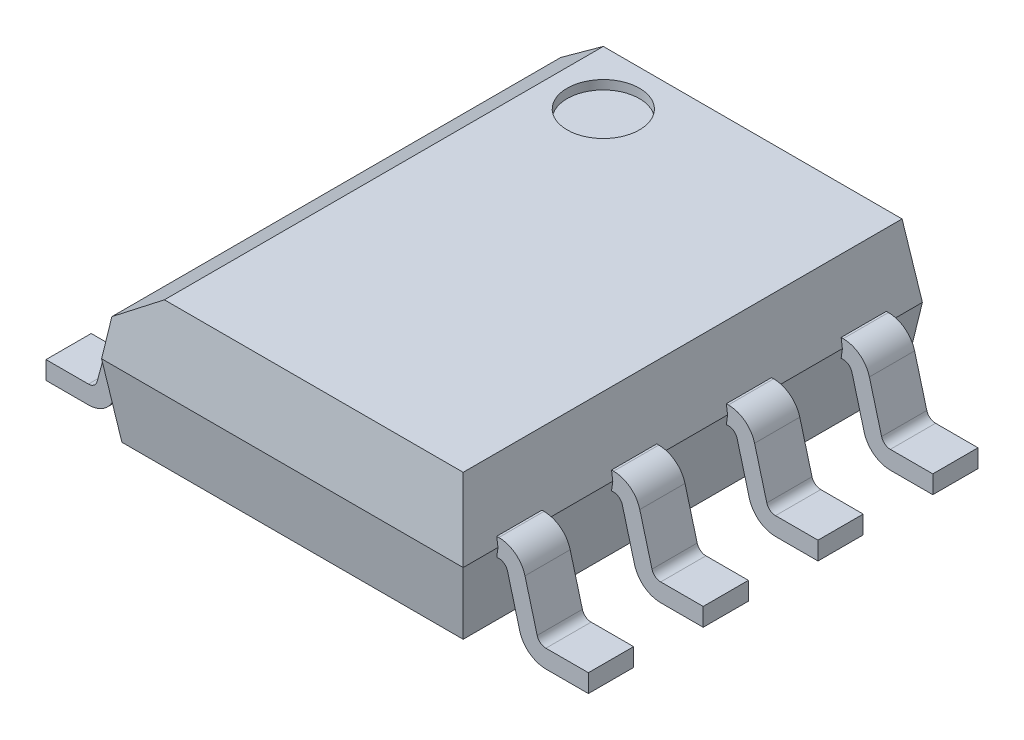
ISO-10303-21;
HEADER;
FILE_DESCRIPTION(('STEP AP214'),'2;1');
FILE_NAME('part.step','',(''),(''),'','','');
FILE_SCHEMA(('AUTOMOTIVE_DESIGN { 1 0 10303 214 1 1 1 1 }'));
ENDSEC;
DATA;
#1=APPLICATION_CONTEXT('core data for automotive mechanical design processes');
#2=APPLICATION_PROTOCOL_DEFINITION('international standard','automotive_design',2000,#1);
#3=PRODUCT_CONTEXT('',#1,'mechanical');
#4=PRODUCT('Part','Part','',(#3));
#5=PRODUCT_RELATED_PRODUCT_CATEGORY('part','',(#4));
#6=PRODUCT_DEFINITION_FORMATION('','',#4);
#7=PRODUCT_DEFINITION_CONTEXT('part definition',#1,'design');
#8=PRODUCT_DEFINITION('design','',#6,#7);
#9=PRODUCT_DEFINITION_SHAPE('','',#8);
#10=(LENGTH_UNIT() NAMED_UNIT(*) SI_UNIT(.MILLI.,.METRE.));
#11=(NAMED_UNIT(*) PLANE_ANGLE_UNIT() SI_UNIT($,.RADIAN.));
#12=(NAMED_UNIT(*) SI_UNIT($,.STERADIAN.) SOLID_ANGLE_UNIT());
#13=UNCERTAINTY_MEASURE_WITH_UNIT(LENGTH_MEASURE(1.E-05),#10,'distance_accuracy_value','');
#14=(GEOMETRIC_REPRESENTATION_CONTEXT(3) GLOBAL_UNCERTAINTY_ASSIGNED_CONTEXT((#13)) GLOBAL_UNIT_ASSIGNED_CONTEXT((#10,
#11,#12)) REPRESENTATION_CONTEXT('',''));
#15=CARTESIAN_POINT('',(0.,0.,0.));
#16=DIRECTION('',(0.,0.,1.));
#17=DIRECTION('',(1.,0.,0.));
#18=AXIS2_PLACEMENT_3D('',#15,#16,#17);
#19=CARTESIAN_POINT('',(2.,0.9,2.54));
#20=DIRECTION('',(0.99026806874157,-0.139173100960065,0.));
#21=DIRECTION('',(0.139173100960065,0.99026806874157,0.));
#22=AXIS2_PLACEMENT_3D('',#19,#20,#21);
#23=PLANE('',#22);
#24=DIRECTION('',(0.,0.,1.));
#25=VECTOR('',#24,1.);
#26=CARTESIAN_POINT('',(1.98594591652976,0.8,2.155));
#27=LINE('',#26,#25);
#28=CARTESIAN_POINT('',(1.98594591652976,0.799999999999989,1.655));
#29=VERTEX_POINT('',#28);
#30=CARTESIAN_POINT('',(1.98594591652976,0.8,2.155));
#31=VERTEX_POINT('',#30);
#32=EDGE_CURVE('E869',#29,#31,#27,.T.);
#33=ORIENTED_EDGE('',*,*,#32,.T.);
#34=DIRECTION('',(-0.139173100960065,-0.99026806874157,0.));
#35=VECTOR('',#34,1.);
#36=CARTESIAN_POINT('',(1.82956269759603,-0.312724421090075,2.155));
#37=LINE('',#36,#35);
#38=CARTESIAN_POINT('',(2.,0.9,2.155));
#39=VERTEX_POINT('',#38);
#40=EDGE_CURVE('E729',#39,#31,#37,.T.);
#41=ORIENTED_EDGE('',*,*,#40,.F.);
#42=DIRECTION('',(0.,0.,-1.));
#43=VECTOR('',#42,1.);
#44=CARTESIAN_POINT('',(2.,0.9,2.54));
#45=LINE('',#44,#43);
#46=CARTESIAN_POINT('',(2.,0.9,2.54));
#47=VERTEX_POINT('',#46);
#48=EDGE_CURVE('E724',#47,#39,#45,.T.);
#49=ORIENTED_EDGE('',*,*,#48,.F.);
#50=DIRECTION('',(0.137844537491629,0.980814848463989,0.137844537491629));
#51=VECTOR('',#50,1.);
#52=CARTESIAN_POINT('',(2.,0.9,2.54));
#53=LINE('',#52,#51);
#54=CARTESIAN_POINT('',(1.88756733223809,0.0999999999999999,2.42756733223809));
#55=VERTEX_POINT('',#54);
#56=EDGE_CURVE('E1607',#55,#47,#53,.T.);
#57=ORIENTED_EDGE('',*,*,#56,.F.);
#58=DIRECTION('',(0.,0.,-1.));
#59=VECTOR('',#58,1.);
#60=CARTESIAN_POINT('',(1.88756733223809,0.0999999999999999,-2.54));
#61=LINE('',#60,#59);
#62=CARTESIAN_POINT('',(1.88756733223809,0.0999999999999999,-2.42756733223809));
#63=VERTEX_POINT('',#62);
#64=EDGE_CURVE('E1621',#55,#63,#61,.T.);
#65=ORIENTED_EDGE('',*,*,#64,.T.);
#66=DIRECTION('',(0.137844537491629,0.980814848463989,-0.137844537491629));
#67=VECTOR('',#66,1.);
#68=CARTESIAN_POINT('',(1.90347432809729,0.213184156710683,-2.44347432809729));
#69=LINE('',#68,#67);
#70=CARTESIAN_POINT('',(2.,0.9,-2.54));
#71=VERTEX_POINT('',#70);
#72=EDGE_CURVE('E1602',#63,#71,#69,.T.);
#73=ORIENTED_EDGE('',*,*,#72,.T.);
#74=CARTESIAN_POINT('',(2.,0.9,-2.155));
#75=VERTEX_POINT('',#74);
#76=EDGE_CURVE('E1588',#75,#71,#45,.T.);
#77=ORIENTED_EDGE('',*,*,#76,.F.);
#78=DIRECTION('',(-0.139173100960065,-0.99026806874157,0.));
#79=VECTOR('',#78,1.);
#80=CARTESIAN_POINT('',(1.82956269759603,-0.312724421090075,-2.155));
#81=LINE('',#80,#79);
#82=CARTESIAN_POINT('',(1.98594591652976,0.8,-2.155));
#83=VERTEX_POINT('',#82);
#84=EDGE_CURVE('E1875',#75,#83,#81,.T.);
#85=ORIENTED_EDGE('',*,*,#84,.T.);
#86=DIRECTION('',(0.,0.,1.));
#87=VECTOR('',#86,1.);
#88=CARTESIAN_POINT('',(1.98594591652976,0.8,-1.655));
#89=LINE('',#88,#87);
#90=CARTESIAN_POINT('',(1.98594591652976,0.8,-1.655));
#91=VERTEX_POINT('',#90);
#92=EDGE_CURVE('E1639',#83,#91,#89,.T.);
#93=ORIENTED_EDGE('',*,*,#92,.T.);
#94=DIRECTION('',(-0.139173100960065,-0.99026806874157,0.));
#95=VECTOR('',#94,1.);
#96=CARTESIAN_POINT('',(1.82956269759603,-0.312724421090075,-1.655));
#97=LINE('',#96,#95);
#98=CARTESIAN_POINT('',(2.,0.9,-1.655));
#99=VERTEX_POINT('',#98);
#100=EDGE_CURVE('E1642',#99,#91,#97,.T.);
#101=ORIENTED_EDGE('',*,*,#100,.F.);
#102=CARTESIAN_POINT('',(2.,0.9,-0.884999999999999));
#103=VERTEX_POINT('',#102);
#104=EDGE_CURVE('E1896',#103,#99,#45,.T.);
#105=ORIENTED_EDGE('',*,*,#104,.F.);
#106=DIRECTION('',(-0.139173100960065,-0.99026806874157,0.));
#107=VECTOR('',#106,1.);
#108=CARTESIAN_POINT('',(1.82956269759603,-0.312724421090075,-0.885));
#109=LINE('',#108,#107);
#110=CARTESIAN_POINT('',(1.98594591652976,0.799999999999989,-0.884999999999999));
#111=VERTEX_POINT('',#110);
#112=EDGE_CURVE('E1026',#103,#111,#109,.T.);
#113=ORIENTED_EDGE('',*,*,#112,.T.);
#114=DIRECTION('',(0.,0.,1.));
#115=VECTOR('',#114,1.);
#116=CARTESIAN_POINT('',(1.98594591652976,0.8,-0.385));
#117=LINE('',#116,#115);
#118=CARTESIAN_POINT('',(1.98594591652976,0.8,-0.385));
#119=VERTEX_POINT('',#118);
#120=EDGE_CURVE('E1148',#111,#119,#117,.T.);
#121=ORIENTED_EDGE('',*,*,#120,.T.);
#122=DIRECTION('',(-0.139173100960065,-0.99026806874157,0.));
#123=VECTOR('',#122,1.);
#124=CARTESIAN_POINT('',(1.82956269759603,-0.312724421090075,-0.385));
#125=LINE('',#124,#123);
#126=CARTESIAN_POINT('',(2.,0.9,-0.385));
#127=VERTEX_POINT('',#126);
#128=EDGE_CURVE('E1078',#127,#119,#125,.T.);
#129=ORIENTED_EDGE('',*,*,#128,.F.);
#130=CARTESIAN_POINT('',(2.,0.9,0.385));
#131=VERTEX_POINT('',#130);
#132=EDGE_CURVE('E1904',#131,#127,#45,.T.);
#133=ORIENTED_EDGE('',*,*,#132,.F.);
#134=DIRECTION('',(-0.139173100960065,-0.99026806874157,0.));
#135=VECTOR('',#134,1.);
#136=CARTESIAN_POINT('',(1.82956269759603,-0.312724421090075,0.385));
#137=LINE('',#136,#135);
#138=CARTESIAN_POINT('',(1.98594591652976,0.799999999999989,0.385));
#139=VERTEX_POINT('',#138);
#140=EDGE_CURVE('E886',#131,#139,#137,.T.);
#141=ORIENTED_EDGE('',*,*,#140,.T.);
#142=DIRECTION('',(0.,0.,1.));
#143=VECTOR('',#142,1.);
#144=CARTESIAN_POINT('',(1.98594591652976,0.8,0.885));
#145=LINE('',#144,#143);
#146=CARTESIAN_POINT('',(1.98594591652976,0.8,0.885000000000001));
#147=VERTEX_POINT('',#146);
#148=EDGE_CURVE('E1009',#139,#147,#145,.T.);
#149=ORIENTED_EDGE('',*,*,#148,.T.);
#150=DIRECTION('',(-0.139173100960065,-0.99026806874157,0.));
#151=VECTOR('',#150,1.);
#152=CARTESIAN_POINT('',(1.82956269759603,-0.312724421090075,0.885));
#153=LINE('',#152,#151);
#154=CARTESIAN_POINT('',(2.,0.9,0.885));
#155=VERTEX_POINT('',#154);
#156=EDGE_CURVE('E939',#155,#147,#153,.T.);
#157=ORIENTED_EDGE('',*,*,#156,.F.);
#158=CARTESIAN_POINT('',(2.,0.9,1.655));
#159=VERTEX_POINT('',#158);
#160=EDGE_CURVE('E1592',#159,#155,#45,.T.);
#161=ORIENTED_EDGE('',*,*,#160,.F.);
#162=DIRECTION('',(-0.139173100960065,-0.99026806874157,0.));
#163=VECTOR('',#162,1.);
#164=CARTESIAN_POINT('',(1.82956269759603,-0.312724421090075,1.655));
#165=LINE('',#164,#163);
#166=EDGE_CURVE('E757',#159,#29,#165,.T.);
#167=ORIENTED_EDGE('',*,*,#166,.T.);
#168=EDGE_LOOP('',(#33,#41,#49,#57,#65,#73,#77,#85,#93,#101,#105,#113,#121,#129,#133,#141,#149,
#157,#161,#167));
#169=FACE_BOUND('',#168,.T.);
#170=ADVANCED_FACE('F35',(#169),#23,.T.);
#171=CARTESIAN_POINT('',(2.,0.9,2.54));
#172=DIRECTION('',(0.99026806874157,0.139173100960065,0.));
#173=DIRECTION('',(-0.139173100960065,0.99026806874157,0.));
#174=AXIS2_PLACEMENT_3D('',#171,#172,#173);
#175=PLANE('',#174);
#176=DIRECTION('',(0.139173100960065,-0.99026806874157,0.));
#177=VECTOR('',#176,1.);
#178=CARTESIAN_POINT('',(1.99494511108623,0.935967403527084,2.155));
#179=LINE('',#178,#177);
#180=CARTESIAN_POINT('',(1.98594591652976,1.,2.155));
#181=VERTEX_POINT('',#180);
#182=EDGE_CURVE('E717',#39,#181,#179,.F.);
#183=ORIENTED_EDGE('',*,*,#182,.T.);
#184=DIRECTION('',(0.,0.,1.));
#185=VECTOR('',#184,1.);
#186=CARTESIAN_POINT('',(1.98594591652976,1.,2.155));
#187=LINE('',#186,#185);
#188=CARTESIAN_POINT('',(1.98594591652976,1.,1.655));
#189=VERTEX_POINT('',#188);
#190=EDGE_CURVE('E720',#181,#189,#187,.F.);
#191=ORIENTED_EDGE('',*,*,#190,.T.);
#192=DIRECTION('',(0.139173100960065,-0.99026806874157,0.));
#193=VECTOR('',#192,1.);
#194=CARTESIAN_POINT('',(1.99494511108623,0.935967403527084,1.655));
#195=LINE('',#194,#193);
#196=EDGE_CURVE('E760',#159,#189,#195,.F.);
#197=ORIENTED_EDGE('',*,*,#196,.F.);
#198=ORIENTED_EDGE('',*,*,#160,.T.);
#199=DIRECTION('',(0.139173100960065,-0.99026806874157,0.));
#200=VECTOR('',#199,1.);
#201=CARTESIAN_POINT('',(1.99494511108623,0.935967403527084,0.885));
#202=LINE('',#201,#200);
#203=CARTESIAN_POINT('',(1.98594591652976,1.,0.885));
#204=VERTEX_POINT('',#203);
#205=EDGE_CURVE('E936',#155,#204,#202,.F.);
#206=ORIENTED_EDGE('',*,*,#205,.T.);
#207=DIRECTION('',(0.,0.,1.));
#208=VECTOR('',#207,1.);
#209=CARTESIAN_POINT('',(1.98594591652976,1.,0.885));
#210=LINE('',#209,#208);
#211=CARTESIAN_POINT('',(1.98594591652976,1.,0.385));
#212=VERTEX_POINT('',#211);
#213=EDGE_CURVE('E872',#204,#212,#210,.F.);
#214=ORIENTED_EDGE('',*,*,#213,.T.);
#215=DIRECTION('',(0.139173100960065,-0.99026806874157,0.));
#216=VECTOR('',#215,1.);
#217=CARTESIAN_POINT('',(1.99494511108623,0.935967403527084,0.385));
#218=LINE('',#217,#216);
#219=EDGE_CURVE('E889',#131,#212,#218,.F.);
#220=ORIENTED_EDGE('',*,*,#219,.F.);
#221=ORIENTED_EDGE('',*,*,#132,.T.);
#222=DIRECTION('',(0.139173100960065,-0.99026806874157,0.));
#223=VECTOR('',#222,1.);
#224=CARTESIAN_POINT('',(1.99494511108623,0.935967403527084,-0.385));
#225=LINE('',#224,#223);
#226=CARTESIAN_POINT('',(1.98594591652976,1.,-0.385));
#227=VERTEX_POINT('',#226);
#228=EDGE_CURVE('E1075',#127,#227,#225,.F.);
#229=ORIENTED_EDGE('',*,*,#228,.T.);
#230=DIRECTION('',(0.,0.,1.));
#231=VECTOR('',#230,1.);
#232=CARTESIAN_POINT('',(1.98594591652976,1.,-0.385));
#233=LINE('',#232,#231);
#234=CARTESIAN_POINT('',(1.98594591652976,1.,-0.884999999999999));
#235=VERTEX_POINT('',#234);
#236=EDGE_CURVE('E1012',#227,#235,#233,.F.);
#237=ORIENTED_EDGE('',*,*,#236,.T.);
#238=DIRECTION('',(0.139173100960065,-0.99026806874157,0.));
#239=VECTOR('',#238,1.);
#240=CARTESIAN_POINT('',(1.99494511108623,0.935967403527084,-0.885));
#241=LINE('',#240,#239);
#242=EDGE_CURVE('E1028',#103,#235,#241,.F.);
#243=ORIENTED_EDGE('',*,*,#242,.F.);
#244=ORIENTED_EDGE('',*,*,#104,.T.);
#245=DIRECTION('',(0.139173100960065,-0.99026806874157,0.));
#246=VECTOR('',#245,1.);
#247=CARTESIAN_POINT('',(1.99494511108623,0.935967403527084,-1.655));
#248=LINE('',#247,#246);
#249=CARTESIAN_POINT('',(1.98594591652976,1.,-1.655));
#250=VERTEX_POINT('',#249);
#251=EDGE_CURVE('E1630',#99,#250,#248,.F.);
#252=ORIENTED_EDGE('',*,*,#251,.T.);
#253=DIRECTION('',(0.,0.,1.));
#254=VECTOR('',#253,1.);
#255=CARTESIAN_POINT('',(1.98594591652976,1.,-1.655));
#256=LINE('',#255,#254);
#257=CARTESIAN_POINT('',(1.98594591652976,1.,-2.155));
#258=VERTEX_POINT('',#257);
#259=EDGE_CURVE('E1601',#250,#258,#256,.F.);
#260=ORIENTED_EDGE('',*,*,#259,.T.);
#261=DIRECTION('',(0.139173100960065,-0.99026806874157,0.));
#262=VECTOR('',#261,1.);
#263=CARTESIAN_POINT('',(1.99494511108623,0.935967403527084,-2.155));
#264=LINE('',#263,#262);
#265=EDGE_CURVE('E1871',#75,#258,#264,.F.);
#266=ORIENTED_EDGE('',*,*,#265,.F.);
#267=ORIENTED_EDGE('',*,*,#76,.T.);
#268=DIRECTION('',(0.137844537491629,-0.980814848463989,-0.137844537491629));
#269=VECTOR('',#268,1.);
#270=CARTESIAN_POINT('',(2.,0.9,-2.54));
#271=LINE('',#270,#269);
#272=CARTESIAN_POINT('',(1.88756733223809,1.7,-2.42756733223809));
#273=VERTEX_POINT('',#272);
#274=EDGE_CURVE('E1565',#273,#71,#271,.T.);
#275=ORIENTED_EDGE('',*,*,#274,.F.);
#276=DIRECTION('',(0.,0.,1.));
#277=VECTOR('',#276,1.);
#278=CARTESIAN_POINT('',(1.88756733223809,1.7,2.54));
#279=LINE('',#278,#277);
#280=CARTESIAN_POINT('',(1.88756733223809,1.7,2.42756733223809));
#281=VERTEX_POINT('',#280);
#282=EDGE_CURVE('E1574',#281,#273,#279,.F.);
#283=ORIENTED_EDGE('',*,*,#282,.F.);
#284=DIRECTION('',(0.137844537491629,-0.980814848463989,0.137844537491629));
#285=VECTOR('',#284,1.);
#286=CARTESIAN_POINT('',(2.,0.9,2.54));
#287=LINE('',#286,#285);
#288=EDGE_CURVE('E1561',#281,#47,#287,.T.);
#289=ORIENTED_EDGE('',*,*,#288,.T.);
#290=ORIENTED_EDGE('',*,*,#48,.T.);
#291=EDGE_LOOP('',(#183,#191,#197,#198,#206,#214,#220,#221,#229,#237,#243,#244,#252,#260,#266,
#267,#275,#283,#289,#290));
#292=FACE_BOUND('',#291,.T.);
#293=ADVANCED_FACE('F719',(#292),#175,.T.);
#294=CARTESIAN_POINT('',(-2.00890794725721,0.8,-1.655));
#295=DIRECTION('',(0.,-1.,0.));
#296=DIRECTION('',(1.,0.,0.));
#297=AXIS2_PLACEMENT_3D('',#294,#295,#296);
#298=PLANE('',#297);
#299=DIRECTION('',(0.,0.,-1.));
#300=VECTOR('',#299,1.);
#301=CARTESIAN_POINT('',(-1.98594591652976,0.8,-1.655));
#302=LINE('',#301,#300);
#303=CARTESIAN_POINT('',(-1.98594591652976,0.8,-1.655));
#304=VERTEX_POINT('',#303);
#305=CARTESIAN_POINT('',(-1.98594591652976,0.8,-2.155));
#306=VERTEX_POINT('',#305);
#307=EDGE_CURVE('E1646',#304,#306,#302,.T.);
#308=ORIENTED_EDGE('',*,*,#307,.F.);
#309=DIRECTION('',(-1.,0.,0.));
#310=VECTOR('',#309,1.);
#311=CARTESIAN_POINT('',(-2.00890794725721,0.8,-1.655));
#312=LINE('',#311,#310);
#313=CARTESIAN_POINT('',(-2.00890794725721,0.8,-1.655));
#314=VERTEX_POINT('',#313);
#315=EDGE_CURVE('E1678',#304,#314,#312,.T.);
#316=ORIENTED_EDGE('',*,*,#315,.T.);
#317=DIRECTION('',(0.,0.,-1.));
#318=VECTOR('',#317,1.);
#319=CARTESIAN_POINT('',(-2.00890794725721,0.8,-1.655));
#320=LINE('',#319,#318);
#321=CARTESIAN_POINT('',(-2.00890794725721,0.8,-2.155));
#322=VERTEX_POINT('',#321);
#323=EDGE_CURVE('E1852',#314,#322,#320,.T.);
#324=ORIENTED_EDGE('',*,*,#323,.T.);
#325=DIRECTION('',(-1.,0.,0.));
#326=VECTOR('',#325,1.);
#327=CARTESIAN_POINT('',(-2.00890794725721,0.8,-2.155));
#328=LINE('',#327,#326);
#329=EDGE_CURVE('E1753',#306,#322,#328,.T.);
#330=ORIENTED_EDGE('',*,*,#329,.F.);
#331=EDGE_LOOP('',(#308,#316,#324,#330));
#332=FACE_BOUND('',#331,.T.);
#333=ADVANCED_FACE('F1916',(#332),#298,.T.);
#334=CARTESIAN_POINT('',(-2.00890794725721,1.,-1.655));
#335=DIRECTION('',(0.,-1.,0.));
#336=DIRECTION('',(1.,0.,0.));
#337=AXIS2_PLACEMENT_3D('',#334,#335,#336);
#338=PLANE('',#337);
#339=DIRECTION('',(0.,0.,-1.));
#340=VECTOR('',#339,1.);
#341=CARTESIAN_POINT('',(-1.98594591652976,1.,-1.655));
#342=LINE('',#341,#340);
#343=CARTESIAN_POINT('',(-1.98594591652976,1.,-2.155));
#344=VERTEX_POINT('',#343);
#345=CARTESIAN_POINT('',(-1.98594591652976,1.,-1.655));
#346=VERTEX_POINT('',#345);
#347=EDGE_CURVE('E1633',#344,#346,#342,.F.);
#348=ORIENTED_EDGE('',*,*,#347,.F.);
#349=DIRECTION('',(-1.,0.,0.));
#350=VECTOR('',#349,1.);
#351=CARTESIAN_POINT('',(-2.00890794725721,1.,-2.155));
#352=LINE('',#351,#350);
#353=CARTESIAN_POINT('',(-2.00890794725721,1.,-2.155));
#354=VERTEX_POINT('',#353);
#355=EDGE_CURVE('E1790',#344,#354,#352,.T.);
#356=ORIENTED_EDGE('',*,*,#355,.T.);
#357=DIRECTION('',(0.,0.,-1.));
#358=VECTOR('',#357,1.);
#359=CARTESIAN_POINT('',(-2.00890794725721,1.,-1.655));
#360=LINE('',#359,#358);
#361=CARTESIAN_POINT('',(-2.00890794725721,1.,-1.655));
#362=VERTEX_POINT('',#361);
#363=EDGE_CURVE('E1814',#362,#354,#360,.T.);
#364=ORIENTED_EDGE('',*,*,#363,.F.);
#365=DIRECTION('',(-1.,0.,0.));
#366=VECTOR('',#365,1.);
#367=CARTESIAN_POINT('',(-2.00890794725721,1.,-1.655));
#368=LINE('',#367,#366);
#369=EDGE_CURVE('E1715',#346,#362,#368,.T.);
#370=ORIENTED_EDGE('',*,*,#369,.F.);
#371=EDGE_LOOP('',(#348,#356,#364,#370));
#372=FACE_BOUND('',#371,.T.);
#373=ADVANCED_FACE('F1944',(#372),#338,.F.);
#374=CARTESIAN_POINT('',(-2.53019809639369,0.3,-1.655));
#375=DIRECTION('',(0.,0.,-1.));
#376=DIRECTION('',(-1.,0.,0.));
#377=AXIS2_PLACEMENT_3D('',#374,#375,#376);
#378=PLANE('',#377);
#379=ORIENTED_EDGE('',*,*,#315,.F.);
#380=DIRECTION('',(-0.139173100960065,0.99026806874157,0.));
#381=VECTOR('',#380,1.);
#382=CARTESIAN_POINT('',(-1.92757828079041,0.384692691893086,-1.655));
#383=LINE('',#382,#381);
#384=CARTESIAN_POINT('',(-2.,0.9,-1.655));
#385=VERTEX_POINT('',#384);
#386=EDGE_CURVE('E1649',#304,#385,#383,.T.);
#387=ORIENTED_EDGE('',*,*,#386,.T.);
#388=DIRECTION('',(0.139173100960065,0.99026806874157,0.));
#389=VECTOR('',#388,1.);
#390=CARTESIAN_POINT('',(-2.09296069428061,0.238550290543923,-1.655));
#391=LINE('',#390,#389);
#392=EDGE_CURVE('E1636',#346,#385,#391,.F.);
#393=ORIENTED_EDGE('',*,*,#392,.F.);
#394=ORIENTED_EDGE('',*,*,#369,.T.);
#395=CARTESIAN_POINT('',(-2.00890794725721,0.7,-1.655));
#396=DIRECTION('',(0.,0.,1.));
#397=DIRECTION('',(1.,0.,0.));
#398=AXIS2_PLACEMENT_3D('',#395,#396,#397);
#399=CIRCLE('',#398,0.3);
#400=CARTESIAN_POINT('',(-2.29868569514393,0.777645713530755,-1.655));
#401=VERTEX_POINT('',#400);
#402=EDGE_CURVE('E1720',#362,#401,#399,.T.);
#403=ORIENTED_EDGE('',*,*,#402,.T.);
#404=DIRECTION('',(-0.258819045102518,-0.965925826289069,0.));
#405=VECTOR('',#404,1.);
#406=CARTESIAN_POINT('',(-2.43360551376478,0.274118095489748,-1.655));
#407=LINE('',#406,#405);
#408=CARTESIAN_POINT('',(-2.43360551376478,0.274118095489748,-1.655));
#409=VERTEX_POINT('',#408);
#410=EDGE_CURVE('E1723',#401,#409,#407,.T.);
#411=ORIENTED_EDGE('',*,*,#410,.T.);
#412=CARTESIAN_POINT('',(-2.53019809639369,0.3,-1.655));
#413=DIRECTION('',(0.,0.,1.));
#414=DIRECTION('',(1.,0.,0.));
#415=AXIS2_PLACEMENT_3D('',#412,#413,#414);
#416=CIRCLE('',#415,0.0999999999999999);
#417=CARTESIAN_POINT('',(-2.53019809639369,0.2,-1.655));
#418=VERTEX_POINT('',#417);
#419=EDGE_CURVE('E1726',#409,#418,#416,.F.);
#420=ORIENTED_EDGE('',*,*,#419,.T.);
#421=DIRECTION('',(1.,0.,0.));
#422=VECTOR('',#421,1.);
#423=CARTESIAN_POINT('',(-3.,0.2,-1.655));
#424=LINE('',#423,#422);
#425=CARTESIAN_POINT('',(-3.,0.2,-1.655));
#426=VERTEX_POINT('',#425);
#427=EDGE_CURVE('E1654',#418,#426,#424,.F.);
#428=ORIENTED_EDGE('',*,*,#427,.T.);
#429=DIRECTION('',(0.,1.,0.));
#430=VECTOR('',#429,1.);
#431=CARTESIAN_POINT('',(-3.,0.,-1.655));
#432=LINE('',#431,#430);
#433=CARTESIAN_POINT('',(-3.,0.,-1.655));
#434=VERTEX_POINT('',#433);
#435=EDGE_CURVE('E1657',#434,#426,#432,.T.);
#436=ORIENTED_EDGE('',*,*,#435,.F.);
#437=DIRECTION('',(-1.,0.,0.));
#438=VECTOR('',#437,1.);
#439=CARTESIAN_POINT('',(-3.,0.,-1.655));
#440=LINE('',#439,#438);
#441=CARTESIAN_POINT('',(-2.53019809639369,0.,-1.655));
#442=VERTEX_POINT('',#441);
#443=EDGE_CURVE('E1662',#442,#434,#440,.T.);
#444=ORIENTED_EDGE('',*,*,#443,.F.);
#445=CARTESIAN_POINT('',(-2.53019809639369,0.3,-1.655));
#446=DIRECTION('',(0.,0.,-1.));
#447=DIRECTION('',(1.,0.,0.));
#448=AXIS2_PLACEMENT_3D('',#445,#446,#447);
#449=CIRCLE('',#448,0.3);
#450=CARTESIAN_POINT('',(-2.24042034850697,0.222354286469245,-1.655));
#451=VERTEX_POINT('',#450);
#452=EDGE_CURVE('E1666',#451,#442,#449,.T.);
#453=ORIENTED_EDGE('',*,*,#452,.F.);
#454=DIRECTION('',(-0.258819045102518,-0.965925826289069,0.));
#455=VECTOR('',#454,1.);
#456=CARTESIAN_POINT('',(-2.24042034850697,0.222354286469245,-1.655));
#457=LINE('',#456,#455);
#458=CARTESIAN_POINT('',(-2.10550052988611,0.725881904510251,-1.655));
#459=VERTEX_POINT('',#458);
#460=EDGE_CURVE('E1670',#459,#451,#457,.T.);
#461=ORIENTED_EDGE('',*,*,#460,.F.);
#462=CARTESIAN_POINT('',(-2.00890794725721,0.7,-1.655));
#463=DIRECTION('',(0.,0.,1.));
#464=DIRECTION('',(-1.,0.,0.));
#465=AXIS2_PLACEMENT_3D('',#462,#463,#464);
#466=CIRCLE('',#465,0.0999999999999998);
#467=EDGE_CURVE('E1674',#314,#459,#466,.T.);
#468=ORIENTED_EDGE('',*,*,#467,.F.);
#469=EDGE_LOOP('',(#379,#387,#393,#394,#403,#411,#420,#428,#436,#444,#453,#461,#468));
#470=FACE_BOUND('',#469,.T.);
#471=ADVANCED_FACE('F1924',(#470),#378,.F.);
#472=CARTESIAN_POINT('',(-2.53019809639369,0.3,-2.155));
#473=DIRECTION('',(0.,0.,-1.));
#474=DIRECTION('',(-1.,0.,0.));
#475=AXIS2_PLACEMENT_3D('',#472,#473,#474);
#476=PLANE('',#475);
#477=DIRECTION('',(-0.139173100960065,0.99026806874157,0.));
#478=VECTOR('',#477,1.);
#479=CARTESIAN_POINT('',(-1.92757828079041,0.384692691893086,-2.155));
#480=LINE('',#479,#478);
#481=CARTESIAN_POINT('',(-2.,0.9,-2.155));
#482=VERTEX_POINT('',#481);
#483=EDGE_CURVE('E1882',#306,#482,#480,.T.);
#484=ORIENTED_EDGE('',*,*,#483,.F.);
#485=ORIENTED_EDGE('',*,*,#329,.T.);
#486=CARTESIAN_POINT('',(-2.00890794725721,0.7,-2.155));
#487=DIRECTION('',(0.,0.,1.));
#488=DIRECTION('',(-1.,0.,0.));
#489=AXIS2_PLACEMENT_3D('',#486,#487,#488);
#490=CIRCLE('',#489,0.0999999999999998);
#491=CARTESIAN_POINT('',(-2.10550052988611,0.725881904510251,-2.155));
#492=VERTEX_POINT('',#491);
#493=EDGE_CURVE('E1749',#322,#492,#490,.T.);
#494=ORIENTED_EDGE('',*,*,#493,.T.);
#495=DIRECTION('',(-0.258819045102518,-0.965925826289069,0.));
#496=VECTOR('',#495,1.);
#497=CARTESIAN_POINT('',(-2.24042034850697,0.222354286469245,-2.155));
#498=LINE('',#497,#496);
#499=CARTESIAN_POINT('',(-2.24042034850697,0.222354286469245,-2.155));
#500=VERTEX_POINT('',#499);
#501=EDGE_CURVE('E1745',#492,#500,#498,.T.);
#502=ORIENTED_EDGE('',*,*,#501,.T.);
#503=CARTESIAN_POINT('',(-2.53019809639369,0.3,-2.155));
#504=DIRECTION('',(0.,0.,-1.));
#505=DIRECTION('',(1.,0.,0.));
#506=AXIS2_PLACEMENT_3D('',#503,#504,#505);
#507=CIRCLE('',#506,0.3);
#508=CARTESIAN_POINT('',(-2.53019809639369,0.,-2.155));
#509=VERTEX_POINT('',#508);
#510=EDGE_CURVE('E1741',#500,#509,#507,.T.);
#511=ORIENTED_EDGE('',*,*,#510,.T.);
#512=DIRECTION('',(-1.,0.,0.));
#513=VECTOR('',#512,1.);
#514=CARTESIAN_POINT('',(-3.,0.,-2.155));
#515=LINE('',#514,#513);
#516=CARTESIAN_POINT('',(-3.,0.,-2.155));
#517=VERTEX_POINT('',#516);
#518=EDGE_CURVE('E1737',#509,#517,#515,.T.);
#519=ORIENTED_EDGE('',*,*,#518,.T.);
#520=DIRECTION('',(0.,1.,0.));
#521=VECTOR('',#520,1.);
#522=CARTESIAN_POINT('',(-3.,0.,-2.155));
#523=LINE('',#522,#521);
#524=CARTESIAN_POINT('',(-3.,0.2,-2.155));
#525=VERTEX_POINT('',#524);
#526=EDGE_CURVE('E1733',#517,#525,#523,.T.);
#527=ORIENTED_EDGE('',*,*,#526,.T.);
#528=DIRECTION('',(1.,0.,0.));
#529=VECTOR('',#528,1.);
#530=CARTESIAN_POINT('',(-3.,0.2,-2.155));
#531=LINE('',#530,#529);
#532=CARTESIAN_POINT('',(-2.53019809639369,0.2,-2.155));
#533=VERTEX_POINT('',#532);
#534=EDGE_CURVE('E1653',#533,#525,#531,.F.);
#535=ORIENTED_EDGE('',*,*,#534,.F.);
#536=CARTESIAN_POINT('',(-2.53019809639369,0.3,-2.155));
#537=DIRECTION('',(0.,0.,1.));
#538=DIRECTION('',(1.,0.,0.));
#539=AXIS2_PLACEMENT_3D('',#536,#537,#538);
#540=CIRCLE('',#539,0.0999999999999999);
#541=CARTESIAN_POINT('',(-2.43360551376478,0.274118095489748,-2.155));
#542=VERTEX_POINT('',#541);
#543=EDGE_CURVE('E1658',#542,#533,#540,.F.);
#544=ORIENTED_EDGE('',*,*,#543,.F.);
#545=DIRECTION('',(-0.258819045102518,-0.965925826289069,0.));
#546=VECTOR('',#545,1.);
#547=CARTESIAN_POINT('',(-2.43360551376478,0.274118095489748,-2.155));
#548=LINE('',#547,#546);
#549=CARTESIAN_POINT('',(-2.29868569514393,0.777645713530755,-2.155));
#550=VERTEX_POINT('',#549);
#551=EDGE_CURVE('E1798',#550,#542,#548,.T.);
#552=ORIENTED_EDGE('',*,*,#551,.F.);
#553=CARTESIAN_POINT('',(-2.00890794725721,0.7,-2.155));
#554=DIRECTION('',(0.,0.,1.));
#555=DIRECTION('',(1.,0.,0.));
#556=AXIS2_PLACEMENT_3D('',#553,#554,#555);
#557=CIRCLE('',#556,0.3);
#558=EDGE_CURVE('E1795',#354,#550,#557,.T.);
#559=ORIENTED_EDGE('',*,*,#558,.F.);
#560=ORIENTED_EDGE('',*,*,#355,.F.);
#561=DIRECTION('',(0.139173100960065,0.99026806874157,0.));
#562=VECTOR('',#561,1.);
#563=CARTESIAN_POINT('',(-2.09296069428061,0.238550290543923,-2.155));
#564=LINE('',#563,#562);
#565=EDGE_CURVE('E1878',#344,#482,#564,.F.);
#566=ORIENTED_EDGE('',*,*,#565,.T.);
#567=EDGE_LOOP('',(#484,#485,#494,#502,#511,#519,#527,#535,#544,#552,#559,#560,#566));
#568=FACE_BOUND('',#567,.T.);
#569=ADVANCED_FACE('F1933',(#568),#476,.T.);
#570=CARTESIAN_POINT('',(-3.,0.2,-1.655));
#571=DIRECTION('',(0.,-1.,0.));
#572=DIRECTION('',(0.,0.,-1.));
#573=AXIS2_PLACEMENT_3D('',#570,#571,#572);
#574=PLANE('',#573);
#575=ORIENTED_EDGE('',*,*,#534,.T.);
#576=DIRECTION('',(0.,0.,-1.));
#577=VECTOR('',#576,1.);
#578=CARTESIAN_POINT('',(-3.,0.2,-1.655));
#579=LINE('',#578,#577);
#580=EDGE_CURVE('E1868',#426,#525,#579,.T.);
#581=ORIENTED_EDGE('',*,*,#580,.F.);
#582=ORIENTED_EDGE('',*,*,#427,.F.);
#583=DIRECTION('',(0.,0.,-1.));
#584=VECTOR('',#583,1.);
#585=CARTESIAN_POINT('',(-2.53019809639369,0.2,-1.655));
#586=LINE('',#585,#584);
#587=EDGE_CURVE('E1729',#418,#533,#586,.T.);
#588=ORIENTED_EDGE('',*,*,#587,.T.);
#589=EDGE_LOOP('',(#575,#581,#582,#588));
#590=FACE_BOUND('',#589,.T.);
#591=ADVANCED_FACE('F1967',(#590),#574,.F.);
#592=CARTESIAN_POINT('',(-3.,0.,-1.655));
#593=DIRECTION('',(-1.,0.,0.));
#594=DIRECTION('',(0.,0.,1.));
#595=AXIS2_PLACEMENT_3D('',#592,#593,#594);
#596=PLANE('',#595);
#597=ORIENTED_EDGE('',*,*,#526,.F.);
#598=DIRECTION('',(0.,0.,-1.));
#599=VECTOR('',#598,1.);
#600=CARTESIAN_POINT('',(-3.,0.,-1.655));
#601=LINE('',#600,#599);
#602=EDGE_CURVE('E1865',#434,#517,#601,.T.);
#603=ORIENTED_EDGE('',*,*,#602,.F.);
#604=ORIENTED_EDGE('',*,*,#435,.T.);
#605=ORIENTED_EDGE('',*,*,#580,.T.);
#606=EDGE_LOOP('',(#597,#603,#604,#605));
#607=FACE_BOUND('',#606,.T.);
#608=ADVANCED_FACE('F1970',(#607),#596,.T.);
#609=CARTESIAN_POINT('',(-3.,0.,-1.655));
#610=DIRECTION('',(0.,-1.,0.));
#611=DIRECTION('',(0.,0.,-1.));
#612=AXIS2_PLACEMENT_3D('',#609,#610,#611);
#613=PLANE('',#612);
#614=ORIENTED_EDGE('',*,*,#518,.F.);
#615=DIRECTION('',(0.,0.,-1.));
#616=VECTOR('',#615,1.);
#617=CARTESIAN_POINT('',(-2.53019809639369,0.,-1.655));
#618=LINE('',#617,#616);
#619=EDGE_CURVE('E1862',#442,#509,#618,.T.);
#620=ORIENTED_EDGE('',*,*,#619,.F.);
#621=ORIENTED_EDGE('',*,*,#443,.T.);
#622=ORIENTED_EDGE('',*,*,#602,.T.);
#623=EDGE_LOOP('',(#614,#620,#621,#622));
#624=FACE_BOUND('',#623,.T.);
#625=ADVANCED_FACE('F1973',(#624),#613,.T.);
#626=CARTESIAN_POINT('',(-2.53019809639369,0.3,-1.655));
#627=DIRECTION('',(0.,0.,-1.));
#628=DIRECTION('',(-1.,0.,0.));
#629=AXIS2_PLACEMENT_3D('',#626,#627,#628);
#630=CYLINDRICAL_SURFACE('',#629,0.3);
#631=ORIENTED_EDGE('',*,*,#510,.F.);
#632=DIRECTION('',(0.,0.,-1.));
#633=VECTOR('',#632,1.);
#634=CARTESIAN_POINT('',(-2.24042034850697,0.222354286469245,-1.655));
#635=LINE('',#634,#633);
#636=EDGE_CURVE('E1859',#451,#500,#635,.T.);
#637=ORIENTED_EDGE('',*,*,#636,.F.);
#638=ORIENTED_EDGE('',*,*,#452,.T.);
#639=ORIENTED_EDGE('',*,*,#619,.T.);
#640=EDGE_LOOP('',(#631,#637,#638,#639));
#641=FACE_BOUND('',#640,.T.);
#642=ADVANCED_FACE('F1975',(#641),#630,.T.);
#643=CARTESIAN_POINT('',(-2.24042034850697,0.222354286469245,-1.655));
#644=DIRECTION('',(0.965925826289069,-0.258819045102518,0.));
#645=DIRECTION('',(0.258819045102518,0.965925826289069,0.));
#646=AXIS2_PLACEMENT_3D('',#643,#644,#645);
#647=PLANE('',#646);
#648=ORIENTED_EDGE('',*,*,#501,.F.);
#649=DIRECTION('',(0.,0.,-1.));
#650=VECTOR('',#649,1.);
#651=CARTESIAN_POINT('',(-2.10550052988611,0.725881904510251,-1.655));
#652=LINE('',#651,#650);
#653=EDGE_CURVE('E1856',#459,#492,#652,.T.);
#654=ORIENTED_EDGE('',*,*,#653,.F.);
#655=ORIENTED_EDGE('',*,*,#460,.T.);
#656=ORIENTED_EDGE('',*,*,#636,.T.);
#657=EDGE_LOOP('',(#648,#654,#655,#656));
#658=FACE_BOUND('',#657,.T.);
#659=ADVANCED_FACE('F1929',(#658),#647,.T.);
#660=CARTESIAN_POINT('',(-2.00890794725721,0.7,-1.655));
#661=DIRECTION('',(0.,0.,-1.));
#662=DIRECTION('',(-1.,0.,0.));
#663=AXIS2_PLACEMENT_3D('',#660,#661,#662);
#664=CYLINDRICAL_SURFACE('',#663,0.0999999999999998);
#665=ORIENTED_EDGE('',*,*,#493,.F.);
#666=ORIENTED_EDGE('',*,*,#323,.F.);
#667=ORIENTED_EDGE('',*,*,#467,.T.);
#668=ORIENTED_EDGE('',*,*,#653,.T.);
#669=EDGE_LOOP('',(#665,#666,#667,#668));
#670=FACE_BOUND('',#669,.T.);
#671=ADVANCED_FACE('F1922',(#670),#664,.F.);
#672=CARTESIAN_POINT('',(-2.00890794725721,0.7,-1.655));
#673=DIRECTION('',(0.,0.,-1.));
#674=DIRECTION('',(-1.,0.,0.));
#675=AXIS2_PLACEMENT_3D('',#672,#673,#674);
#676=CYLINDRICAL_SURFACE('',#675,0.3);
#677=ORIENTED_EDGE('',*,*,#558,.T.);
#678=DIRECTION('',(0.,0.,-1.));
#679=VECTOR('',#678,1.);
#680=CARTESIAN_POINT('',(-2.29868569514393,0.777645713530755,-1.655));
#681=LINE('',#680,#679);
#682=EDGE_CURVE('E1810',#401,#550,#681,.T.);
#683=ORIENTED_EDGE('',*,*,#682,.F.);
#684=ORIENTED_EDGE('',*,*,#402,.F.);
#685=ORIENTED_EDGE('',*,*,#363,.T.);
#686=EDGE_LOOP('',(#677,#683,#684,#685));
#687=FACE_BOUND('',#686,.T.);
#688=ADVANCED_FACE('F1950',(#687),#676,.T.);
#689=CARTESIAN_POINT('',(-2.43360551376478,0.274118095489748,-1.655));
#690=DIRECTION('',(0.965925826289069,-0.258819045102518,0.));
#691=DIRECTION('',(0.258819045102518,0.965925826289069,0.));
#692=AXIS2_PLACEMENT_3D('',#689,#690,#691);
#693=PLANE('',#692);
#694=ORIENTED_EDGE('',*,*,#551,.T.);
#695=DIRECTION('',(0.,0.,-1.));
#696=VECTOR('',#695,1.);
#697=CARTESIAN_POINT('',(-2.43360551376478,0.274118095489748,-1.655));
#698=LINE('',#697,#696);
#699=EDGE_CURVE('E1806',#409,#542,#698,.T.);
#700=ORIENTED_EDGE('',*,*,#699,.F.);
#701=ORIENTED_EDGE('',*,*,#410,.F.);
#702=ORIENTED_EDGE('',*,*,#682,.T.);
#703=EDGE_LOOP('',(#694,#700,#701,#702));
#704=FACE_BOUND('',#703,.T.);
#705=ADVANCED_FACE('F1957',(#704),#693,.F.);
#706=CARTESIAN_POINT('',(-2.53019809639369,0.3,-1.655));
#707=DIRECTION('',(0.,0.,-1.));
#708=DIRECTION('',(-1.,0.,0.));
#709=AXIS2_PLACEMENT_3D('',#706,#707,#708);
#710=CYLINDRICAL_SURFACE('',#709,0.0999999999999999);
#711=ORIENTED_EDGE('',*,*,#543,.T.);
#712=ORIENTED_EDGE('',*,*,#587,.F.);
#713=ORIENTED_EDGE('',*,*,#419,.F.);
#714=ORIENTED_EDGE('',*,*,#699,.T.);
#715=EDGE_LOOP('',(#711,#712,#713,#714));
#716=FACE_BOUND('',#715,.T.);
#717=ADVANCED_FACE('F1961',(#716),#710,.F.);
#718=CARTESIAN_POINT('',(-2.,0.9,2.54));
#719=DIRECTION('',(-0.99026806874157,-0.139173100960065,0.));
#720=DIRECTION('',(0.139173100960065,-0.99026806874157,0.));
#721=AXIS2_PLACEMENT_3D('',#718,#719,#720);
#722=PLANE('',#721);
#723=DIRECTION('',(-0.139173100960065,0.99026806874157,0.));
#724=VECTOR('',#723,1.);
#725=CARTESIAN_POINT('',(-1.92757828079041,0.384692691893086,1.655));
#726=LINE('',#725,#724);
#727=CARTESIAN_POINT('',(-1.98594591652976,0.8,1.655));
#728=VERTEX_POINT('',#727);
#729=CARTESIAN_POINT('',(-2.,0.9,1.655));
#730=VERTEX_POINT('',#729);
#731=EDGE_CURVE('E1216',#728,#730,#726,.T.);
#732=ORIENTED_EDGE('',*,*,#731,.T.);
#733=DIRECTION('',(0.,0.,1.));
#734=VECTOR('',#733,1.);
#735=CARTESIAN_POINT('',(-2.,0.9,2.54));
#736=LINE('',#735,#734);
#737=CARTESIAN_POINT('',(-2.,0.9,0.885));
#738=VERTEX_POINT('',#737);
#739=EDGE_CURVE('E1902',#738,#730,#736,.T.);
#740=ORIENTED_EDGE('',*,*,#739,.F.);
#741=DIRECTION('',(-0.139173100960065,0.99026806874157,0.));
#742=VECTOR('',#741,1.);
#743=CARTESIAN_POINT('',(-1.92757828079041,0.384692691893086,0.885));
#744=LINE('',#743,#742);
#745=CARTESIAN_POINT('',(-1.98594591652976,0.8,0.885000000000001));
#746=VERTEX_POINT('',#745);
#747=EDGE_CURVE('E1299',#746,#738,#744,.T.);
#748=ORIENTED_EDGE('',*,*,#747,.F.);
#749=DIRECTION('',(0.,0.,-1.));
#750=VECTOR('',#749,1.);
#751=CARTESIAN_POINT('',(-1.98594591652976,0.8,0.885));
#752=LINE('',#751,#750);
#753=CARTESIAN_POINT('',(-1.98594591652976,0.8,0.385));
#754=VERTEX_POINT('',#753);
#755=EDGE_CURVE('E1286',#746,#754,#752,.T.);
#756=ORIENTED_EDGE('',*,*,#755,.T.);
#757=DIRECTION('',(-0.139173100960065,0.99026806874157,0.));
#758=VECTOR('',#757,1.);
#759=CARTESIAN_POINT('',(-1.92757828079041,0.384692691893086,0.385));
#760=LINE('',#759,#758);
#761=CARTESIAN_POINT('',(-2.,0.9,0.385));
#762=VERTEX_POINT('',#761);
#763=EDGE_CURVE('E1351',#754,#762,#760,.T.);
#764=ORIENTED_EDGE('',*,*,#763,.T.);
#765=CARTESIAN_POINT('',(-2.,0.9,-0.385));
#766=VERTEX_POINT('',#765);
#767=EDGE_CURVE('E1894',#766,#762,#736,.T.);
#768=ORIENTED_EDGE('',*,*,#767,.F.);
#769=DIRECTION('',(-0.139173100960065,0.99026806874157,0.));
#770=VECTOR('',#769,1.);
#771=CARTESIAN_POINT('',(-1.92757828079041,0.384692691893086,-0.385));
#772=LINE('',#771,#770);
#773=CARTESIAN_POINT('',(-1.98594591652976,0.8,-0.385));
#774=VERTEX_POINT('',#773);
#775=EDGE_CURVE('E1434',#774,#766,#772,.T.);
#776=ORIENTED_EDGE('',*,*,#775,.F.);
#777=DIRECTION('',(0.,0.,-1.));
#778=VECTOR('',#777,1.);
#779=CARTESIAN_POINT('',(-1.98594591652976,0.8,-0.385));
#780=LINE('',#779,#778);
#781=CARTESIAN_POINT('',(-1.98594591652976,0.8,-0.884999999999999));
#782=VERTEX_POINT('',#781);
#783=EDGE_CURVE('E1421',#774,#782,#780,.T.);
#784=ORIENTED_EDGE('',*,*,#783,.T.);
#785=DIRECTION('',(-0.139173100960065,0.99026806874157,0.));
#786=VECTOR('',#785,1.);
#787=CARTESIAN_POINT('',(-1.92757828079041,0.384692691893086,-0.885));
#788=LINE('',#787,#786);
#789=CARTESIAN_POINT('',(-2.,0.9,-0.884999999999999));
#790=VERTEX_POINT('',#789);
#791=EDGE_CURVE('E1486',#782,#790,#788,.T.);
#792=ORIENTED_EDGE('',*,*,#791,.T.);
#793=EDGE_CURVE('E1584',#385,#790,#736,.T.);
#794=ORIENTED_EDGE('',*,*,#793,.F.);
#795=ORIENTED_EDGE('',*,*,#386,.F.);
#796=ORIENTED_EDGE('',*,*,#307,.T.);
#797=ORIENTED_EDGE('',*,*,#483,.T.);
#798=CARTESIAN_POINT('',(-2.,0.9,-2.54));
#799=VERTEX_POINT('',#798);
#800=EDGE_CURVE('E1580',#799,#482,#736,.T.);
#801=ORIENTED_EDGE('',*,*,#800,.F.);
#802=DIRECTION('',(-0.137844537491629,0.980814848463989,-0.137844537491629));
#803=VECTOR('',#802,1.);
#804=CARTESIAN_POINT('',(-1.92399553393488,0.359200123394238,-2.46399553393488));
#805=LINE('',#804,#803);
#806=CARTESIAN_POINT('',(-1.88756733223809,0.0999999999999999,-2.42756733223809));
#807=VERTEX_POINT('',#806);
#808=EDGE_CURVE('E1597',#807,#799,#805,.T.);
#809=ORIENTED_EDGE('',*,*,#808,.F.);
#810=DIRECTION('',(0.,0.,1.));
#811=VECTOR('',#810,1.);
#812=CARTESIAN_POINT('',(-1.88756733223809,0.0999999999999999,-2.54));
#813=LINE('',#812,#811);
#814=CARTESIAN_POINT('',(-1.88756733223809,0.0999999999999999,2.42756733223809));
#815=VERTEX_POINT('',#814);
#816=EDGE_CURVE('E1596',#807,#815,#813,.T.);
#817=ORIENTED_EDGE('',*,*,#816,.T.);
#818=DIRECTION('',(-0.137844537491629,0.980814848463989,0.137844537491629));
#819=VECTOR('',#818,1.);
#820=CARTESIAN_POINT('',(-2.,0.9,2.54));
#821=LINE('',#820,#819);
#822=CARTESIAN_POINT('',(-2.,0.9,2.54));
#823=VERTEX_POINT('',#822);
#824=EDGE_CURVE('E1603',#815,#823,#821,.T.);
#825=ORIENTED_EDGE('',*,*,#824,.T.);
#826=CARTESIAN_POINT('',(-2.,0.9,2.155));
#827=VERTEX_POINT('',#826);
#828=EDGE_CURVE('E1560',#827,#823,#736,.T.);
#829=ORIENTED_EDGE('',*,*,#828,.F.);
#830=DIRECTION('',(-0.139173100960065,0.99026806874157,0.));
#831=VECTOR('',#830,1.);
#832=CARTESIAN_POINT('',(-1.92757828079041,0.384692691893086,2.155));
#833=LINE('',#832,#831);
#834=CARTESIAN_POINT('',(-1.98594591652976,0.8,2.155));
#835=VERTEX_POINT('',#834);
#836=EDGE_CURVE('E1164',#835,#827,#833,.T.);
#837=ORIENTED_EDGE('',*,*,#836,.F.);
#838=DIRECTION('',(0.,0.,-1.));
#839=VECTOR('',#838,1.);
#840=CARTESIAN_POINT('',(-1.98594591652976,0.8,2.155));
#841=LINE('',#840,#839);
#842=EDGE_CURVE('E1151',#835,#728,#841,.T.);
#843=ORIENTED_EDGE('',*,*,#842,.T.);
#844=EDGE_LOOP('',(#732,#740,#748,#756,#764,#768,#776,#784,#792,#794,#795,#796,#797,#801,#809,
#817,#825,#829,#837,#843));
#845=FACE_BOUND('',#844,.T.);
#846=ADVANCED_FACE('F1937',(#845),#722,.T.);
#847=CARTESIAN_POINT('',(-2.,0.9,2.54));
#848=DIRECTION('',(-0.99026806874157,0.139173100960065,0.));
#849=DIRECTION('',(-0.139173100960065,-0.99026806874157,0.));
#850=AXIS2_PLACEMENT_3D('',#847,#848,#849);
#851=PLANE('',#850);
#852=DIRECTION('',(-0.137844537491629,-0.980814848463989,0.137844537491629));
#853=VECTOR('',#852,1.);
#854=CARTESIAN_POINT('',(-1.92399553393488,1.44079987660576,2.46399553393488));
#855=LINE('',#854,#853);
#856=CARTESIAN_POINT('',(-1.94323657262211,1.30389277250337,2.48323657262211));
#857=VERTEX_POINT('',#856);
#858=EDGE_CURVE('E1557',#857,#823,#855,.T.);
#859=ORIENTED_EDGE('',*,*,#858,.F.);
#860=DIRECTION('',(0.,0.,1.));
#861=VECTOR('',#860,1.);
#862=CARTESIAN_POINT('',(-1.94323657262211,1.30389277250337,-2.42756733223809));
#863=LINE('',#862,#861);
#864=CARTESIAN_POINT('',(-1.94323657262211,1.30389277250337,-2.48323657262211));
#865=VERTEX_POINT('',#864);
#866=EDGE_CURVE('E44',#857,#865,#863,.F.);
#867=ORIENTED_EDGE('',*,*,#866,.T.);
#868=DIRECTION('',(-0.137844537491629,-0.980814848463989,-0.137844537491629));
#869=VECTOR('',#868,1.);
#870=CARTESIAN_POINT('',(-1.90347432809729,1.58681584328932,-2.44347432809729));
#871=LINE('',#870,#869);
#872=EDGE_CURVE('E1562',#865,#799,#871,.T.);
#873=ORIENTED_EDGE('',*,*,#872,.T.);
#874=ORIENTED_EDGE('',*,*,#800,.T.);
#875=ORIENTED_EDGE('',*,*,#565,.F.);
#876=ORIENTED_EDGE('',*,*,#347,.T.);
#877=ORIENTED_EDGE('',*,*,#392,.T.);
#878=ORIENTED_EDGE('',*,*,#793,.T.);
#879=DIRECTION('',(0.139173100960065,0.99026806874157,0.));
#880=VECTOR('',#879,1.);
#881=CARTESIAN_POINT('',(-2.09296069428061,0.238550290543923,-0.885));
#882=LINE('',#881,#880);
#883=CARTESIAN_POINT('',(-1.98594591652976,1.,-0.884999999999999));
#884=VERTEX_POINT('',#883);
#885=EDGE_CURVE('E1520',#884,#790,#882,.F.);
#886=ORIENTED_EDGE('',*,*,#885,.F.);
#887=DIRECTION('',(0.,0.,-1.));
#888=VECTOR('',#887,1.);
#889=CARTESIAN_POINT('',(-1.98594591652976,1.,-0.385));
#890=LINE('',#889,#888);
#891=CARTESIAN_POINT('',(-1.98594591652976,1.,-0.385));
#892=VERTEX_POINT('',#891);
#893=EDGE_CURVE('E1476',#884,#892,#890,.F.);
#894=ORIENTED_EDGE('',*,*,#893,.T.);
#895=DIRECTION('',(0.139173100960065,0.99026806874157,0.));
#896=VECTOR('',#895,1.);
#897=CARTESIAN_POINT('',(-2.09296069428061,0.238550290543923,-0.385));
#898=LINE('',#897,#896);
#899=EDGE_CURVE('E1438',#892,#766,#898,.F.);
#900=ORIENTED_EDGE('',*,*,#899,.T.);
#901=ORIENTED_EDGE('',*,*,#767,.T.);
#902=DIRECTION('',(0.139173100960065,0.99026806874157,0.));
#903=VECTOR('',#902,1.);
#904=CARTESIAN_POINT('',(-2.09296069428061,0.238550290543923,0.385));
#905=LINE('',#904,#903);
#906=CARTESIAN_POINT('',(-1.98594591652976,1.,0.385));
#907=VERTEX_POINT('',#906);
#908=EDGE_CURVE('E1385',#907,#762,#905,.F.);
#909=ORIENTED_EDGE('',*,*,#908,.F.);
#910=DIRECTION('',(0.,0.,-1.));
#911=VECTOR('',#910,1.);
#912=CARTESIAN_POINT('',(-1.98594591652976,1.,0.885));
#913=LINE('',#912,#911);
#914=CARTESIAN_POINT('',(-1.98594591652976,1.,0.885));
#915=VERTEX_POINT('',#914);
#916=EDGE_CURVE('E1341',#907,#915,#913,.F.);
#917=ORIENTED_EDGE('',*,*,#916,.T.);
#918=DIRECTION('',(0.139173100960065,0.99026806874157,0.));
#919=VECTOR('',#918,1.);
#920=CARTESIAN_POINT('',(-2.09296069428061,0.238550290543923,0.885));
#921=LINE('',#920,#919);
#922=EDGE_CURVE('E1303',#915,#738,#921,.F.);
#923=ORIENTED_EDGE('',*,*,#922,.T.);
#924=ORIENTED_EDGE('',*,*,#739,.T.);
#925=DIRECTION('',(0.139173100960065,0.99026806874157,0.));
#926=VECTOR('',#925,1.);
#927=CARTESIAN_POINT('',(-2.09296069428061,0.238550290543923,1.655));
#928=LINE('',#927,#926);
#929=CARTESIAN_POINT('',(-1.98594591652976,1.,1.655));
#930=VERTEX_POINT('',#929);
#931=EDGE_CURVE('E1250',#930,#730,#928,.F.);
#932=ORIENTED_EDGE('',*,*,#931,.F.);
#933=DIRECTION('',(0.,0.,-1.));
#934=VECTOR('',#933,1.);
#935=CARTESIAN_POINT('',(-1.98594591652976,1.,2.155));
#936=LINE('',#935,#934);
#937=CARTESIAN_POINT('',(-1.98594591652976,1.,2.155));
#938=VERTEX_POINT('',#937);
#939=EDGE_CURVE('E1206',#930,#938,#936,.F.);
#940=ORIENTED_EDGE('',*,*,#939,.T.);
#941=DIRECTION('',(0.139173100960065,0.99026806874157,0.));
#942=VECTOR('',#941,1.);
#943=CARTESIAN_POINT('',(-2.09296069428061,0.238550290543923,2.155));
#944=LINE('',#943,#942);
#945=EDGE_CURVE('E1168',#938,#827,#944,.F.);
#946=ORIENTED_EDGE('',*,*,#945,.T.);
#947=ORIENTED_EDGE('',*,*,#828,.T.);
#948=EDGE_LOOP('',(#859,#867,#873,#874,#875,#876,#877,#878,#886,#894,#900,#901,#909,#917,#923,
#924,#932,#940,#946,#947));
#949=FACE_BOUND('',#948,.T.);
#950=ADVANCED_FACE('F1998',(#949),#851,.T.);
#951=CARTESIAN_POINT('',(2.,0.9,-2.54));
#952=DIRECTION('',(0.,-0.139173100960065,-0.99026806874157));
#953=DIRECTION('',(0.,0.99026806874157,-0.139173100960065));
#954=AXIS2_PLACEMENT_3D('',#951,#952,#953);
#955=PLANE('',#954);
#956=DIRECTION('',(-1.,0.,0.));
#957=VECTOR('',#956,1.);
#958=CARTESIAN_POINT('',(2.,0.9,-2.54));
#959=LINE('',#958,#957);
#960=EDGE_CURVE('E1591',#71,#799,#959,.T.);
#961=ORIENTED_EDGE('',*,*,#960,.F.);
#962=ORIENTED_EDGE('',*,*,#72,.F.);
#963=DIRECTION('',(-1.,0.,0.));
#964=VECTOR('',#963,1.);
#965=CARTESIAN_POINT('',(-2.,0.0999999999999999,-2.42756733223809));
#966=LINE('',#965,#964);
#967=EDGE_CURVE('E1608',#63,#807,#966,.T.);
#968=ORIENTED_EDGE('',*,*,#967,.T.);
#969=ORIENTED_EDGE('',*,*,#808,.T.);
#970=EDGE_LOOP('',(#961,#962,#968,#969));
#971=FACE_BOUND('',#970,.T.);
#972=ADVANCED_FACE('F1995',(#971),#955,.T.);
#973=CARTESIAN_POINT('',(2.,0.9,2.54));
#974=DIRECTION('',(0.,-0.139173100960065,0.99026806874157));
#975=DIRECTION('',(0.,-0.99026806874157,-0.139173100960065));
#976=AXIS2_PLACEMENT_3D('',#973,#974,#975);
#977=PLANE('',#976);
#978=DIRECTION('',(1.,0.,0.));
#979=VECTOR('',#978,1.);
#980=CARTESIAN_POINT('',(2.,0.9,2.54));
#981=LINE('',#980,#979);
#982=EDGE_CURVE('E1583',#823,#47,#981,.T.);
#983=ORIENTED_EDGE('',*,*,#982,.F.);
#984=ORIENTED_EDGE('',*,*,#824,.F.);
#985=DIRECTION('',(1.,0.,0.));
#986=VECTOR('',#985,1.);
#987=CARTESIAN_POINT('',(-2.,0.0999999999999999,2.42756733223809));
#988=LINE('',#987,#986);
#989=EDGE_CURVE('E1617',#815,#55,#988,.T.);
#990=ORIENTED_EDGE('',*,*,#989,.T.);
#991=ORIENTED_EDGE('',*,*,#56,.T.);
#992=EDGE_LOOP('',(#983,#984,#990,#991));
#993=FACE_BOUND('',#992,.T.);
#994=ADVANCED_FACE('F1993',(#993),#977,.T.);
#995=CARTESIAN_POINT('',(-2.,0.0999999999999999,-2.54));
#996=DIRECTION('',(0.,1.,0.));
#997=DIRECTION('',(0.,0.,1.));
#998=AXIS2_PLACEMENT_3D('',#995,#996,#997);
#999=PLANE('',#998);
#1000=ORIENTED_EDGE('',*,*,#816,.F.);
#1001=ORIENTED_EDGE('',*,*,#967,.F.);
#1002=ORIENTED_EDGE('',*,*,#64,.F.);
#1003=ORIENTED_EDGE('',*,*,#989,.F.);
#1004=EDGE_LOOP('',(#1000,#1001,#1002,#1003));
#1005=FACE_BOUND('',#1004,.T.);
#1006=ADVANCED_FACE('F2091',(#1005),#999,.F.);
#1007=CARTESIAN_POINT('',(2.,0.9,2.54));
#1008=DIRECTION('',(0.,0.139173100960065,0.99026806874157));
#1009=DIRECTION('',(0.,-0.99026806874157,0.139173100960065));
#1010=AXIS2_PLACEMENT_3D('',#1007,#1008,#1009);
#1011=PLANE('',#1010);
#1012=DIRECTION('',(-1.,0.,0.));
#1013=VECTOR('',#1012,1.);
#1014=CARTESIAN_POINT('',(2.,1.7,2.42756733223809));
#1015=LINE('',#1014,#1013);
#1016=CARTESIAN_POINT('',(-1.41758452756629,1.7,2.42756733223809));
#1017=VERTEX_POINT('',#1016);
#1018=EDGE_CURVE('E1556',#1017,#281,#1015,.F.);
#1019=ORIENTED_EDGE('',*,*,#1018,.F.);
#1020=DIRECTION('',(-0.795794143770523,-0.599673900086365,0.0842786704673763));
#1021=VECTOR('',#1020,1.);
#1022=CARTESIAN_POINT('',(-1.08441737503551,1.95105945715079,2.39228322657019));
#1023=LINE('',#1022,#1021);
#1024=EDGE_CURVE('E58',#1017,#857,#1023,.T.);
#1025=ORIENTED_EDGE('',*,*,#1024,.T.);
#1026=ORIENTED_EDGE('',*,*,#858,.T.);
#1027=ORIENTED_EDGE('',*,*,#982,.T.);
#1028=ORIENTED_EDGE('',*,*,#288,.F.);
#1029=EDGE_LOOP('',(#1019,#1025,#1026,#1027,#1028));
#1030=FACE_BOUND('',#1029,.T.);
#1031=ADVANCED_FACE('F2097',(#1030),#1011,.T.);
#1032=CARTESIAN_POINT('',(2.,0.9,-2.54));
#1033=DIRECTION('',(0.,0.139173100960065,-0.99026806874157));
#1034=DIRECTION('',(0.,0.99026806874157,0.139173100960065));
#1035=AXIS2_PLACEMENT_3D('',#1032,#1033,#1034);
#1036=PLANE('',#1035);
#1037=ORIENTED_EDGE('',*,*,#872,.F.);
#1038=DIRECTION('',(0.795794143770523,0.599673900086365,0.0842786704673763));
#1039=VECTOR('',#1038,1.);
#1040=CARTESIAN_POINT('',(-1.42512521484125,1.6943176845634,-2.42836592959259));
#1041=LINE('',#1040,#1039);
#1042=CARTESIAN_POINT('',(-1.41758452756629,1.7,-2.42756733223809));
#1043=VERTEX_POINT('',#1042);
#1044=EDGE_CURVE('E11',#865,#1043,#1041,.T.);
#1045=ORIENTED_EDGE('',*,*,#1044,.T.);
#1046=DIRECTION('',(1.,0.,0.));
#1047=VECTOR('',#1046,1.);
#1048=CARTESIAN_POINT('',(2.,1.7,-2.42756733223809));
#1049=LINE('',#1048,#1047);
#1050=EDGE_CURVE('E1566',#273,#1043,#1049,.F.);
#1051=ORIENTED_EDGE('',*,*,#1050,.F.);
#1052=ORIENTED_EDGE('',*,*,#274,.T.);
#1053=ORIENTED_EDGE('',*,*,#960,.T.);
#1054=EDGE_LOOP('',(#1037,#1045,#1051,#1052,#1053));
#1055=FACE_BOUND('',#1054,.T.);
#1056=ADVANCED_FACE('F2104',(#1055),#1036,.T.);
#1057=CARTESIAN_POINT('',(-2.,1.7,-2.54));
#1058=DIRECTION('',(0.,1.,0.));
#1059=DIRECTION('',(0.,0.,1.));
#1060=AXIS2_PLACEMENT_3D('',#1057,#1058,#1059);
#1061=PLANE('',#1060);
#1062=CARTESIAN_POINT('',(-0.817584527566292,1.7,-1.82756733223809));
#1063=DIRECTION('',(0.,1.,0.));
#1064=DIRECTION('',(0.,0.,1.));
#1065=AXIS2_PLACEMENT_3D('',#1062,#1063,#1064);
#1066=CIRCLE('',#1065,0.4);
#1067=CARTESIAN_POINT('',(-0.817584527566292,1.7,-1.42756733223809));
#1068=VERTEX_POINT('',#1067);
#1069=EDGE_CURVE('E1898',#1068,#1068,#1066,.T.);
#1070=ORIENTED_EDGE('',*,*,#1069,.F.);
#1071=EDGE_LOOP('',(#1070));
#1072=FACE_BOUND('',#1071,.T.);
#1073=ORIENTED_EDGE('',*,*,#1050,.T.);
#1074=DIRECTION('',(0.,0.,1.));
#1075=VECTOR('',#1074,1.);
#1076=CARTESIAN_POINT('',(-1.41758452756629,1.7,2.42756733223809));
#1077=LINE('',#1076,#1075);
#1078=EDGE_CURVE('E1886',#1043,#1017,#1077,.T.);
#1079=ORIENTED_EDGE('',*,*,#1078,.T.);
#1080=ORIENTED_EDGE('',*,*,#1018,.T.);
#1081=ORIENTED_EDGE('',*,*,#282,.T.);
#1082=EDGE_LOOP('',(#1073,#1079,#1080,#1081));
#1083=FACE_BOUND('',#1082,.T.);
#1084=ADVANCED_FACE('F2052',(#1072,#1083),#1061,.T.);
#1085=CARTESIAN_POINT('',(2.00890794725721,0.7,-1.655));
#1086=DIRECTION('',(0.,0.,-1.));
#1087=DIRECTION('',(-1.,0.,0.));
#1088=AXIS2_PLACEMENT_3D('',#1085,#1086,#1087);
#1089=CYLINDRICAL_SURFACE('',#1088,0.0999999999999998);
#1090=CARTESIAN_POINT('',(2.00890794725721,0.7,-2.155));
#1091=DIRECTION('',(0.,0.,1.));
#1092=DIRECTION('',(1.,0.,0.));
#1093=AXIS2_PLACEMENT_3D('',#1090,#1091,#1092);
#1094=CIRCLE('',#1093,0.0999999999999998);
#1095=CARTESIAN_POINT('',(2.10550052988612,0.725881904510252,-2.155));
#1096=VERTEX_POINT('',#1095);
#1097=CARTESIAN_POINT('',(2.00890794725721,0.8,-2.155));
#1098=VERTEX_POINT('',#1097);
#1099=EDGE_CURVE('E1758',#1096,#1098,#1094,.T.);
#1100=ORIENTED_EDGE('',*,*,#1099,.F.);
#1101=DIRECTION('',(0.,0.,-1.));
#1102=VECTOR('',#1101,1.);
#1103=CARTESIAN_POINT('',(2.10550052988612,0.725881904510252,-1.655));
#1104=LINE('',#1103,#1102);
#1105=CARTESIAN_POINT('',(2.10550052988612,0.725881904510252,-1.655));
#1106=VERTEX_POINT('',#1105);
#1107=EDGE_CURVE('E1846',#1106,#1096,#1104,.T.);
#1108=ORIENTED_EDGE('',*,*,#1107,.F.);
#1109=CARTESIAN_POINT('',(2.00890794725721,0.7,-1.655));
#1110=DIRECTION('',(0.,0.,1.));
#1111=DIRECTION('',(1.,0.,0.));
#1112=AXIS2_PLACEMENT_3D('',#1109,#1110,#1111);
#1113=CIRCLE('',#1112,0.0999999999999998);
#1114=CARTESIAN_POINT('',(2.00890794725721,0.8,-1.655));
#1115=VERTEX_POINT('',#1114);
#1116=EDGE_CURVE('E1683',#1106,#1115,#1113,.T.);
#1117=ORIENTED_EDGE('',*,*,#1116,.T.);
#1118=DIRECTION('',(0.,0.,-1.));
#1119=VECTOR('',#1118,1.);
#1120=CARTESIAN_POINT('',(2.00890794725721,0.8,-1.655));
#1121=LINE('',#1120,#1119);
#1122=EDGE_CURVE('E1849',#1115,#1098,#1121,.T.);
#1123=ORIENTED_EDGE('',*,*,#1122,.T.);
#1124=EDGE_LOOP('',(#1100,#1108,#1117,#1123));
#1125=FACE_BOUND('',#1124,.T.);
#1126=ADVANCED_FACE('F2048',(#1125),#1089,.F.);
#1127=CARTESIAN_POINT('',(2.24042034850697,0.222354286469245,-1.655));
#1128=DIRECTION('',(-0.965925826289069,-0.258819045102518,0.));
#1129=DIRECTION('',(0.258819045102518,-0.965925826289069,0.));
#1130=AXIS2_PLACEMENT_3D('',#1127,#1128,#1129);
#1131=PLANE('',#1130);
#1132=DIRECTION('',(-0.258819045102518,0.965925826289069,0.));
#1133=VECTOR('',#1132,1.);
#1134=CARTESIAN_POINT('',(2.24042034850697,0.222354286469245,-2.155));
#1135=LINE('',#1134,#1133);
#1136=CARTESIAN_POINT('',(2.24042034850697,0.222354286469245,-2.155));
#1137=VERTEX_POINT('',#1136);
#1138=EDGE_CURVE('E1762',#1137,#1096,#1135,.T.);
#1139=ORIENTED_EDGE('',*,*,#1138,.F.);
#1140=DIRECTION('',(0.,0.,-1.));
#1141=VECTOR('',#1140,1.);
#1142=CARTESIAN_POINT('',(2.24042034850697,0.222354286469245,-1.655));
#1143=LINE('',#1142,#1141);
#1144=CARTESIAN_POINT('',(2.24042034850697,0.222354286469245,-1.655));
#1145=VERTEX_POINT('',#1144);
#1146=EDGE_CURVE('E1843',#1145,#1137,#1143,.T.);
#1147=ORIENTED_EDGE('',*,*,#1146,.F.);
#1148=DIRECTION('',(-0.258819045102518,0.965925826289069,0.));
#1149=VECTOR('',#1148,1.);
#1150=CARTESIAN_POINT('',(2.24042034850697,0.222354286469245,-1.655));
#1151=LINE('',#1150,#1149);
#1152=EDGE_CURVE('E1687',#1145,#1106,#1151,.T.);
#1153=ORIENTED_EDGE('',*,*,#1152,.T.);
#1154=ORIENTED_EDGE('',*,*,#1107,.T.);
#1155=EDGE_LOOP('',(#1139,#1147,#1153,#1154));
#1156=FACE_BOUND('',#1155,.T.);
#1157=ADVANCED_FACE('F2044',(#1156),#1131,.T.);
#1158=CARTESIAN_POINT('',(2.53019809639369,0.300000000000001,-1.655));
#1159=DIRECTION('',(0.,0.,-1.));
#1160=DIRECTION('',(-1.,0.,0.));
#1161=AXIS2_PLACEMENT_3D('',#1158,#1159,#1160);
#1162=CYLINDRICAL_SURFACE('',#1161,0.3);
#1163=CARTESIAN_POINT('',(2.53019809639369,0.300000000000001,-2.155));
#1164=DIRECTION('',(0.,0.,-1.));
#1165=DIRECTION('',(-1.,0.,0.));
#1166=AXIS2_PLACEMENT_3D('',#1163,#1164,#1165);
#1167=CIRCLE('',#1166,0.3);
#1168=CARTESIAN_POINT('',(2.53019809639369,0.,-2.155));
#1169=VERTEX_POINT('',#1168);
#1170=EDGE_CURVE('E1766',#1169,#1137,#1167,.T.);
#1171=ORIENTED_EDGE('',*,*,#1170,.F.);
#1172=DIRECTION('',(0.,0.,-1.));
#1173=VECTOR('',#1172,1.);
#1174=CARTESIAN_POINT('',(2.53019809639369,0.,-1.655));
#1175=LINE('',#1174,#1173);
#1176=CARTESIAN_POINT('',(2.53019809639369,0.,-1.655));
#1177=VERTEX_POINT('',#1176);
#1178=EDGE_CURVE('E1840',#1177,#1169,#1175,.T.);
#1179=ORIENTED_EDGE('',*,*,#1178,.F.);
#1180=CARTESIAN_POINT('',(2.53019809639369,0.300000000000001,-1.655));
#1181=DIRECTION('',(0.,0.,-1.));
#1182=DIRECTION('',(-1.,0.,0.));
#1183=AXIS2_PLACEMENT_3D('',#1180,#1181,#1182);
#1184=CIRCLE('',#1183,0.3);
#1185=EDGE_CURVE('E1691',#1177,#1145,#1184,.T.);
#1186=ORIENTED_EDGE('',*,*,#1185,.T.);
#1187=ORIENTED_EDGE('',*,*,#1146,.T.);
#1188=EDGE_LOOP('',(#1171,#1179,#1186,#1187));
#1189=FACE_BOUND('',#1188,.T.);
#1190=ADVANCED_FACE('F2040',(#1189),#1162,.T.);
#1191=CARTESIAN_POINT('',(3.,0.,-1.655));
#1192=DIRECTION('',(0.,-1.,0.));
#1193=DIRECTION('',(1.,0.,0.));
#1194=AXIS2_PLACEMENT_3D('',#1191,#1192,#1193);
#1195=PLANE('',#1194);
#1196=DIRECTION('',(-1.,0.,0.));
#1197=VECTOR('',#1196,1.);
#1198=CARTESIAN_POINT('',(3.,0.,-2.155));
#1199=LINE('',#1198,#1197);
#1200=CARTESIAN_POINT('',(3.,0.,-2.155));
#1201=VERTEX_POINT('',#1200);
#1202=EDGE_CURVE('E1770',#1201,#1169,#1199,.T.);
#1203=ORIENTED_EDGE('',*,*,#1202,.F.);
#1204=DIRECTION('',(0.,0.,-1.));
#1205=VECTOR('',#1204,1.);
#1206=CARTESIAN_POINT('',(3.,0.,-1.655));
#1207=LINE('',#1206,#1205);
#1208=CARTESIAN_POINT('',(3.,0.,-1.655));
#1209=VERTEX_POINT('',#1208);
#1210=EDGE_CURVE('E1837',#1209,#1201,#1207,.T.);
#1211=ORIENTED_EDGE('',*,*,#1210,.F.);
#1212=DIRECTION('',(-1.,0.,0.));
#1213=VECTOR('',#1212,1.);
#1214=CARTESIAN_POINT('',(3.,0.,-1.655));
#1215=LINE('',#1214,#1213);
#1216=EDGE_CURVE('E1695',#1209,#1177,#1215,.T.);
#1217=ORIENTED_EDGE('',*,*,#1216,.T.);
#1218=ORIENTED_EDGE('',*,*,#1178,.T.);
#1219=EDGE_LOOP('',(#1203,#1211,#1217,#1218));
#1220=FACE_BOUND('',#1219,.T.);
#1221=ADVANCED_FACE('F2036',(#1220),#1195,.T.);
#1222=CARTESIAN_POINT('',(3.,0.200000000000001,-1.655));
#1223=DIRECTION('',(1.,0.,0.));
#1224=DIRECTION('',(0.,0.,-1.));
#1225=AXIS2_PLACEMENT_3D('',#1222,#1223,#1224);
#1226=PLANE('',#1225);
#1227=DIRECTION('',(0.,-1.,0.));
#1228=VECTOR('',#1227,1.);
#1229=CARTESIAN_POINT('',(3.,0.200000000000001,-2.155));
#1230=LINE('',#1229,#1228);
#1231=CARTESIAN_POINT('',(3.,0.200000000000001,-2.155));
#1232=VERTEX_POINT('',#1231);
#1233=EDGE_CURVE('E1774',#1232,#1201,#1230,.T.);
#1234=ORIENTED_EDGE('',*,*,#1233,.F.);
#1235=DIRECTION('',(0.,0.,-1.));
#1236=VECTOR('',#1235,1.);
#1237=CARTESIAN_POINT('',(3.,0.200000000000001,-1.655));
#1238=LINE('',#1237,#1236);
#1239=CARTESIAN_POINT('',(3.,0.200000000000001,-1.655));
#1240=VERTEX_POINT('',#1239);
#1241=EDGE_CURVE('E1834',#1240,#1232,#1238,.T.);
#1242=ORIENTED_EDGE('',*,*,#1241,.F.);
#1243=DIRECTION('',(0.,-1.,0.));
#1244=VECTOR('',#1243,1.);
#1245=CARTESIAN_POINT('',(3.,0.200000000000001,-1.655));
#1246=LINE('',#1245,#1244);
#1247=EDGE_CURVE('E1699',#1240,#1209,#1246,.T.);
#1248=ORIENTED_EDGE('',*,*,#1247,.T.);
#1249=ORIENTED_EDGE('',*,*,#1210,.T.);
#1250=EDGE_LOOP('',(#1234,#1242,#1248,#1249));
#1251=FACE_BOUND('',#1250,.T.);
#1252=ADVANCED_FACE('F2032',(#1251),#1226,.T.);
#1253=CARTESIAN_POINT('',(3.,0.200000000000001,-1.655));
#1254=DIRECTION('',(0.,-1.,0.));
#1255=DIRECTION('',(1.,0.,0.));
#1256=AXIS2_PLACEMENT_3D('',#1253,#1254,#1255);
#1257=PLANE('',#1256);
#1258=DIRECTION('',(-1.,0.,0.));
#1259=VECTOR('',#1258,1.);
#1260=CARTESIAN_POINT('',(3.,0.200000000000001,-2.155));
#1261=LINE('',#1260,#1259);
#1262=CARTESIAN_POINT('',(2.53019809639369,0.200000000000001,-2.155));
#1263=VERTEX_POINT('',#1262);
#1264=EDGE_CURVE('E1778',#1232,#1263,#1261,.T.);
#1265=ORIENTED_EDGE('',*,*,#1264,.T.);
#1266=DIRECTION('',(0.,0.,-1.));
#1267=VECTOR('',#1266,1.);
#1268=CARTESIAN_POINT('',(2.53019809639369,0.200000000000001,-1.655));
#1269=LINE('',#1268,#1267);
#1270=CARTESIAN_POINT('',(2.53019809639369,0.200000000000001,-1.655));
#1271=VERTEX_POINT('',#1270);
#1272=EDGE_CURVE('E1830',#1271,#1263,#1269,.T.);
#1273=ORIENTED_EDGE('',*,*,#1272,.F.);
#1274=DIRECTION('',(-1.,0.,0.));
#1275=VECTOR('',#1274,1.);
#1276=CARTESIAN_POINT('',(3.,0.200000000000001,-1.655));
#1277=LINE('',#1276,#1275);
#1278=EDGE_CURVE('E1703',#1240,#1271,#1277,.T.);
#1279=ORIENTED_EDGE('',*,*,#1278,.F.);
#1280=ORIENTED_EDGE('',*,*,#1241,.T.);
#1281=EDGE_LOOP('',(#1265,#1273,#1279,#1280));
#1282=FACE_BOUND('',#1281,.T.);
#1283=ADVANCED_FACE('F2028',(#1282),#1257,.F.);
#1284=CARTESIAN_POINT('',(2.53019809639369,0.300000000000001,-1.655));
#1285=DIRECTION('',(0.,0.,-1.));
#1286=DIRECTION('',(-1.,0.,0.));
#1287=AXIS2_PLACEMENT_3D('',#1284,#1285,#1286);
#1288=CYLINDRICAL_SURFACE('',#1287,0.0999999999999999);
#1289=CARTESIAN_POINT('',(2.53019809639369,0.300000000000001,-2.155));
#1290=DIRECTION('',(0.,0.,1.));
#1291=DIRECTION('',(1.,0.,0.));
#1292=AXIS2_PLACEMENT_3D('',#1289,#1290,#1291);
#1293=CIRCLE('',#1292,0.0999999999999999);
#1294=CARTESIAN_POINT('',(2.43360551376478,0.274118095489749,-2.155));
#1295=VERTEX_POINT('',#1294);
#1296=EDGE_CURVE('E1781',#1263,#1295,#1293,.F.);
#1297=ORIENTED_EDGE('',*,*,#1296,.T.);
#1298=DIRECTION('',(0.,0.,-1.));
#1299=VECTOR('',#1298,1.);
#1300=CARTESIAN_POINT('',(2.43360551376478,0.274118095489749,-1.655));
#1301=LINE('',#1300,#1299);
#1302=CARTESIAN_POINT('',(2.43360551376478,0.274118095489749,-1.655));
#1303=VERTEX_POINT('',#1302);
#1304=EDGE_CURVE('E1826',#1303,#1295,#1301,.T.);
#1305=ORIENTED_EDGE('',*,*,#1304,.F.);
#1306=CARTESIAN_POINT('',(2.53019809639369,0.300000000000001,-1.655));
#1307=DIRECTION('',(0.,0.,1.));
#1308=DIRECTION('',(1.,0.,0.));
#1309=AXIS2_PLACEMENT_3D('',#1306,#1307,#1308);
#1310=CIRCLE('',#1309,0.0999999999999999);
#1311=EDGE_CURVE('E1706',#1271,#1303,#1310,.F.);
#1312=ORIENTED_EDGE('',*,*,#1311,.F.);
#1313=ORIENTED_EDGE('',*,*,#1272,.T.);
#1314=EDGE_LOOP('',(#1297,#1305,#1312,#1313));
#1315=FACE_BOUND('',#1314,.T.);
#1316=ADVANCED_FACE('F2024',(#1315),#1288,.F.);
#1317=CARTESIAN_POINT('',(2.43360551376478,0.274118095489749,-1.655));
#1318=DIRECTION('',(-0.965925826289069,-0.258819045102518,0.));
#1319=DIRECTION('',(0.258819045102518,-0.965925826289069,0.));
#1320=AXIS2_PLACEMENT_3D('',#1317,#1318,#1319);
#1321=PLANE('',#1320);
#1322=DIRECTION('',(-0.258819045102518,0.965925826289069,0.));
#1323=VECTOR('',#1322,1.);
#1324=CARTESIAN_POINT('',(2.43360551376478,0.274118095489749,-2.155));
#1325=LINE('',#1324,#1323);
#1326=CARTESIAN_POINT('',(2.29868569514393,0.777645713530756,-2.155));
#1327=VERTEX_POINT('',#1326);
#1328=EDGE_CURVE('E1784',#1295,#1327,#1325,.T.);
#1329=ORIENTED_EDGE('',*,*,#1328,.T.);
#1330=DIRECTION('',(0.,0.,-1.));
#1331=VECTOR('',#1330,1.);
#1332=CARTESIAN_POINT('',(2.29868569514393,0.777645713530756,-1.655));
#1333=LINE('',#1332,#1331);
#1334=CARTESIAN_POINT('',(2.29868569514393,0.777645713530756,-1.655));
#1335=VERTEX_POINT('',#1334);
#1336=EDGE_CURVE('E1822',#1335,#1327,#1333,.T.);
#1337=ORIENTED_EDGE('',*,*,#1336,.F.);
#1338=DIRECTION('',(-0.258819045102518,0.965925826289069,0.));
#1339=VECTOR('',#1338,1.);
#1340=CARTESIAN_POINT('',(2.43360551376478,0.274118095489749,-1.655));
#1341=LINE('',#1340,#1339);
#1342=EDGE_CURVE('E1709',#1303,#1335,#1341,.T.);
#1343=ORIENTED_EDGE('',*,*,#1342,.F.);
#1344=ORIENTED_EDGE('',*,*,#1304,.T.);
#1345=EDGE_LOOP('',(#1329,#1337,#1343,#1344));
#1346=FACE_BOUND('',#1345,.T.);
#1347=ADVANCED_FACE('F2020',(#1346),#1321,.F.);
#1348=CARTESIAN_POINT('',(2.00890794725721,0.7,-1.655));
#1349=DIRECTION('',(0.,0.,-1.));
#1350=DIRECTION('',(-1.,0.,0.));
#1351=AXIS2_PLACEMENT_3D('',#1348,#1349,#1350);
#1352=CYLINDRICAL_SURFACE('',#1351,0.3);
#1353=CARTESIAN_POINT('',(2.00890794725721,0.7,-2.155));
#1354=DIRECTION('',(0.,0.,1.));
#1355=DIRECTION('',(1.,0.,0.));
#1356=AXIS2_PLACEMENT_3D('',#1353,#1354,#1355);
#1357=CIRCLE('',#1356,0.3);
#1358=CARTESIAN_POINT('',(2.00890794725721,1.,-2.155));
#1359=VERTEX_POINT('',#1358);
#1360=EDGE_CURVE('E1787',#1327,#1359,#1357,.T.);
#1361=ORIENTED_EDGE('',*,*,#1360,.T.);
#1362=DIRECTION('',(0.,0.,-1.));
#1363=VECTOR('',#1362,1.);
#1364=CARTESIAN_POINT('',(2.00890794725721,1.,-1.655));
#1365=LINE('',#1364,#1363);
#1366=CARTESIAN_POINT('',(2.00890794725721,1.,-1.655));
#1367=VERTEX_POINT('',#1366);
#1368=EDGE_CURVE('E1818',#1367,#1359,#1365,.T.);
#1369=ORIENTED_EDGE('',*,*,#1368,.F.);
#1370=CARTESIAN_POINT('',(2.00890794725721,0.7,-1.655));
#1371=DIRECTION('',(0.,0.,1.));
#1372=DIRECTION('',(1.,0.,0.));
#1373=AXIS2_PLACEMENT_3D('',#1370,#1371,#1372);
#1374=CIRCLE('',#1373,0.3);
#1375=EDGE_CURVE('E1712',#1335,#1367,#1374,.T.);
#1376=ORIENTED_EDGE('',*,*,#1375,.F.);
#1377=ORIENTED_EDGE('',*,*,#1336,.T.);
#1378=EDGE_LOOP('',(#1361,#1369,#1376,#1377));
#1379=FACE_BOUND('',#1378,.T.);
#1380=ADVANCED_FACE('F2008',(#1379),#1352,.T.);
#1381=ORIENTED_EDGE('',*,*,#84,.F.);
#1382=ORIENTED_EDGE('',*,*,#265,.T.);
#1383=EDGE_CURVE('E1791',#1359,#258,#352,.T.);
#1384=ORIENTED_EDGE('',*,*,#1383,.F.);
#1385=ORIENTED_EDGE('',*,*,#1360,.F.);
#1386=ORIENTED_EDGE('',*,*,#1328,.F.);
#1387=ORIENTED_EDGE('',*,*,#1296,.F.);
#1388=ORIENTED_EDGE('',*,*,#1264,.F.);
#1389=ORIENTED_EDGE('',*,*,#1233,.T.);
#1390=ORIENTED_EDGE('',*,*,#1202,.T.);
#1391=ORIENTED_EDGE('',*,*,#1170,.T.);
#1392=ORIENTED_EDGE('',*,*,#1138,.T.);
#1393=ORIENTED_EDGE('',*,*,#1099,.T.);
#1394=EDGE_CURVE('E1754',#1098,#83,#328,.T.);
#1395=ORIENTED_EDGE('',*,*,#1394,.T.);
#1396=EDGE_LOOP('',(#1381,#1382,#1384,#1385,#1386,#1387,#1388,#1389,#1390,#1391,#1392,#1393,#1395));
#1397=FACE_BOUND('',#1396,.T.);
#1398=ADVANCED_FACE('F2004',(#1397),#476,.T.);
#1399=ORIENTED_EDGE('',*,*,#251,.F.);
#1400=ORIENTED_EDGE('',*,*,#100,.T.);
#1401=EDGE_CURVE('E1679',#1115,#91,#312,.T.);
#1402=ORIENTED_EDGE('',*,*,#1401,.F.);
#1403=ORIENTED_EDGE('',*,*,#1116,.F.);
#1404=ORIENTED_EDGE('',*,*,#1152,.F.);
#1405=ORIENTED_EDGE('',*,*,#1185,.F.);
#1406=ORIENTED_EDGE('',*,*,#1216,.F.);
#1407=ORIENTED_EDGE('',*,*,#1247,.F.);
#1408=ORIENTED_EDGE('',*,*,#1278,.T.);
#1409=ORIENTED_EDGE('',*,*,#1311,.T.);
#1410=ORIENTED_EDGE('',*,*,#1342,.T.);
#1411=ORIENTED_EDGE('',*,*,#1375,.T.);
#1412=EDGE_CURVE('E1716',#1367,#250,#368,.T.);
#1413=ORIENTED_EDGE('',*,*,#1412,.T.);
#1414=EDGE_LOOP('',(#1399,#1400,#1402,#1403,#1404,#1405,#1406,#1407,#1408,#1409,#1410,#1411,#1413));
#1415=FACE_BOUND('',#1414,.T.);
#1416=ADVANCED_FACE('F2000',(#1415),#378,.F.);
#1417=ORIENTED_EDGE('',*,*,#259,.F.);
#1418=ORIENTED_EDGE('',*,*,#1412,.F.);
#1419=ORIENTED_EDGE('',*,*,#1368,.T.);
#1420=ORIENTED_EDGE('',*,*,#1383,.T.);
#1421=EDGE_LOOP('',(#1417,#1418,#1419,#1420));
#1422=FACE_BOUND('',#1421,.T.);
#1423=ADVANCED_FACE('F2003',(#1422),#338,.F.);
#1424=ORIENTED_EDGE('',*,*,#92,.F.);
#1425=ORIENTED_EDGE('',*,*,#1394,.F.);
#1426=ORIENTED_EDGE('',*,*,#1122,.F.);
#1427=ORIENTED_EDGE('',*,*,#1401,.T.);
#1428=EDGE_LOOP('',(#1424,#1425,#1426,#1427));
#1429=FACE_BOUND('',#1428,.T.);
#1430=ADVANCED_FACE('F2054',(#1429),#298,.T.);
#1431=CARTESIAN_POINT('',(-2.00890794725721,0.7,-0.385));
#1432=DIRECTION('',(0.,0.,-1.));
#1433=DIRECTION('',(-1.,0.,0.));
#1434=AXIS2_PLACEMENT_3D('',#1431,#1432,#1433);
#1435=CYLINDRICAL_SURFACE('',#1434,0.0999999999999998);
#1436=CARTESIAN_POINT('',(-2.00890794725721,0.7,-0.885));
#1437=DIRECTION('',(0.,0.,1.));
#1438=DIRECTION('',(-1.,0.,0.));
#1439=AXIS2_PLACEMENT_3D('',#1436,#1437,#1438);
#1440=CIRCLE('',#1439,0.0999999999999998);
#1441=CARTESIAN_POINT('',(-2.00890794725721,0.8,-0.885));
#1442=VERTEX_POINT('',#1441);
#1443=CARTESIAN_POINT('',(-2.10550052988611,0.725881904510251,-0.885));
#1444=VERTEX_POINT('',#1443);
#1445=EDGE_CURVE('E1489',#1442,#1444,#1440,.T.);
#1446=ORIENTED_EDGE('',*,*,#1445,.F.);
#1447=DIRECTION('',(0.,0.,-1.));
#1448=VECTOR('',#1447,1.);
#1449=CARTESIAN_POINT('',(-2.00890794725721,0.8,-0.385));
#1450=LINE('',#1449,#1448);
#1451=CARTESIAN_POINT('',(-2.00890794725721,0.8,-0.385));
#1452=VERTEX_POINT('',#1451);
#1453=EDGE_CURVE('E1427',#1452,#1442,#1450,.T.);
#1454=ORIENTED_EDGE('',*,*,#1453,.F.);
#1455=CARTESIAN_POINT('',(-2.00890794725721,0.7,-0.385));
#1456=DIRECTION('',(0.,0.,1.));
#1457=DIRECTION('',(-1.,0.,0.));
#1458=AXIS2_PLACEMENT_3D('',#1455,#1456,#1457);
#1459=CIRCLE('',#1458,0.0999999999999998);
#1460=CARTESIAN_POINT('',(-2.10550052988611,0.725881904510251,-0.385));
#1461=VERTEX_POINT('',#1460);
#1462=EDGE_CURVE('E1472',#1452,#1461,#1459,.T.);
#1463=ORIENTED_EDGE('',*,*,#1462,.T.);
#1464=DIRECTION('',(0.,0.,-1.));
#1465=VECTOR('',#1464,1.);
#1466=CARTESIAN_POINT('',(-2.10550052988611,0.725881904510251,-0.385));
#1467=LINE('',#1466,#1465);
#1468=EDGE_CURVE('E1552',#1461,#1444,#1467,.T.);
#1469=ORIENTED_EDGE('',*,*,#1468,.T.);
#1470=EDGE_LOOP('',(#1446,#1454,#1463,#1469));
#1471=FACE_BOUND('',#1470,.T.);
#1472=ADVANCED_FACE('F2057',(#1471),#1435,.F.);
#1473=CARTESIAN_POINT('',(-2.24042034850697,0.222354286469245,-0.385));
#1474=DIRECTION('',(0.965925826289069,-0.258819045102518,0.));
#1475=DIRECTION('',(0.258819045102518,0.965925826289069,0.));
#1476=AXIS2_PLACEMENT_3D('',#1473,#1474,#1475);
#1477=PLANE('',#1476);
#1478=DIRECTION('',(-0.258819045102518,-0.965925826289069,0.));
#1479=VECTOR('',#1478,1.);
#1480=CARTESIAN_POINT('',(-2.24042034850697,0.222354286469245,-0.885));
#1481=LINE('',#1480,#1479);
#1482=CARTESIAN_POINT('',(-2.24042034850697,0.222354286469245,-0.885));
#1483=VERTEX_POINT('',#1482);
#1484=EDGE_CURVE('E1492',#1444,#1483,#1481,.T.);
#1485=ORIENTED_EDGE('',*,*,#1484,.F.);
#1486=ORIENTED_EDGE('',*,*,#1468,.F.);
#1487=DIRECTION('',(-0.258819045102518,-0.965925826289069,0.));
#1488=VECTOR('',#1487,1.);
#1489=CARTESIAN_POINT('',(-2.24042034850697,0.222354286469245,-0.385));
#1490=LINE('',#1489,#1488);
#1491=CARTESIAN_POINT('',(-2.24042034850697,0.222354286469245,-0.385));
#1492=VERTEX_POINT('',#1491);
#1493=EDGE_CURVE('E1468',#1461,#1492,#1490,.T.);
#1494=ORIENTED_EDGE('',*,*,#1493,.T.);
#1495=DIRECTION('',(0.,0.,-1.));
#1496=VECTOR('',#1495,1.);
#1497=CARTESIAN_POINT('',(-2.24042034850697,0.222354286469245,-0.385));
#1498=LINE('',#1497,#1496);
#1499=EDGE_CURVE('E1548',#1492,#1483,#1498,.T.);
#1500=ORIENTED_EDGE('',*,*,#1499,.T.);
#1501=EDGE_LOOP('',(#1485,#1486,#1494,#1500));
#1502=FACE_BOUND('',#1501,.T.);
#1503=ADVANCED_FACE('F2163',(#1502),#1477,.T.);
#1504=CARTESIAN_POINT('',(-2.53019809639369,0.3,-0.385));
#1505=DIRECTION('',(0.,0.,-1.));
#1506=DIRECTION('',(-1.,0.,0.));
#1507=AXIS2_PLACEMENT_3D('',#1504,#1505,#1506);
#1508=CYLINDRICAL_SURFACE('',#1507,0.3);
#1509=CARTESIAN_POINT('',(-2.53019809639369,0.3,-0.885));
#1510=DIRECTION('',(0.,0.,-1.));
#1511=DIRECTION('',(1.,0.,0.));
#1512=AXIS2_PLACEMENT_3D('',#1509,#1510,#1511);
#1513=CIRCLE('',#1512,0.3);
#1514=CARTESIAN_POINT('',(-2.53019809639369,0.,-0.885));
#1515=VERTEX_POINT('',#1514);
#1516=EDGE_CURVE('E1495',#1483,#1515,#1513,.T.);
#1517=ORIENTED_EDGE('',*,*,#1516,.F.);
#1518=ORIENTED_EDGE('',*,*,#1499,.F.);
#1519=CARTESIAN_POINT('',(-2.53019809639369,0.3,-0.385));
#1520=DIRECTION('',(0.,0.,-1.));
#1521=DIRECTION('',(1.,0.,0.));
#1522=AXIS2_PLACEMENT_3D('',#1519,#1520,#1521);
#1523=CIRCLE('',#1522,0.3);
#1524=CARTESIAN_POINT('',(-2.53019809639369,0.,-0.385));
#1525=VERTEX_POINT('',#1524);
#1526=EDGE_CURVE('E1464',#1492,#1525,#1523,.T.);
#1527=ORIENTED_EDGE('',*,*,#1526,.T.);
#1528=DIRECTION('',(0.,0.,-1.));
#1529=VECTOR('',#1528,1.);
#1530=CARTESIAN_POINT('',(-2.53019809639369,0.,-0.385));
#1531=LINE('',#1530,#1529);
#1532=EDGE_CURVE('E1544',#1525,#1515,#1531,.T.);
#1533=ORIENTED_EDGE('',*,*,#1532,.T.);
#1534=EDGE_LOOP('',(#1517,#1518,#1527,#1533));
#1535=FACE_BOUND('',#1534,.T.);
#1536=ADVANCED_FACE('F2171',(#1535),#1508,.T.);
#1537=CARTESIAN_POINT('',(-3.,0.,-0.385));
#1538=DIRECTION('',(0.,-1.,0.));
#1539=DIRECTION('',(0.,0.,-1.));
#1540=AXIS2_PLACEMENT_3D('',#1537,#1538,#1539);
#1541=PLANE('',#1540);
#1542=DIRECTION('',(-1.,0.,0.));
#1543=VECTOR('',#1542,1.);
#1544=CARTESIAN_POINT('',(-3.,0.,-0.885));
#1545=LINE('',#1544,#1543);
#1546=CARTESIAN_POINT('',(-3.,0.,-0.885));
#1547=VERTEX_POINT('',#1546);
#1548=EDGE_CURVE('E1498',#1515,#1547,#1545,.T.);
#1549=ORIENTED_EDGE('',*,*,#1548,.F.);
#1550=ORIENTED_EDGE('',*,*,#1532,.F.);
#1551=DIRECTION('',(-1.,0.,0.));
#1552=VECTOR('',#1551,1.);
#1553=CARTESIAN_POINT('',(-3.,0.,-0.385));
#1554=LINE('',#1553,#1552);
#1555=CARTESIAN_POINT('',(-3.,0.,-0.385));
#1556=VERTEX_POINT('',#1555);
#1557=EDGE_CURVE('E1460',#1525,#1556,#1554,.T.);
#1558=ORIENTED_EDGE('',*,*,#1557,.T.);
#1559=DIRECTION('',(0.,0.,-1.));
#1560=VECTOR('',#1559,1.);
#1561=CARTESIAN_POINT('',(-3.,0.,-0.385));
#1562=LINE('',#1561,#1560);
#1563=EDGE_CURVE('E1540',#1556,#1547,#1562,.T.);
#1564=ORIENTED_EDGE('',*,*,#1563,.T.);
#1565=EDGE_LOOP('',(#1549,#1550,#1558,#1564));
#1566=FACE_BOUND('',#1565,.T.);
#1567=ADVANCED_FACE('F2178',(#1566),#1541,.T.);
#1568=CARTESIAN_POINT('',(-3.,0.,-0.385));
#1569=DIRECTION('',(-1.,0.,0.));
#1570=DIRECTION('',(0.,0.,1.));
#1571=AXIS2_PLACEMENT_3D('',#1568,#1569,#1570);
#1572=PLANE('',#1571);
#1573=DIRECTION('',(0.,1.,0.));
#1574=VECTOR('',#1573,1.);
#1575=CARTESIAN_POINT('',(-3.,0.,-0.885));
#1576=LINE('',#1575,#1574);
#1577=CARTESIAN_POINT('',(-3.,0.2,-0.885));
#1578=VERTEX_POINT('',#1577);
#1579=EDGE_CURVE('E1501',#1547,#1578,#1576,.T.);
#1580=ORIENTED_EDGE('',*,*,#1579,.F.);
#1581=ORIENTED_EDGE('',*,*,#1563,.F.);
#1582=DIRECTION('',(0.,1.,0.));
#1583=VECTOR('',#1582,1.);
#1584=CARTESIAN_POINT('',(-3.,0.,-0.385));
#1585=LINE('',#1584,#1583);
#1586=CARTESIAN_POINT('',(-3.,0.2,-0.385));
#1587=VERTEX_POINT('',#1586);
#1588=EDGE_CURVE('E1456',#1556,#1587,#1585,.T.);
#1589=ORIENTED_EDGE('',*,*,#1588,.T.);
#1590=DIRECTION('',(0.,0.,-1.));
#1591=VECTOR('',#1590,1.);
#1592=CARTESIAN_POINT('',(-3.,0.2,-0.385));
#1593=LINE('',#1592,#1591);
#1594=EDGE_CURVE('E1536',#1587,#1578,#1593,.T.);
#1595=ORIENTED_EDGE('',*,*,#1594,.T.);
#1596=EDGE_LOOP('',(#1580,#1581,#1589,#1595));
#1597=FACE_BOUND('',#1596,.T.);
#1598=ADVANCED_FACE('F2185',(#1597),#1572,.T.);
#1599=CARTESIAN_POINT('',(-3.,0.2,-0.385));
#1600=DIRECTION('',(0.,-1.,0.));
#1601=DIRECTION('',(0.,0.,-1.));
#1602=AXIS2_PLACEMENT_3D('',#1599,#1600,#1601);
#1603=PLANE('',#1602);
#1604=DIRECTION('',(1.,0.,0.));
#1605=VECTOR('',#1604,1.);
#1606=CARTESIAN_POINT('',(-3.,0.2,-0.885));
#1607=LINE('',#1606,#1605);
#1608=CARTESIAN_POINT('',(-2.53019809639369,0.2,-0.885));
#1609=VERTEX_POINT('',#1608);
#1610=EDGE_CURVE('E1504',#1609,#1578,#1607,.F.);
#1611=ORIENTED_EDGE('',*,*,#1610,.T.);
#1612=ORIENTED_EDGE('',*,*,#1594,.F.);
#1613=DIRECTION('',(1.,0.,0.));
#1614=VECTOR('',#1613,1.);
#1615=CARTESIAN_POINT('',(-3.,0.2,-0.385));
#1616=LINE('',#1615,#1614);
#1617=CARTESIAN_POINT('',(-2.53019809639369,0.2,-0.385));
#1618=VERTEX_POINT('',#1617);
#1619=EDGE_CURVE('E1453',#1618,#1587,#1616,.F.);
#1620=ORIENTED_EDGE('',*,*,#1619,.F.);
#1621=DIRECTION('',(0.,0.,-1.));
#1622=VECTOR('',#1621,1.);
#1623=CARTESIAN_POINT('',(-2.53019809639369,0.2,-0.385));
#1624=LINE('',#1623,#1622);
#1625=EDGE_CURVE('E1524',#1618,#1609,#1624,.T.);
#1626=ORIENTED_EDGE('',*,*,#1625,.T.);
#1627=EDGE_LOOP('',(#1611,#1612,#1620,#1626));
#1628=FACE_BOUND('',#1627,.T.);
#1629=ADVANCED_FACE('F2192',(#1628),#1603,.F.);
#1630=CARTESIAN_POINT('',(-2.00890794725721,0.7,-0.385));
#1631=DIRECTION('',(0.,0.,-1.));
#1632=DIRECTION('',(-1.,0.,0.));
#1633=AXIS2_PLACEMENT_3D('',#1630,#1631,#1632);
#1634=CYLINDRICAL_SURFACE('',#1633,0.3);
#1635=CARTESIAN_POINT('',(-2.00890794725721,0.7,-0.885));
#1636=DIRECTION('',(0.,0.,1.));
#1637=DIRECTION('',(1.,0.,0.));
#1638=AXIS2_PLACEMENT_3D('',#1635,#1636,#1637);
#1639=CIRCLE('',#1638,0.3);
#1640=CARTESIAN_POINT('',(-2.00890794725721,1.,-0.885));
#1641=VERTEX_POINT('',#1640);
#1642=CARTESIAN_POINT('',(-2.29868569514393,0.777645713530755,-0.885));
#1643=VERTEX_POINT('',#1642);
#1644=EDGE_CURVE('E1516',#1641,#1643,#1639,.T.);
#1645=ORIENTED_EDGE('',*,*,#1644,.T.);
#1646=DIRECTION('',(0.,0.,-1.));
#1647=VECTOR('',#1646,1.);
#1648=CARTESIAN_POINT('',(-2.29868569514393,0.777645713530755,-0.385));
#1649=LINE('',#1648,#1647);
#1650=CARTESIAN_POINT('',(-2.29868569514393,0.777645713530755,-0.385));
#1651=VERTEX_POINT('',#1650);
#1652=EDGE_CURVE('E1532',#1651,#1643,#1649,.T.);
#1653=ORIENTED_EDGE('',*,*,#1652,.F.);
#1654=CARTESIAN_POINT('',(-2.00890794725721,0.7,-0.385));
#1655=DIRECTION('',(0.,0.,1.));
#1656=DIRECTION('',(1.,0.,0.));
#1657=AXIS2_PLACEMENT_3D('',#1654,#1655,#1656);
#1658=CIRCLE('',#1657,0.3);
#1659=CARTESIAN_POINT('',(-2.00890794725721,1.,-0.385));
#1660=VERTEX_POINT('',#1659);
#1661=EDGE_CURVE('E1444',#1660,#1651,#1658,.T.);
#1662=ORIENTED_EDGE('',*,*,#1661,.F.);
#1663=DIRECTION('',(0.,0.,-1.));
#1664=VECTOR('',#1663,1.);
#1665=CARTESIAN_POINT('',(-2.00890794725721,1.,-0.385));
#1666=LINE('',#1665,#1664);
#1667=EDGE_CURVE('E1482',#1660,#1641,#1666,.T.);
#1668=ORIENTED_EDGE('',*,*,#1667,.T.);
#1669=EDGE_LOOP('',(#1645,#1653,#1662,#1668));
#1670=FACE_BOUND('',#1669,.T.);
#1671=ADVANCED_FACE('F2199',(#1670),#1634,.T.);
#1672=CARTESIAN_POINT('',(-2.43360551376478,0.274118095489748,-0.385));
#1673=DIRECTION('',(0.965925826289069,-0.258819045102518,0.));
#1674=DIRECTION('',(0.258819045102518,0.965925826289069,0.));
#1675=AXIS2_PLACEMENT_3D('',#1672,#1673,#1674);
#1676=PLANE('',#1675);
#1677=DIRECTION('',(-0.258819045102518,-0.965925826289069,0.));
#1678=VECTOR('',#1677,1.);
#1679=CARTESIAN_POINT('',(-2.43360551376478,0.274118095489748,-0.885));
#1680=LINE('',#1679,#1678);
#1681=CARTESIAN_POINT('',(-2.43360551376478,0.274118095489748,-0.885));
#1682=VERTEX_POINT('',#1681);
#1683=EDGE_CURVE('E1512',#1643,#1682,#1680,.T.);
#1684=ORIENTED_EDGE('',*,*,#1683,.T.);
#1685=DIRECTION('',(0.,0.,-1.));
#1686=VECTOR('',#1685,1.);
#1687=CARTESIAN_POINT('',(-2.43360551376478,0.274118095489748,-0.385));
#1688=LINE('',#1687,#1686);
#1689=CARTESIAN_POINT('',(-2.43360551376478,0.274118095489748,-0.385));
#1690=VERTEX_POINT('',#1689);
#1691=EDGE_CURVE('E1528',#1690,#1682,#1688,.T.);
#1692=ORIENTED_EDGE('',*,*,#1691,.F.);
#1693=DIRECTION('',(-0.258819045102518,-0.965925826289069,0.));
#1694=VECTOR('',#1693,1.);
#1695=CARTESIAN_POINT('',(-2.43360551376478,0.274118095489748,-0.385));
#1696=LINE('',#1695,#1694);
#1697=EDGE_CURVE('E1447',#1651,#1690,#1696,.T.);
#1698=ORIENTED_EDGE('',*,*,#1697,.F.);
#1699=ORIENTED_EDGE('',*,*,#1652,.T.);
#1700=EDGE_LOOP('',(#1684,#1692,#1698,#1699));
#1701=FACE_BOUND('',#1700,.T.);
#1702=ADVANCED_FACE('F2206',(#1701),#1676,.F.);
#1703=CARTESIAN_POINT('',(-2.53019809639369,0.3,-0.385));
#1704=DIRECTION('',(0.,0.,-1.));
#1705=DIRECTION('',(-1.,0.,0.));
#1706=AXIS2_PLACEMENT_3D('',#1703,#1704,#1705);
#1707=CYLINDRICAL_SURFACE('',#1706,0.0999999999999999);
#1708=CARTESIAN_POINT('',(-2.53019809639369,0.3,-0.885));
#1709=DIRECTION('',(0.,0.,1.));
#1710=DIRECTION('',(1.,0.,0.));
#1711=AXIS2_PLACEMENT_3D('',#1708,#1709,#1710);
#1712=CIRCLE('',#1711,0.0999999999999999);
#1713=EDGE_CURVE('E1508',#1682,#1609,#1712,.F.);
#1714=ORIENTED_EDGE('',*,*,#1713,.T.);
#1715=ORIENTED_EDGE('',*,*,#1625,.F.);
#1716=CARTESIAN_POINT('',(-2.53019809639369,0.3,-0.385));
#1717=DIRECTION('',(0.,0.,1.));
#1718=DIRECTION('',(1.,0.,0.));
#1719=AXIS2_PLACEMENT_3D('',#1716,#1717,#1718);
#1720=CIRCLE('',#1719,0.0999999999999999);
#1721=EDGE_CURVE('E1450',#1690,#1618,#1720,.F.);
#1722=ORIENTED_EDGE('',*,*,#1721,.F.);
#1723=ORIENTED_EDGE('',*,*,#1691,.T.);
#1724=EDGE_LOOP('',(#1714,#1715,#1722,#1723));
#1725=FACE_BOUND('',#1724,.T.);
#1726=ADVANCED_FACE('F2213',(#1725),#1707,.F.);
#1727=CARTESIAN_POINT('',(-2.53019809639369,0.3,-0.885));
#1728=DIRECTION('',(0.,0.,-1.));
#1729=DIRECTION('',(-1.,0.,0.));
#1730=AXIS2_PLACEMENT_3D('',#1727,#1728,#1729);
#1731=PLANE('',#1730);
#1732=ORIENTED_EDGE('',*,*,#791,.F.);
#1733=DIRECTION('',(-1.,0.,0.));
#1734=VECTOR('',#1733,1.);
#1735=CARTESIAN_POINT('',(-2.00890794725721,0.8,-0.885));
#1736=LINE('',#1735,#1734);
#1737=EDGE_CURVE('E1430',#782,#1442,#1736,.T.);
#1738=ORIENTED_EDGE('',*,*,#1737,.T.);
#1739=ORIENTED_EDGE('',*,*,#1445,.T.);
#1740=ORIENTED_EDGE('',*,*,#1484,.T.);
#1741=ORIENTED_EDGE('',*,*,#1516,.T.);
#1742=ORIENTED_EDGE('',*,*,#1548,.T.);
#1743=ORIENTED_EDGE('',*,*,#1579,.T.);
#1744=ORIENTED_EDGE('',*,*,#1610,.F.);
#1745=ORIENTED_EDGE('',*,*,#1713,.F.);
#1746=ORIENTED_EDGE('',*,*,#1683,.F.);
#1747=ORIENTED_EDGE('',*,*,#1644,.F.);
#1748=DIRECTION('',(-1.,0.,0.));
#1749=VECTOR('',#1748,1.);
#1750=CARTESIAN_POINT('',(-2.00890794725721,1.,-0.885));
#1751=LINE('',#1750,#1749);
#1752=EDGE_CURVE('E1479',#884,#1641,#1751,.T.);
#1753=ORIENTED_EDGE('',*,*,#1752,.F.);
#1754=ORIENTED_EDGE('',*,*,#885,.T.);
#1755=EDGE_LOOP('',(#1732,#1738,#1739,#1740,#1741,#1742,#1743,#1744,#1745,#1746,#1747,#1753,#1754));
#1756=FACE_BOUND('',#1755,.T.);
#1757=ADVANCED_FACE('F2220',(#1756),#1731,.T.);
#1758=CARTESIAN_POINT('',(-2.00890794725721,1.,-0.385));
#1759=DIRECTION('',(0.,-1.,0.));
#1760=DIRECTION('',(1.,0.,0.));
#1761=AXIS2_PLACEMENT_3D('',#1758,#1759,#1760);
#1762=PLANE('',#1761);
#1763=ORIENTED_EDGE('',*,*,#893,.F.);
#1764=ORIENTED_EDGE('',*,*,#1752,.T.);
#1765=ORIENTED_EDGE('',*,*,#1667,.F.);
#1766=DIRECTION('',(-1.,0.,0.));
#1767=VECTOR('',#1766,1.);
#1768=CARTESIAN_POINT('',(-2.00890794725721,1.,-0.385));
#1769=LINE('',#1768,#1767);
#1770=EDGE_CURVE('E1441',#892,#1660,#1769,.T.);
#1771=ORIENTED_EDGE('',*,*,#1770,.F.);
#1772=EDGE_LOOP('',(#1763,#1764,#1765,#1771));
#1773=FACE_BOUND('',#1772,.T.);
#1774=ADVANCED_FACE('F2227',(#1773),#1762,.F.);
#1775=CARTESIAN_POINT('',(-2.53019809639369,0.3,-0.385));
#1776=DIRECTION('',(0.,0.,-1.));
#1777=DIRECTION('',(-1.,0.,0.));
#1778=AXIS2_PLACEMENT_3D('',#1775,#1776,#1777);
#1779=PLANE('',#1778);
#1780=DIRECTION('',(-1.,0.,0.));
#1781=VECTOR('',#1780,1.);
#1782=CARTESIAN_POINT('',(-2.00890794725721,0.8,-0.385));
#1783=LINE('',#1782,#1781);
#1784=EDGE_CURVE('E1424',#774,#1452,#1783,.T.);
#1785=ORIENTED_EDGE('',*,*,#1784,.F.);
#1786=ORIENTED_EDGE('',*,*,#775,.T.);
#1787=ORIENTED_EDGE('',*,*,#899,.F.);
#1788=ORIENTED_EDGE('',*,*,#1770,.T.);
#1789=ORIENTED_EDGE('',*,*,#1661,.T.);
#1790=ORIENTED_EDGE('',*,*,#1697,.T.);
#1791=ORIENTED_EDGE('',*,*,#1721,.T.);
#1792=ORIENTED_EDGE('',*,*,#1619,.T.);
#1793=ORIENTED_EDGE('',*,*,#1588,.F.);
#1794=ORIENTED_EDGE('',*,*,#1557,.F.);
#1795=ORIENTED_EDGE('',*,*,#1526,.F.);
#1796=ORIENTED_EDGE('',*,*,#1493,.F.);
#1797=ORIENTED_EDGE('',*,*,#1462,.F.);
#1798=EDGE_LOOP('',(#1785,#1786,#1787,#1788,#1789,#1790,#1791,#1792,#1793,#1794,#1795,#1796,#1797));
#1799=FACE_BOUND('',#1798,.T.);
#1800=ADVANCED_FACE('F2234',(#1799),#1779,.F.);
#1801=CARTESIAN_POINT('',(-2.00890794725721,0.8,-0.385));
#1802=DIRECTION('',(0.,-1.,0.));
#1803=DIRECTION('',(1.,0.,0.));
#1804=AXIS2_PLACEMENT_3D('',#1801,#1802,#1803);
#1805=PLANE('',#1804);
#1806=ORIENTED_EDGE('',*,*,#783,.F.);
#1807=ORIENTED_EDGE('',*,*,#1784,.T.);
#1808=ORIENTED_EDGE('',*,*,#1453,.T.);
#1809=ORIENTED_EDGE('',*,*,#1737,.F.);
#1810=EDGE_LOOP('',(#1806,#1807,#1808,#1809));
#1811=FACE_BOUND('',#1810,.T.);
#1812=ADVANCED_FACE('F2059',(#1811),#1805,.T.);
#1813=CARTESIAN_POINT('',(-2.00890794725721,0.7,0.885));
#1814=DIRECTION('',(0.,0.,-1.));
#1815=DIRECTION('',(-1.,0.,0.));
#1816=AXIS2_PLACEMENT_3D('',#1813,#1814,#1815);
#1817=CYLINDRICAL_SURFACE('',#1816,0.0999999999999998);
#1818=CARTESIAN_POINT('',(-2.00890794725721,0.7,0.385));
#1819=DIRECTION('',(0.,0.,1.));
#1820=DIRECTION('',(-1.,0.,0.));
#1821=AXIS2_PLACEMENT_3D('',#1818,#1819,#1820);
#1822=CIRCLE('',#1821,0.0999999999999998);
#1823=CARTESIAN_POINT('',(-2.00890794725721,0.8,0.385));
#1824=VERTEX_POINT('',#1823);
#1825=CARTESIAN_POINT('',(-2.10550052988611,0.725881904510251,0.385));
#1826=VERTEX_POINT('',#1825);
#1827=EDGE_CURVE('E1354',#1824,#1826,#1822,.T.);
#1828=ORIENTED_EDGE('',*,*,#1827,.F.);
#1829=DIRECTION('',(0.,0.,-1.));
#1830=VECTOR('',#1829,1.);
#1831=CARTESIAN_POINT('',(-2.00890794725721,0.8,0.885));
#1832=LINE('',#1831,#1830);
#1833=CARTESIAN_POINT('',(-2.00890794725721,0.8,0.885));
#1834=VERTEX_POINT('',#1833);
#1835=EDGE_CURVE('E1292',#1834,#1824,#1832,.T.);
#1836=ORIENTED_EDGE('',*,*,#1835,.F.);
#1837=CARTESIAN_POINT('',(-2.00890794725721,0.7,0.885));
#1838=DIRECTION('',(0.,0.,1.));
#1839=DIRECTION('',(-1.,0.,0.));
#1840=AXIS2_PLACEMENT_3D('',#1837,#1838,#1839);
#1841=CIRCLE('',#1840,0.0999999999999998);
#1842=CARTESIAN_POINT('',(-2.10550052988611,0.725881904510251,0.885));
#1843=VERTEX_POINT('',#1842);
#1844=EDGE_CURVE('E1337',#1834,#1843,#1841,.T.);
#1845=ORIENTED_EDGE('',*,*,#1844,.T.);
#1846=DIRECTION('',(0.,0.,-1.));
#1847=VECTOR('',#1846,1.);
#1848=CARTESIAN_POINT('',(-2.10550052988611,0.725881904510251,0.885));
#1849=LINE('',#1848,#1847);
#1850=EDGE_CURVE('E1417',#1843,#1826,#1849,.T.);
#1851=ORIENTED_EDGE('',*,*,#1850,.T.);
#1852=EDGE_LOOP('',(#1828,#1836,#1845,#1851));
#1853=FACE_BOUND('',#1852,.T.);
#1854=ADVANCED_FACE('F2247',(#1853),#1817,.F.);
#1855=CARTESIAN_POINT('',(-2.24042034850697,0.222354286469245,0.885));
#1856=DIRECTION('',(0.965925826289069,-0.258819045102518,0.));
#1857=DIRECTION('',(0.258819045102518,0.965925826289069,0.));
#1858=AXIS2_PLACEMENT_3D('',#1855,#1856,#1857);
#1859=PLANE('',#1858);
#1860=DIRECTION('',(-0.258819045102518,-0.965925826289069,0.));
#1861=VECTOR('',#1860,1.);
#1862=CARTESIAN_POINT('',(-2.24042034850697,0.222354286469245,0.385));
#1863=LINE('',#1862,#1861);
#1864=CARTESIAN_POINT('',(-2.24042034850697,0.222354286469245,0.385));
#1865=VERTEX_POINT('',#1864);
#1866=EDGE_CURVE('E1357',#1826,#1865,#1863,.T.);
#1867=ORIENTED_EDGE('',*,*,#1866,.F.);
#1868=ORIENTED_EDGE('',*,*,#1850,.F.);
#1869=DIRECTION('',(-0.258819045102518,-0.965925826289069,0.));
#1870=VECTOR('',#1869,1.);
#1871=CARTESIAN_POINT('',(-2.24042034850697,0.222354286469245,0.885));
#1872=LINE('',#1871,#1870);
#1873=CARTESIAN_POINT('',(-2.24042034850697,0.222354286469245,0.885));
#1874=VERTEX_POINT('',#1873);
#1875=EDGE_CURVE('E1333',#1843,#1874,#1872,.T.);
#1876=ORIENTED_EDGE('',*,*,#1875,.T.);
#1877=DIRECTION('',(0.,0.,-1.));
#1878=VECTOR('',#1877,1.);
#1879=CARTESIAN_POINT('',(-2.24042034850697,0.222354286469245,0.885));
#1880=LINE('',#1879,#1878);
#1881=EDGE_CURVE('E1413',#1874,#1865,#1880,.T.);
#1882=ORIENTED_EDGE('',*,*,#1881,.T.);
#1883=EDGE_LOOP('',(#1867,#1868,#1876,#1882));
#1884=FACE_BOUND('',#1883,.T.);
#1885=ADVANCED_FACE('F2254',(#1884),#1859,.T.);
#1886=CARTESIAN_POINT('',(-2.53019809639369,0.3,0.885));
#1887=DIRECTION('',(0.,0.,-1.));
#1888=DIRECTION('',(-1.,0.,0.));
#1889=AXIS2_PLACEMENT_3D('',#1886,#1887,#1888);
#1890=CYLINDRICAL_SURFACE('',#1889,0.3);
#1891=CARTESIAN_POINT('',(-2.53019809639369,0.3,0.385));
#1892=DIRECTION('',(0.,0.,-1.));
#1893=DIRECTION('',(1.,0.,0.));
#1894=AXIS2_PLACEMENT_3D('',#1891,#1892,#1893);
#1895=CIRCLE('',#1894,0.3);
#1896=CARTESIAN_POINT('',(-2.53019809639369,0.,0.385));
#1897=VERTEX_POINT('',#1896);
#1898=EDGE_CURVE('E1360',#1865,#1897,#1895,.T.);
#1899=ORIENTED_EDGE('',*,*,#1898,.F.);
#1900=ORIENTED_EDGE('',*,*,#1881,.F.);
#1901=CARTESIAN_POINT('',(-2.53019809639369,0.3,0.885));
#1902=DIRECTION('',(0.,0.,-1.));
#1903=DIRECTION('',(1.,0.,0.));
#1904=AXIS2_PLACEMENT_3D('',#1901,#1902,#1903);
#1905=CIRCLE('',#1904,0.3);
#1906=CARTESIAN_POINT('',(-2.53019809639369,0.,0.885));
#1907=VERTEX_POINT('',#1906);
#1908=EDGE_CURVE('E1329',#1874,#1907,#1905,.T.);
#1909=ORIENTED_EDGE('',*,*,#1908,.T.);
#1910=DIRECTION('',(0.,0.,-1.));
#1911=VECTOR('',#1910,1.);
#1912=CARTESIAN_POINT('',(-2.53019809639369,0.,0.885));
#1913=LINE('',#1912,#1911);
#1914=EDGE_CURVE('E1409',#1907,#1897,#1913,.T.);
#1915=ORIENTED_EDGE('',*,*,#1914,.T.);
#1916=EDGE_LOOP('',(#1899,#1900,#1909,#1915));
#1917=FACE_BOUND('',#1916,.T.);
#1918=ADVANCED_FACE('F2262',(#1917),#1890,.T.);
#1919=CARTESIAN_POINT('',(-3.,0.,0.885));
#1920=DIRECTION('',(0.,-1.,0.));
#1921=DIRECTION('',(0.,0.,-1.));
#1922=AXIS2_PLACEMENT_3D('',#1919,#1920,#1921);
#1923=PLANE('',#1922);
#1924=DIRECTION('',(-1.,0.,0.));
#1925=VECTOR('',#1924,1.);
#1926=CARTESIAN_POINT('',(-3.,0.,0.385));
#1927=LINE('',#1926,#1925);
#1928=CARTESIAN_POINT('',(-3.,0.,0.385));
#1929=VERTEX_POINT('',#1928);
#1930=EDGE_CURVE('E1363',#1897,#1929,#1927,.T.);
#1931=ORIENTED_EDGE('',*,*,#1930,.F.);
#1932=ORIENTED_EDGE('',*,*,#1914,.F.);
#1933=DIRECTION('',(-1.,0.,0.));
#1934=VECTOR('',#1933,1.);
#1935=CARTESIAN_POINT('',(-3.,0.,0.885));
#1936=LINE('',#1935,#1934);
#1937=CARTESIAN_POINT('',(-3.,0.,0.885));
#1938=VERTEX_POINT('',#1937);
#1939=EDGE_CURVE('E1325',#1907,#1938,#1936,.T.);
#1940=ORIENTED_EDGE('',*,*,#1939,.T.);
#1941=DIRECTION('',(0.,0.,-1.));
#1942=VECTOR('',#1941,1.);
#1943=CARTESIAN_POINT('',(-3.,0.,0.885));
#1944=LINE('',#1943,#1942);
#1945=EDGE_CURVE('E1405',#1938,#1929,#1944,.T.);
#1946=ORIENTED_EDGE('',*,*,#1945,.T.);
#1947=EDGE_LOOP('',(#1931,#1932,#1940,#1946));
#1948=FACE_BOUND('',#1947,.T.);
#1949=ADVANCED_FACE('F2269',(#1948),#1923,.T.);
#1950=CARTESIAN_POINT('',(-3.,0.,0.885));
#1951=DIRECTION('',(-1.,0.,0.));
#1952=DIRECTION('',(0.,0.,1.));
#1953=AXIS2_PLACEMENT_3D('',#1950,#1951,#1952);
#1954=PLANE('',#1953);
#1955=DIRECTION('',(0.,1.,0.));
#1956=VECTOR('',#1955,1.);
#1957=CARTESIAN_POINT('',(-3.,0.,0.385));
#1958=LINE('',#1957,#1956);
#1959=CARTESIAN_POINT('',(-3.,0.2,0.385));
#1960=VERTEX_POINT('',#1959);
#1961=EDGE_CURVE('E1366',#1929,#1960,#1958,.T.);
#1962=ORIENTED_EDGE('',*,*,#1961,.F.);
#1963=ORIENTED_EDGE('',*,*,#1945,.F.);
#1964=DIRECTION('',(0.,1.,0.));
#1965=VECTOR('',#1964,1.);
#1966=CARTESIAN_POINT('',(-3.,0.,0.885));
#1967=LINE('',#1966,#1965);
#1968=CARTESIAN_POINT('',(-3.,0.2,0.885));
#1969=VERTEX_POINT('',#1968);
#1970=EDGE_CURVE('E1321',#1938,#1969,#1967,.T.);
#1971=ORIENTED_EDGE('',*,*,#1970,.T.);
#1972=DIRECTION('',(0.,0.,-1.));
#1973=VECTOR('',#1972,1.);
#1974=CARTESIAN_POINT('',(-3.,0.2,0.885));
#1975=LINE('',#1974,#1973);
#1976=EDGE_CURVE('E1401',#1969,#1960,#1975,.T.);
#1977=ORIENTED_EDGE('',*,*,#1976,.T.);
#1978=EDGE_LOOP('',(#1962,#1963,#1971,#1977));
#1979=FACE_BOUND('',#1978,.T.);
#1980=ADVANCED_FACE('F2276',(#1979),#1954,.T.);
#1981=CARTESIAN_POINT('',(-3.,0.2,0.885));
#1982=DIRECTION('',(0.,-1.,0.));
#1983=DIRECTION('',(0.,0.,-1.));
#1984=AXIS2_PLACEMENT_3D('',#1981,#1982,#1983);
#1985=PLANE('',#1984);
#1986=DIRECTION('',(1.,0.,0.));
#1987=VECTOR('',#1986,1.);
#1988=CARTESIAN_POINT('',(-3.,0.2,0.385));
#1989=LINE('',#1988,#1987);
#1990=CARTESIAN_POINT('',(-2.53019809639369,0.2,0.385));
#1991=VERTEX_POINT('',#1990);
#1992=EDGE_CURVE('E1369',#1991,#1960,#1989,.F.);
#1993=ORIENTED_EDGE('',*,*,#1992,.T.);
#1994=ORIENTED_EDGE('',*,*,#1976,.F.);
#1995=DIRECTION('',(1.,0.,0.));
#1996=VECTOR('',#1995,1.);
#1997=CARTESIAN_POINT('',(-3.,0.2,0.885));
#1998=LINE('',#1997,#1996);
#1999=CARTESIAN_POINT('',(-2.53019809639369,0.2,0.885));
#2000=VERTEX_POINT('',#1999);
#2001=EDGE_CURVE('E1318',#2000,#1969,#1998,.F.);
#2002=ORIENTED_EDGE('',*,*,#2001,.F.);
#2003=DIRECTION('',(0.,0.,-1.));
#2004=VECTOR('',#2003,1.);
#2005=CARTESIAN_POINT('',(-2.53019809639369,0.2,0.885));
#2006=LINE('',#2005,#2004);
#2007=EDGE_CURVE('E1389',#2000,#1991,#2006,.T.);
#2008=ORIENTED_EDGE('',*,*,#2007,.T.);
#2009=EDGE_LOOP('',(#1993,#1994,#2002,#2008));
#2010=FACE_BOUND('',#2009,.T.);
#2011=ADVANCED_FACE('F2283',(#2010),#1985,.F.);
#2012=CARTESIAN_POINT('',(-2.00890794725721,0.7,0.885));
#2013=DIRECTION('',(0.,0.,-1.));
#2014=DIRECTION('',(-1.,0.,0.));
#2015=AXIS2_PLACEMENT_3D('',#2012,#2013,#2014);
#2016=CYLINDRICAL_SURFACE('',#2015,0.3);
#2017=CARTESIAN_POINT('',(-2.00890794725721,0.7,0.385));
#2018=DIRECTION('',(0.,0.,1.));
#2019=DIRECTION('',(1.,0.,0.));
#2020=AXIS2_PLACEMENT_3D('',#2017,#2018,#2019);
#2021=CIRCLE('',#2020,0.3);
#2022=CARTESIAN_POINT('',(-2.00890794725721,1.,0.385));
#2023=VERTEX_POINT('',#2022);
#2024=CARTESIAN_POINT('',(-2.29868569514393,0.777645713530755,0.385));
#2025=VERTEX_POINT('',#2024);
#2026=EDGE_CURVE('E1381',#2023,#2025,#2021,.T.);
#2027=ORIENTED_EDGE('',*,*,#2026,.T.);
#2028=DIRECTION('',(0.,0.,-1.));
#2029=VECTOR('',#2028,1.);
#2030=CARTESIAN_POINT('',(-2.29868569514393,0.777645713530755,0.885));
#2031=LINE('',#2030,#2029);
#2032=CARTESIAN_POINT('',(-2.29868569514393,0.777645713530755,0.885));
#2033=VERTEX_POINT('',#2032);
#2034=EDGE_CURVE('E1397',#2033,#2025,#2031,.T.);
#2035=ORIENTED_EDGE('',*,*,#2034,.F.);
#2036=CARTESIAN_POINT('',(-2.00890794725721,0.7,0.885));
#2037=DIRECTION('',(0.,0.,1.));
#2038=DIRECTION('',(1.,0.,0.));
#2039=AXIS2_PLACEMENT_3D('',#2036,#2037,#2038);
#2040=CIRCLE('',#2039,0.3);
#2041=CARTESIAN_POINT('',(-2.00890794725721,1.,0.885));
#2042=VERTEX_POINT('',#2041);
#2043=EDGE_CURVE('E1309',#2042,#2033,#2040,.T.);
#2044=ORIENTED_EDGE('',*,*,#2043,.F.);
#2045=DIRECTION('',(0.,0.,-1.));
#2046=VECTOR('',#2045,1.);
#2047=CARTESIAN_POINT('',(-2.00890794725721,1.,0.885));
#2048=LINE('',#2047,#2046);
#2049=EDGE_CURVE('E1347',#2042,#2023,#2048,.T.);
#2050=ORIENTED_EDGE('',*,*,#2049,.T.);
#2051=EDGE_LOOP('',(#2027,#2035,#2044,#2050));
#2052=FACE_BOUND('',#2051,.T.);
#2053=ADVANCED_FACE('F2290',(#2052),#2016,.T.);
#2054=CARTESIAN_POINT('',(-2.43360551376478,0.274118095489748,0.885));
#2055=DIRECTION('',(0.965925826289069,-0.258819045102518,0.));
#2056=DIRECTION('',(0.258819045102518,0.965925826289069,0.));
#2057=AXIS2_PLACEMENT_3D('',#2054,#2055,#2056);
#2058=PLANE('',#2057);
#2059=DIRECTION('',(-0.258819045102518,-0.965925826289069,0.));
#2060=VECTOR('',#2059,1.);
#2061=CARTESIAN_POINT('',(-2.43360551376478,0.274118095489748,0.385));
#2062=LINE('',#2061,#2060);
#2063=CARTESIAN_POINT('',(-2.43360551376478,0.274118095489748,0.385));
#2064=VERTEX_POINT('',#2063);
#2065=EDGE_CURVE('E1377',#2025,#2064,#2062,.T.);
#2066=ORIENTED_EDGE('',*,*,#2065,.T.);
#2067=DIRECTION('',(0.,0.,-1.));
#2068=VECTOR('',#2067,1.);
#2069=CARTESIAN_POINT('',(-2.43360551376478,0.274118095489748,0.885));
#2070=LINE('',#2069,#2068);
#2071=CARTESIAN_POINT('',(-2.43360551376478,0.274118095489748,0.885));
#2072=VERTEX_POINT('',#2071);
#2073=EDGE_CURVE('E1393',#2072,#2064,#2070,.T.);
#2074=ORIENTED_EDGE('',*,*,#2073,.F.);
#2075=DIRECTION('',(-0.258819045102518,-0.965925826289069,0.));
#2076=VECTOR('',#2075,1.);
#2077=CARTESIAN_POINT('',(-2.43360551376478,0.274118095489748,0.885));
#2078=LINE('',#2077,#2076);
#2079=EDGE_CURVE('E1312',#2033,#2072,#2078,.T.);
#2080=ORIENTED_EDGE('',*,*,#2079,.F.);
#2081=ORIENTED_EDGE('',*,*,#2034,.T.);
#2082=EDGE_LOOP('',(#2066,#2074,#2080,#2081));
#2083=FACE_BOUND('',#2082,.T.);
#2084=ADVANCED_FACE('F2297',(#2083),#2058,.F.);
#2085=CARTESIAN_POINT('',(-2.53019809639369,0.3,0.885));
#2086=DIRECTION('',(0.,0.,-1.));
#2087=DIRECTION('',(-1.,0.,0.));
#2088=AXIS2_PLACEMENT_3D('',#2085,#2086,#2087);
#2089=CYLINDRICAL_SURFACE('',#2088,0.0999999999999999);
#2090=CARTESIAN_POINT('',(-2.53019809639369,0.3,0.385));
#2091=DIRECTION('',(0.,0.,1.));
#2092=DIRECTION('',(1.,0.,0.));
#2093=AXIS2_PLACEMENT_3D('',#2090,#2091,#2092);
#2094=CIRCLE('',#2093,0.0999999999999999);
#2095=EDGE_CURVE('E1373',#2064,#1991,#2094,.F.);
#2096=ORIENTED_EDGE('',*,*,#2095,.T.);
#2097=ORIENTED_EDGE('',*,*,#2007,.F.);
#2098=CARTESIAN_POINT('',(-2.53019809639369,0.3,0.885));
#2099=DIRECTION('',(0.,0.,1.));
#2100=DIRECTION('',(1.,0.,0.));
#2101=AXIS2_PLACEMENT_3D('',#2098,#2099,#2100);
#2102=CIRCLE('',#2101,0.0999999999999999);
#2103=EDGE_CURVE('E1315',#2072,#2000,#2102,.F.);
#2104=ORIENTED_EDGE('',*,*,#2103,.F.);
#2105=ORIENTED_EDGE('',*,*,#2073,.T.);
#2106=EDGE_LOOP('',(#2096,#2097,#2104,#2105));
#2107=FACE_BOUND('',#2106,.T.);
#2108=ADVANCED_FACE('F2304',(#2107),#2089,.F.);
#2109=CARTESIAN_POINT('',(-2.53019809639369,0.3,0.385));
#2110=DIRECTION('',(0.,0.,-1.));
#2111=DIRECTION('',(-1.,0.,0.));
#2112=AXIS2_PLACEMENT_3D('',#2109,#2110,#2111);
#2113=PLANE('',#2112);
#2114=ORIENTED_EDGE('',*,*,#763,.F.);
#2115=DIRECTION('',(-1.,0.,0.));
#2116=VECTOR('',#2115,1.);
#2117=CARTESIAN_POINT('',(-2.00890794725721,0.8,0.385));
#2118=LINE('',#2117,#2116);
#2119=EDGE_CURVE('E1295',#754,#1824,#2118,.T.);
#2120=ORIENTED_EDGE('',*,*,#2119,.T.);
#2121=ORIENTED_EDGE('',*,*,#1827,.T.);
#2122=ORIENTED_EDGE('',*,*,#1866,.T.);
#2123=ORIENTED_EDGE('',*,*,#1898,.T.);
#2124=ORIENTED_EDGE('',*,*,#1930,.T.);
#2125=ORIENTED_EDGE('',*,*,#1961,.T.);
#2126=ORIENTED_EDGE('',*,*,#1992,.F.);
#2127=ORIENTED_EDGE('',*,*,#2095,.F.);
#2128=ORIENTED_EDGE('',*,*,#2065,.F.);
#2129=ORIENTED_EDGE('',*,*,#2026,.F.);
#2130=DIRECTION('',(-1.,0.,0.));
#2131=VECTOR('',#2130,1.);
#2132=CARTESIAN_POINT('',(-2.00890794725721,1.,0.385));
#2133=LINE('',#2132,#2131);
#2134=EDGE_CURVE('E1344',#907,#2023,#2133,.T.);
#2135=ORIENTED_EDGE('',*,*,#2134,.F.);
#2136=ORIENTED_EDGE('',*,*,#908,.T.);
#2137=EDGE_LOOP('',(#2114,#2120,#2121,#2122,#2123,#2124,#2125,#2126,#2127,#2128,#2129,#2135,#2136));
#2138=FACE_BOUND('',#2137,.T.);
#2139=ADVANCED_FACE('F2311',(#2138),#2113,.T.);
#2140=CARTESIAN_POINT('',(-2.00890794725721,1.,0.885));
#2141=DIRECTION('',(0.,-1.,0.));
#2142=DIRECTION('',(1.,0.,0.));
#2143=AXIS2_PLACEMENT_3D('',#2140,#2141,#2142);
#2144=PLANE('',#2143);
#2145=ORIENTED_EDGE('',*,*,#916,.F.);
#2146=ORIENTED_EDGE('',*,*,#2134,.T.);
#2147=ORIENTED_EDGE('',*,*,#2049,.F.);
#2148=DIRECTION('',(-1.,0.,0.));
#2149=VECTOR('',#2148,1.);
#2150=CARTESIAN_POINT('',(-2.00890794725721,1.,0.885));
#2151=LINE('',#2150,#2149);
#2152=EDGE_CURVE('E1306',#915,#2042,#2151,.T.);
#2153=ORIENTED_EDGE('',*,*,#2152,.F.);
#2154=EDGE_LOOP('',(#2145,#2146,#2147,#2153));
#2155=FACE_BOUND('',#2154,.T.);
#2156=ADVANCED_FACE('F2318',(#2155),#2144,.F.);
#2157=CARTESIAN_POINT('',(-2.53019809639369,0.3,0.885));
#2158=DIRECTION('',(0.,0.,-1.));
#2159=DIRECTION('',(-1.,0.,0.));
#2160=AXIS2_PLACEMENT_3D('',#2157,#2158,#2159);
#2161=PLANE('',#2160);
#2162=DIRECTION('',(-1.,0.,0.));
#2163=VECTOR('',#2162,1.);
#2164=CARTESIAN_POINT('',(-2.00890794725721,0.8,0.885));
#2165=LINE('',#2164,#2163);
#2166=EDGE_CURVE('E1289',#746,#1834,#2165,.T.);
#2167=ORIENTED_EDGE('',*,*,#2166,.F.);
#2168=ORIENTED_EDGE('',*,*,#747,.T.);
#2169=ORIENTED_EDGE('',*,*,#922,.F.);
#2170=ORIENTED_EDGE('',*,*,#2152,.T.);
#2171=ORIENTED_EDGE('',*,*,#2043,.T.);
#2172=ORIENTED_EDGE('',*,*,#2079,.T.);
#2173=ORIENTED_EDGE('',*,*,#2103,.T.);
#2174=ORIENTED_EDGE('',*,*,#2001,.T.);
#2175=ORIENTED_EDGE('',*,*,#1970,.F.);
#2176=ORIENTED_EDGE('',*,*,#1939,.F.);
#2177=ORIENTED_EDGE('',*,*,#1908,.F.);
#2178=ORIENTED_EDGE('',*,*,#1875,.F.);
#2179=ORIENTED_EDGE('',*,*,#1844,.F.);
#2180=EDGE_LOOP('',(#2167,#2168,#2169,#2170,#2171,#2172,#2173,#2174,#2175,#2176,#2177,#2178,#2179));
#2181=FACE_BOUND('',#2180,.T.);
#2182=ADVANCED_FACE('F2325',(#2181),#2161,.F.);
#2183=CARTESIAN_POINT('',(-2.00890794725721,0.8,0.885));
#2184=DIRECTION('',(0.,-1.,0.));
#2185=DIRECTION('',(1.,0.,0.));
#2186=AXIS2_PLACEMENT_3D('',#2183,#2184,#2185);
#2187=PLANE('',#2186);
#2188=ORIENTED_EDGE('',*,*,#755,.F.);
#2189=ORIENTED_EDGE('',*,*,#2166,.T.);
#2190=ORIENTED_EDGE('',*,*,#1835,.T.);
#2191=ORIENTED_EDGE('',*,*,#2119,.F.);
#2192=EDGE_LOOP('',(#2188,#2189,#2190,#2191));
#2193=FACE_BOUND('',#2192,.T.);
#2194=ADVANCED_FACE('F2166',(#2193),#2187,.T.);
#2195=CARTESIAN_POINT('',(-2.00890794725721,0.7,2.155));
#2196=DIRECTION('',(0.,0.,-1.));
#2197=DIRECTION('',(-1.,0.,0.));
#2198=AXIS2_PLACEMENT_3D('',#2195,#2196,#2197);
#2199=CYLINDRICAL_SURFACE('',#2198,0.0999999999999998);
#2200=CARTESIAN_POINT('',(-2.00890794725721,0.7,1.655));
#2201=DIRECTION('',(0.,0.,1.));
#2202=DIRECTION('',(-1.,0.,0.));
#2203=AXIS2_PLACEMENT_3D('',#2200,#2201,#2202);
#2204=CIRCLE('',#2203,0.0999999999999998);
#2205=CARTESIAN_POINT('',(-2.00890794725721,0.8,1.655));
#2206=VERTEX_POINT('',#2205);
#2207=CARTESIAN_POINT('',(-2.10550052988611,0.725881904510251,1.655));
#2208=VERTEX_POINT('',#2207);
#2209=EDGE_CURVE('E1219',#2206,#2208,#2204,.T.);
#2210=ORIENTED_EDGE('',*,*,#2209,.F.);
#2211=DIRECTION('',(0.,0.,-1.));
#2212=VECTOR('',#2211,1.);
#2213=CARTESIAN_POINT('',(-2.00890794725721,0.8,2.155));
#2214=LINE('',#2213,#2212);
#2215=CARTESIAN_POINT('',(-2.00890794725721,0.8,2.155));
#2216=VERTEX_POINT('',#2215);
#2217=EDGE_CURVE('E1157',#2216,#2206,#2214,.T.);
#2218=ORIENTED_EDGE('',*,*,#2217,.F.);
#2219=CARTESIAN_POINT('',(-2.00890794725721,0.7,2.155));
#2220=DIRECTION('',(0.,0.,1.));
#2221=DIRECTION('',(-1.,0.,0.));
#2222=AXIS2_PLACEMENT_3D('',#2219,#2220,#2221);
#2223=CIRCLE('',#2222,0.0999999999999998);
#2224=CARTESIAN_POINT('',(-2.10550052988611,0.725881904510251,2.155));
#2225=VERTEX_POINT('',#2224);
#2226=EDGE_CURVE('E1202',#2216,#2225,#2223,.T.);
#2227=ORIENTED_EDGE('',*,*,#2226,.T.);
#2228=DIRECTION('',(0.,0.,-1.));
#2229=VECTOR('',#2228,1.);
#2230=CARTESIAN_POINT('',(-2.10550052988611,0.725881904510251,2.155));
#2231=LINE('',#2230,#2229);
#2232=EDGE_CURVE('E1282',#2225,#2208,#2231,.T.);
#2233=ORIENTED_EDGE('',*,*,#2232,.T.);
#2234=EDGE_LOOP('',(#2210,#2218,#2227,#2233));
#2235=FACE_BOUND('',#2234,.T.);
#2236=ADVANCED_FACE('F2338',(#2235),#2199,.F.);
#2237=CARTESIAN_POINT('',(-2.24042034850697,0.222354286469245,2.155));
#2238=DIRECTION('',(0.965925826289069,-0.258819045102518,0.));
#2239=DIRECTION('',(0.258819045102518,0.965925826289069,0.));
#2240=AXIS2_PLACEMENT_3D('',#2237,#2238,#2239);
#2241=PLANE('',#2240);
#2242=DIRECTION('',(-0.258819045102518,-0.965925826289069,0.));
#2243=VECTOR('',#2242,1.);
#2244=CARTESIAN_POINT('',(-2.24042034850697,0.222354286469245,1.655));
#2245=LINE('',#2244,#2243);
#2246=CARTESIAN_POINT('',(-2.24042034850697,0.222354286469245,1.655));
#2247=VERTEX_POINT('',#2246);
#2248=EDGE_CURVE('E1222',#2208,#2247,#2245,.T.);
#2249=ORIENTED_EDGE('',*,*,#2248,.F.);
#2250=ORIENTED_EDGE('',*,*,#2232,.F.);
#2251=DIRECTION('',(-0.258819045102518,-0.965925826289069,0.));
#2252=VECTOR('',#2251,1.);
#2253=CARTESIAN_POINT('',(-2.24042034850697,0.222354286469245,2.155));
#2254=LINE('',#2253,#2252);
#2255=CARTESIAN_POINT('',(-2.24042034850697,0.222354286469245,2.155));
#2256=VERTEX_POINT('',#2255);
#2257=EDGE_CURVE('E1198',#2225,#2256,#2254,.T.);
#2258=ORIENTED_EDGE('',*,*,#2257,.T.);
#2259=DIRECTION('',(0.,0.,-1.));
#2260=VECTOR('',#2259,1.);
#2261=CARTESIAN_POINT('',(-2.24042034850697,0.222354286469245,2.155));
#2262=LINE('',#2261,#2260);
#2263=EDGE_CURVE('E1278',#2256,#2247,#2262,.T.);
#2264=ORIENTED_EDGE('',*,*,#2263,.T.);
#2265=EDGE_LOOP('',(#2249,#2250,#2258,#2264));
#2266=FACE_BOUND('',#2265,.T.);
#2267=ADVANCED_FACE('F2345',(#2266),#2241,.T.);
#2268=CARTESIAN_POINT('',(-2.53019809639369,0.3,2.155));
#2269=DIRECTION('',(0.,0.,-1.));
#2270=DIRECTION('',(-1.,0.,0.));
#2271=AXIS2_PLACEMENT_3D('',#2268,#2269,#2270);
#2272=CYLINDRICAL_SURFACE('',#2271,0.3);
#2273=CARTESIAN_POINT('',(-2.53019809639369,0.3,1.655));
#2274=DIRECTION('',(0.,0.,-1.));
#2275=DIRECTION('',(1.,0.,0.));
#2276=AXIS2_PLACEMENT_3D('',#2273,#2274,#2275);
#2277=CIRCLE('',#2276,0.3);
#2278=CARTESIAN_POINT('',(-2.53019809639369,0.,1.655));
#2279=VERTEX_POINT('',#2278);
#2280=EDGE_CURVE('E1225',#2247,#2279,#2277,.T.);
#2281=ORIENTED_EDGE('',*,*,#2280,.F.);
#2282=ORIENTED_EDGE('',*,*,#2263,.F.);
#2283=CARTESIAN_POINT('',(-2.53019809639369,0.3,2.155));
#2284=DIRECTION('',(0.,0.,-1.));
#2285=DIRECTION('',(1.,0.,0.));
#2286=AXIS2_PLACEMENT_3D('',#2283,#2284,#2285);
#2287=CIRCLE('',#2286,0.3);
#2288=CARTESIAN_POINT('',(-2.53019809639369,0.,2.155));
#2289=VERTEX_POINT('',#2288);
#2290=EDGE_CURVE('E1194',#2256,#2289,#2287,.T.);
#2291=ORIENTED_EDGE('',*,*,#2290,.T.);
#2292=DIRECTION('',(0.,0.,-1.));
#2293=VECTOR('',#2292,1.);
#2294=CARTESIAN_POINT('',(-2.53019809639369,0.,2.155));
#2295=LINE('',#2294,#2293);
#2296=EDGE_CURVE('E1274',#2289,#2279,#2295,.T.);
#2297=ORIENTED_EDGE('',*,*,#2296,.T.);
#2298=EDGE_LOOP('',(#2281,#2282,#2291,#2297));
#2299=FACE_BOUND('',#2298,.T.);
#2300=ADVANCED_FACE('F2353',(#2299),#2272,.T.);
#2301=CARTESIAN_POINT('',(-3.,0.,2.155));
#2302=DIRECTION('',(0.,-1.,0.));
#2303=DIRECTION('',(0.,0.,-1.));
#2304=AXIS2_PLACEMENT_3D('',#2301,#2302,#2303);
#2305=PLANE('',#2304);
#2306=DIRECTION('',(-1.,0.,0.));
#2307=VECTOR('',#2306,1.);
#2308=CARTESIAN_POINT('',(-3.,0.,1.655));
#2309=LINE('',#2308,#2307);
#2310=CARTESIAN_POINT('',(-3.,0.,1.655));
#2311=VERTEX_POINT('',#2310);
#2312=EDGE_CURVE('E1228',#2279,#2311,#2309,.T.);
#2313=ORIENTED_EDGE('',*,*,#2312,.F.);
#2314=ORIENTED_EDGE('',*,*,#2296,.F.);
#2315=DIRECTION('',(-1.,0.,0.));
#2316=VECTOR('',#2315,1.);
#2317=CARTESIAN_POINT('',(-3.,0.,2.155));
#2318=LINE('',#2317,#2316);
#2319=CARTESIAN_POINT('',(-3.,0.,2.155));
#2320=VERTEX_POINT('',#2319);
#2321=EDGE_CURVE('E1190',#2289,#2320,#2318,.T.);
#2322=ORIENTED_EDGE('',*,*,#2321,.T.);
#2323=DIRECTION('',(0.,0.,-1.));
#2324=VECTOR('',#2323,1.);
#2325=CARTESIAN_POINT('',(-3.,0.,2.155));
#2326=LINE('',#2325,#2324);
#2327=EDGE_CURVE('E1270',#2320,#2311,#2326,.T.);
#2328=ORIENTED_EDGE('',*,*,#2327,.T.);
#2329=EDGE_LOOP('',(#2313,#2314,#2322,#2328));
#2330=FACE_BOUND('',#2329,.T.);
#2331=ADVANCED_FACE('F2360',(#2330),#2305,.T.);
#2332=CARTESIAN_POINT('',(-3.,0.,2.155));
#2333=DIRECTION('',(-1.,0.,0.));
#2334=DIRECTION('',(0.,0.,1.));
#2335=AXIS2_PLACEMENT_3D('',#2332,#2333,#2334);
#2336=PLANE('',#2335);
#2337=DIRECTION('',(0.,1.,0.));
#2338=VECTOR('',#2337,1.);
#2339=CARTESIAN_POINT('',(-3.,0.,1.655));
#2340=LINE('',#2339,#2338);
#2341=CARTESIAN_POINT('',(-3.,0.2,1.655));
#2342=VERTEX_POINT('',#2341);
#2343=EDGE_CURVE('E1231',#2311,#2342,#2340,.T.);
#2344=ORIENTED_EDGE('',*,*,#2343,.F.);
#2345=ORIENTED_EDGE('',*,*,#2327,.F.);
#2346=DIRECTION('',(0.,1.,0.));
#2347=VECTOR('',#2346,1.);
#2348=CARTESIAN_POINT('',(-3.,0.,2.155));
#2349=LINE('',#2348,#2347);
#2350=CARTESIAN_POINT('',(-3.,0.2,2.155));
#2351=VERTEX_POINT('',#2350);
#2352=EDGE_CURVE('E1186',#2320,#2351,#2349,.T.);
#2353=ORIENTED_EDGE('',*,*,#2352,.T.);
#2354=DIRECTION('',(0.,0.,-1.));
#2355=VECTOR('',#2354,1.);
#2356=CARTESIAN_POINT('',(-3.,0.2,2.155));
#2357=LINE('',#2356,#2355);
#2358=EDGE_CURVE('E1266',#2351,#2342,#2357,.T.);
#2359=ORIENTED_EDGE('',*,*,#2358,.T.);
#2360=EDGE_LOOP('',(#2344,#2345,#2353,#2359));
#2361=FACE_BOUND('',#2360,.T.);
#2362=ADVANCED_FACE('F2367',(#2361),#2336,.T.);
#2363=CARTESIAN_POINT('',(-3.,0.2,2.155));
#2364=DIRECTION('',(0.,-1.,0.));
#2365=DIRECTION('',(0.,0.,-1.));
#2366=AXIS2_PLACEMENT_3D('',#2363,#2364,#2365);
#2367=PLANE('',#2366);
#2368=DIRECTION('',(1.,0.,0.));
#2369=VECTOR('',#2368,1.);
#2370=CARTESIAN_POINT('',(-3.,0.2,1.655));
#2371=LINE('',#2370,#2369);
#2372=CARTESIAN_POINT('',(-2.53019809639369,0.2,1.655));
#2373=VERTEX_POINT('',#2372);
#2374=EDGE_CURVE('E1234',#2373,#2342,#2371,.F.);
#2375=ORIENTED_EDGE('',*,*,#2374,.T.);
#2376=ORIENTED_EDGE('',*,*,#2358,.F.);
#2377=DIRECTION('',(1.,0.,0.));
#2378=VECTOR('',#2377,1.);
#2379=CARTESIAN_POINT('',(-3.,0.2,2.155));
#2380=LINE('',#2379,#2378);
#2381=CARTESIAN_POINT('',(-2.53019809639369,0.2,2.155));
#2382=VERTEX_POINT('',#2381);
#2383=EDGE_CURVE('E1183',#2382,#2351,#2380,.F.);
#2384=ORIENTED_EDGE('',*,*,#2383,.F.);
#2385=DIRECTION('',(0.,0.,-1.));
#2386=VECTOR('',#2385,1.);
#2387=CARTESIAN_POINT('',(-2.53019809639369,0.2,2.155));
#2388=LINE('',#2387,#2386);
#2389=EDGE_CURVE('E1254',#2382,#2373,#2388,.T.);
#2390=ORIENTED_EDGE('',*,*,#2389,.T.);
#2391=EDGE_LOOP('',(#2375,#2376,#2384,#2390));
#2392=FACE_BOUND('',#2391,.T.);
#2393=ADVANCED_FACE('F2374',(#2392),#2367,.F.);
#2394=CARTESIAN_POINT('',(-2.00890794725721,0.7,2.155));
#2395=DIRECTION('',(0.,0.,-1.));
#2396=DIRECTION('',(-1.,0.,0.));
#2397=AXIS2_PLACEMENT_3D('',#2394,#2395,#2396);
#2398=CYLINDRICAL_SURFACE('',#2397,0.3);
#2399=CARTESIAN_POINT('',(-2.00890794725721,0.7,1.655));
#2400=DIRECTION('',(0.,0.,1.));
#2401=DIRECTION('',(1.,0.,0.));
#2402=AXIS2_PLACEMENT_3D('',#2399,#2400,#2401);
#2403=CIRCLE('',#2402,0.3);
#2404=CARTESIAN_POINT('',(-2.00890794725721,1.,1.655));
#2405=VERTEX_POINT('',#2404);
#2406=CARTESIAN_POINT('',(-2.29868569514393,0.777645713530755,1.655));
#2407=VERTEX_POINT('',#2406);
#2408=EDGE_CURVE('E1246',#2405,#2407,#2403,.T.);
#2409=ORIENTED_EDGE('',*,*,#2408,.T.);
#2410=DIRECTION('',(0.,0.,-1.));
#2411=VECTOR('',#2410,1.);
#2412=CARTESIAN_POINT('',(-2.29868569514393,0.777645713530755,2.155));
#2413=LINE('',#2412,#2411);
#2414=CARTESIAN_POINT('',(-2.29868569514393,0.777645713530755,2.155));
#2415=VERTEX_POINT('',#2414);
#2416=EDGE_CURVE('E1262',#2415,#2407,#2413,.T.);
#2417=ORIENTED_EDGE('',*,*,#2416,.F.);
#2418=CARTESIAN_POINT('',(-2.00890794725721,0.7,2.155));
#2419=DIRECTION('',(0.,0.,1.));
#2420=DIRECTION('',(1.,0.,0.));
#2421=AXIS2_PLACEMENT_3D('',#2418,#2419,#2420);
#2422=CIRCLE('',#2421,0.3);
#2423=CARTESIAN_POINT('',(-2.00890794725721,1.,2.155));
#2424=VERTEX_POINT('',#2423);
#2425=EDGE_CURVE('E1174',#2424,#2415,#2422,.T.);
#2426=ORIENTED_EDGE('',*,*,#2425,.F.);
#2427=DIRECTION('',(0.,0.,-1.));
#2428=VECTOR('',#2427,1.);
#2429=CARTESIAN_POINT('',(-2.00890794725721,1.,2.155));
#2430=LINE('',#2429,#2428);
#2431=EDGE_CURVE('E1212',#2424,#2405,#2430,.T.);
#2432=ORIENTED_EDGE('',*,*,#2431,.T.);
#2433=EDGE_LOOP('',(#2409,#2417,#2426,#2432));
#2434=FACE_BOUND('',#2433,.T.);
#2435=ADVANCED_FACE('F2381',(#2434),#2398,.T.);
#2436=CARTESIAN_POINT('',(-2.43360551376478,0.274118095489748,2.155));
#2437=DIRECTION('',(0.965925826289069,-0.258819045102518,0.));
#2438=DIRECTION('',(0.258819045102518,0.965925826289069,0.));
#2439=AXIS2_PLACEMENT_3D('',#2436,#2437,#2438);
#2440=PLANE('',#2439);
#2441=DIRECTION('',(-0.258819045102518,-0.965925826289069,0.));
#2442=VECTOR('',#2441,1.);
#2443=CARTESIAN_POINT('',(-2.43360551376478,0.274118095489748,1.655));
#2444=LINE('',#2443,#2442);
#2445=CARTESIAN_POINT('',(-2.43360551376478,0.274118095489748,1.655));
#2446=VERTEX_POINT('',#2445);
#2447=EDGE_CURVE('E1242',#2407,#2446,#2444,.T.);
#2448=ORIENTED_EDGE('',*,*,#2447,.T.);
#2449=DIRECTION('',(0.,0.,-1.));
#2450=VECTOR('',#2449,1.);
#2451=CARTESIAN_POINT('',(-2.43360551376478,0.274118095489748,2.155));
#2452=LINE('',#2451,#2450);
#2453=CARTESIAN_POINT('',(-2.43360551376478,0.274118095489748,2.155));
#2454=VERTEX_POINT('',#2453);
#2455=EDGE_CURVE('E1258',#2454,#2446,#2452,.T.);
#2456=ORIENTED_EDGE('',*,*,#2455,.F.);
#2457=DIRECTION('',(-0.258819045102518,-0.965925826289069,0.));
#2458=VECTOR('',#2457,1.);
#2459=CARTESIAN_POINT('',(-2.43360551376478,0.274118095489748,2.155));
#2460=LINE('',#2459,#2458);
#2461=EDGE_CURVE('E1177',#2415,#2454,#2460,.T.);
#2462=ORIENTED_EDGE('',*,*,#2461,.F.);
#2463=ORIENTED_EDGE('',*,*,#2416,.T.);
#2464=EDGE_LOOP('',(#2448,#2456,#2462,#2463));
#2465=FACE_BOUND('',#2464,.T.);
#2466=ADVANCED_FACE('F2388',(#2465),#2440,.F.);
#2467=CARTESIAN_POINT('',(-2.53019809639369,0.3,2.155));
#2468=DIRECTION('',(0.,0.,-1.));
#2469=DIRECTION('',(-1.,0.,0.));
#2470=AXIS2_PLACEMENT_3D('',#2467,#2468,#2469);
#2471=CYLINDRICAL_SURFACE('',#2470,0.0999999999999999);
#2472=CARTESIAN_POINT('',(-2.53019809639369,0.3,1.655));
#2473=DIRECTION('',(0.,0.,1.));
#2474=DIRECTION('',(1.,0.,0.));
#2475=AXIS2_PLACEMENT_3D('',#2472,#2473,#2474);
#2476=CIRCLE('',#2475,0.0999999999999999);
#2477=EDGE_CURVE('E1238',#2446,#2373,#2476,.F.);
#2478=ORIENTED_EDGE('',*,*,#2477,.T.);
#2479=ORIENTED_EDGE('',*,*,#2389,.F.);
#2480=CARTESIAN_POINT('',(-2.53019809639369,0.3,2.155));
#2481=DIRECTION('',(0.,0.,1.));
#2482=DIRECTION('',(1.,0.,0.));
#2483=AXIS2_PLACEMENT_3D('',#2480,#2481,#2482);
#2484=CIRCLE('',#2483,0.0999999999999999);
#2485=EDGE_CURVE('E1180',#2454,#2382,#2484,.F.);
#2486=ORIENTED_EDGE('',*,*,#2485,.F.);
#2487=ORIENTED_EDGE('',*,*,#2455,.T.);
#2488=EDGE_LOOP('',(#2478,#2479,#2486,#2487));
#2489=FACE_BOUND('',#2488,.T.);
#2490=ADVANCED_FACE('F2395',(#2489),#2471,.F.);
#2491=CARTESIAN_POINT('',(-2.53019809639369,0.3,1.655));
#2492=DIRECTION('',(0.,0.,-1.));
#2493=DIRECTION('',(-1.,0.,0.));
#2494=AXIS2_PLACEMENT_3D('',#2491,#2492,#2493);
#2495=PLANE('',#2494);
#2496=ORIENTED_EDGE('',*,*,#731,.F.);
#2497=DIRECTION('',(-1.,0.,0.));
#2498=VECTOR('',#2497,1.);
#2499=CARTESIAN_POINT('',(-2.00890794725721,0.8,1.655));
#2500=LINE('',#2499,#2498);
#2501=EDGE_CURVE('E1160',#728,#2206,#2500,.T.);
#2502=ORIENTED_EDGE('',*,*,#2501,.T.);
#2503=ORIENTED_EDGE('',*,*,#2209,.T.);
#2504=ORIENTED_EDGE('',*,*,#2248,.T.);
#2505=ORIENTED_EDGE('',*,*,#2280,.T.);
#2506=ORIENTED_EDGE('',*,*,#2312,.T.);
#2507=ORIENTED_EDGE('',*,*,#2343,.T.);
#2508=ORIENTED_EDGE('',*,*,#2374,.F.);
#2509=ORIENTED_EDGE('',*,*,#2477,.F.);
#2510=ORIENTED_EDGE('',*,*,#2447,.F.);
#2511=ORIENTED_EDGE('',*,*,#2408,.F.);
#2512=DIRECTION('',(-1.,0.,0.));
#2513=VECTOR('',#2512,1.);
#2514=CARTESIAN_POINT('',(-2.00890794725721,1.,1.655));
#2515=LINE('',#2514,#2513);
#2516=EDGE_CURVE('E1209',#930,#2405,#2515,.T.);
#2517=ORIENTED_EDGE('',*,*,#2516,.F.);
#2518=ORIENTED_EDGE('',*,*,#931,.T.);
#2519=EDGE_LOOP('',(#2496,#2502,#2503,#2504,#2505,#2506,#2507,#2508,#2509,#2510,#2511,#2517,#2518));
#2520=FACE_BOUND('',#2519,.T.);
#2521=ADVANCED_FACE('F2402',(#2520),#2495,.T.);
#2522=CARTESIAN_POINT('',(-2.00890794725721,1.,2.155));
#2523=DIRECTION('',(0.,-1.,0.));
#2524=DIRECTION('',(1.,0.,0.));
#2525=AXIS2_PLACEMENT_3D('',#2522,#2523,#2524);
#2526=PLANE('',#2525);
#2527=ORIENTED_EDGE('',*,*,#939,.F.);
#2528=ORIENTED_EDGE('',*,*,#2516,.T.);
#2529=ORIENTED_EDGE('',*,*,#2431,.F.);
#2530=DIRECTION('',(-1.,0.,0.));
#2531=VECTOR('',#2530,1.);
#2532=CARTESIAN_POINT('',(-2.00890794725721,1.,2.155));
#2533=LINE('',#2532,#2531);
#2534=EDGE_CURVE('E1171',#938,#2424,#2533,.T.);
#2535=ORIENTED_EDGE('',*,*,#2534,.F.);
#2536=EDGE_LOOP('',(#2527,#2528,#2529,#2535));
#2537=FACE_BOUND('',#2536,.T.);
#2538=ADVANCED_FACE('F2409',(#2537),#2526,.F.);
#2539=CARTESIAN_POINT('',(-2.53019809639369,0.3,2.155));
#2540=DIRECTION('',(0.,0.,-1.));
#2541=DIRECTION('',(-1.,0.,0.));
#2542=AXIS2_PLACEMENT_3D('',#2539,#2540,#2541);
#2543=PLANE('',#2542);
#2544=DIRECTION('',(-1.,0.,0.));
#2545=VECTOR('',#2544,1.);
#2546=CARTESIAN_POINT('',(-2.00890794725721,0.8,2.155));
#2547=LINE('',#2546,#2545);
#2548=EDGE_CURVE('E1154',#835,#2216,#2547,.T.);
#2549=ORIENTED_EDGE('',*,*,#2548,.F.);
#2550=ORIENTED_EDGE('',*,*,#836,.T.);
#2551=ORIENTED_EDGE('',*,*,#945,.F.);
#2552=ORIENTED_EDGE('',*,*,#2534,.T.);
#2553=ORIENTED_EDGE('',*,*,#2425,.T.);
#2554=ORIENTED_EDGE('',*,*,#2461,.T.);
#2555=ORIENTED_EDGE('',*,*,#2485,.T.);
#2556=ORIENTED_EDGE('',*,*,#2383,.T.);
#2557=ORIENTED_EDGE('',*,*,#2352,.F.);
#2558=ORIENTED_EDGE('',*,*,#2321,.F.);
#2559=ORIENTED_EDGE('',*,*,#2290,.F.);
#2560=ORIENTED_EDGE('',*,*,#2257,.F.);
#2561=ORIENTED_EDGE('',*,*,#2226,.F.);
#2562=EDGE_LOOP('',(#2549,#2550,#2551,#2552,#2553,#2554,#2555,#2556,#2557,#2558,#2559,#2560,#2561));
#2563=FACE_BOUND('',#2562,.T.);
#2564=ADVANCED_FACE('F2416',(#2563),#2543,.F.);
#2565=CARTESIAN_POINT('',(-2.00890794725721,0.8,2.155));
#2566=DIRECTION('',(0.,-1.,0.));
#2567=DIRECTION('',(1.,0.,0.));
#2568=AXIS2_PLACEMENT_3D('',#2565,#2566,#2567);
#2569=PLANE('',#2568);
#2570=ORIENTED_EDGE('',*,*,#842,.F.);
#2571=ORIENTED_EDGE('',*,*,#2548,.T.);
#2572=ORIENTED_EDGE('',*,*,#2217,.T.);
#2573=ORIENTED_EDGE('',*,*,#2501,.F.);
#2574=EDGE_LOOP('',(#2570,#2571,#2572,#2573));
#2575=FACE_BOUND('',#2574,.T.);
#2576=ADVANCED_FACE('F2257',(#2575),#2569,.T.);
#2577=CARTESIAN_POINT('',(-2.00890794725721,0.8,-0.385));
#2578=DIRECTION('',(0.,-1.,0.));
#2579=DIRECTION('',(1.,0.,0.));
#2580=AXIS2_PLACEMENT_3D('',#2577,#2578,#2579);
#2581=PLANE('',#2580);
#2582=ORIENTED_EDGE('',*,*,#120,.F.);
#2583=DIRECTION('',(-1.,0.,0.));
#2584=VECTOR('',#2583,1.);
#2585=CARTESIAN_POINT('',(-2.00890794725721,0.8,-0.885));
#2586=LINE('',#2585,#2584);
#2587=CARTESIAN_POINT('',(2.00890794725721,0.8,-0.885));
#2588=VERTEX_POINT('',#2587);
#2589=EDGE_CURVE('E1063',#2588,#111,#2586,.T.);
#2590=ORIENTED_EDGE('',*,*,#2589,.F.);
#2591=DIRECTION('',(0.,0.,-1.));
#2592=VECTOR('',#2591,1.);
#2593=CARTESIAN_POINT('',(2.00890794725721,0.8,-0.385));
#2594=LINE('',#2593,#2592);
#2595=CARTESIAN_POINT('',(2.00890794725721,0.8,-0.385));
#2596=VERTEX_POINT('',#2595);
#2597=EDGE_CURVE('E1144',#2596,#2588,#2594,.T.);
#2598=ORIENTED_EDGE('',*,*,#2597,.F.);
#2599=DIRECTION('',(-1.,0.,0.));
#2600=VECTOR('',#2599,1.);
#2601=CARTESIAN_POINT('',(-2.00890794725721,0.8,-0.385));
#2602=LINE('',#2601,#2600);
#2603=EDGE_CURVE('E1082',#2596,#119,#2602,.T.);
#2604=ORIENTED_EDGE('',*,*,#2603,.T.);
#2605=EDGE_LOOP('',(#2582,#2590,#2598,#2604));
#2606=FACE_BOUND('',#2605,.T.);
#2607=ADVANCED_FACE('F2429',(#2606),#2581,.T.);
#2608=CARTESIAN_POINT('',(2.00890794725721,0.7,-0.385));
#2609=DIRECTION('',(0.,0.,-1.));
#2610=DIRECTION('',(-1.,0.,0.));
#2611=AXIS2_PLACEMENT_3D('',#2608,#2609,#2610);
#2612=CYLINDRICAL_SURFACE('',#2611,0.0999999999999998);
#2613=CARTESIAN_POINT('',(2.00890794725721,0.7,-0.885));
#2614=DIRECTION('',(0.,0.,1.));
#2615=DIRECTION('',(1.,0.,0.));
#2616=AXIS2_PLACEMENT_3D('',#2613,#2614,#2615);
#2617=CIRCLE('',#2616,0.0999999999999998);
#2618=CARTESIAN_POINT('',(2.10550052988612,0.725881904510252,-0.885));
#2619=VERTEX_POINT('',#2618);
#2620=EDGE_CURVE('E1060',#2619,#2588,#2617,.T.);
#2621=ORIENTED_EDGE('',*,*,#2620,.F.);
#2622=DIRECTION('',(0.,0.,-1.));
#2623=VECTOR('',#2622,1.);
#2624=CARTESIAN_POINT('',(2.10550052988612,0.725881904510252,-0.385));
#2625=LINE('',#2624,#2623);
#2626=CARTESIAN_POINT('',(2.10550052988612,0.725881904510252,-0.385));
#2627=VERTEX_POINT('',#2626);
#2628=EDGE_CURVE('E1140',#2627,#2619,#2625,.T.);
#2629=ORIENTED_EDGE('',*,*,#2628,.F.);
#2630=CARTESIAN_POINT('',(2.00890794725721,0.7,-0.385));
#2631=DIRECTION('',(0.,0.,1.));
#2632=DIRECTION('',(1.,0.,0.));
#2633=AXIS2_PLACEMENT_3D('',#2630,#2631,#2632);
#2634=CIRCLE('',#2633,0.0999999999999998);
#2635=EDGE_CURVE('E1086',#2627,#2596,#2634,.T.);
#2636=ORIENTED_EDGE('',*,*,#2635,.T.);
#2637=ORIENTED_EDGE('',*,*,#2597,.T.);
#2638=EDGE_LOOP('',(#2621,#2629,#2636,#2637));
#2639=FACE_BOUND('',#2638,.T.);
#2640=ADVANCED_FACE('F2436',(#2639),#2612,.F.);
#2641=CARTESIAN_POINT('',(2.24042034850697,0.222354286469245,-0.385));
#2642=DIRECTION('',(-0.965925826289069,-0.258819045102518,0.));
#2643=DIRECTION('',(0.258819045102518,-0.965925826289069,0.));
#2644=AXIS2_PLACEMENT_3D('',#2641,#2642,#2643);
#2645=PLANE('',#2644);
#2646=DIRECTION('',(-0.258819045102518,0.965925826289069,0.));
#2647=VECTOR('',#2646,1.);
#2648=CARTESIAN_POINT('',(2.24042034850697,0.222354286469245,-0.885));
#2649=LINE('',#2648,#2647);
#2650=CARTESIAN_POINT('',(2.24042034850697,0.222354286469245,-0.885));
#2651=VERTEX_POINT('',#2650);
#2652=EDGE_CURVE('E1057',#2651,#2619,#2649,.T.);
#2653=ORIENTED_EDGE('',*,*,#2652,.F.);
#2654=DIRECTION('',(0.,0.,-1.));
#2655=VECTOR('',#2654,1.);
#2656=CARTESIAN_POINT('',(2.24042034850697,0.222354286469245,-0.385));
#2657=LINE('',#2656,#2655);
#2658=CARTESIAN_POINT('',(2.24042034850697,0.222354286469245,-0.385));
#2659=VERTEX_POINT('',#2658);
#2660=EDGE_CURVE('E1136',#2659,#2651,#2657,.T.);
#2661=ORIENTED_EDGE('',*,*,#2660,.F.);
#2662=DIRECTION('',(-0.258819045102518,0.965925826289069,0.));
#2663=VECTOR('',#2662,1.);
#2664=CARTESIAN_POINT('',(2.24042034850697,0.222354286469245,-0.385));
#2665=LINE('',#2664,#2663);
#2666=EDGE_CURVE('E1090',#2659,#2627,#2665,.T.);
#2667=ORIENTED_EDGE('',*,*,#2666,.T.);
#2668=ORIENTED_EDGE('',*,*,#2628,.T.);
#2669=EDGE_LOOP('',(#2653,#2661,#2667,#2668));
#2670=FACE_BOUND('',#2669,.T.);
#2671=ADVANCED_FACE('F2444',(#2670),#2645,.T.);
#2672=CARTESIAN_POINT('',(2.53019809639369,0.300000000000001,-0.385));
#2673=DIRECTION('',(0.,0.,-1.));
#2674=DIRECTION('',(-1.,0.,0.));
#2675=AXIS2_PLACEMENT_3D('',#2672,#2673,#2674);
#2676=CYLINDRICAL_SURFACE('',#2675,0.3);
#2677=CARTESIAN_POINT('',(2.53019809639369,0.300000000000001,-0.885));
#2678=DIRECTION('',(0.,0.,-1.));
#2679=DIRECTION('',(-1.,0.,0.));
#2680=AXIS2_PLACEMENT_3D('',#2677,#2678,#2679);
#2681=CIRCLE('',#2680,0.3);
#2682=CARTESIAN_POINT('',(2.53019809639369,0.,-0.885));
#2683=VERTEX_POINT('',#2682);
#2684=EDGE_CURVE('E1054',#2683,#2651,#2681,.T.);
#2685=ORIENTED_EDGE('',*,*,#2684,.F.);
#2686=DIRECTION('',(0.,0.,-1.));
#2687=VECTOR('',#2686,1.);
#2688=CARTESIAN_POINT('',(2.53019809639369,0.,-0.385));
#2689=LINE('',#2688,#2687);
#2690=CARTESIAN_POINT('',(2.53019809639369,0.,-0.385));
#2691=VERTEX_POINT('',#2690);
#2692=EDGE_CURVE('E1132',#2691,#2683,#2689,.T.);
#2693=ORIENTED_EDGE('',*,*,#2692,.F.);
#2694=CARTESIAN_POINT('',(2.53019809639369,0.300000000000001,-0.385));
#2695=DIRECTION('',(0.,0.,-1.));
#2696=DIRECTION('',(-1.,0.,0.));
#2697=AXIS2_PLACEMENT_3D('',#2694,#2695,#2696);
#2698=CIRCLE('',#2697,0.3);
#2699=EDGE_CURVE('E1094',#2691,#2659,#2698,.T.);
#2700=ORIENTED_EDGE('',*,*,#2699,.T.);
#2701=ORIENTED_EDGE('',*,*,#2660,.T.);
#2702=EDGE_LOOP('',(#2685,#2693,#2700,#2701));
#2703=FACE_BOUND('',#2702,.T.);
#2704=ADVANCED_FACE('F2451',(#2703),#2676,.T.);
#2705=CARTESIAN_POINT('',(3.,0.,-0.385));
#2706=DIRECTION('',(0.,-1.,0.));
#2707=DIRECTION('',(1.,0.,0.));
#2708=AXIS2_PLACEMENT_3D('',#2705,#2706,#2707);
#2709=PLANE('',#2708);
#2710=DIRECTION('',(-1.,0.,0.));
#2711=VECTOR('',#2710,1.);
#2712=CARTESIAN_POINT('',(3.,0.,-0.885));
#2713=LINE('',#2712,#2711);
#2714=CARTESIAN_POINT('',(3.,0.,-0.885));
#2715=VERTEX_POINT('',#2714);
#2716=EDGE_CURVE('E1051',#2715,#2683,#2713,.T.);
#2717=ORIENTED_EDGE('',*,*,#2716,.F.);
#2718=DIRECTION('',(0.,0.,-1.));
#2719=VECTOR('',#2718,1.);
#2720=CARTESIAN_POINT('',(3.,0.,-0.385));
#2721=LINE('',#2720,#2719);
#2722=CARTESIAN_POINT('',(3.,0.,-0.385));
#2723=VERTEX_POINT('',#2722);
#2724=EDGE_CURVE('E1128',#2723,#2715,#2721,.T.);
#2725=ORIENTED_EDGE('',*,*,#2724,.F.);
#2726=DIRECTION('',(-1.,0.,0.));
#2727=VECTOR('',#2726,1.);
#2728=CARTESIAN_POINT('',(3.,0.,-0.385));
#2729=LINE('',#2728,#2727);
#2730=EDGE_CURVE('E1098',#2723,#2691,#2729,.T.);
#2731=ORIENTED_EDGE('',*,*,#2730,.T.);
#2732=ORIENTED_EDGE('',*,*,#2692,.T.);
#2733=EDGE_LOOP('',(#2717,#2725,#2731,#2732));
#2734=FACE_BOUND('',#2733,.T.);
#2735=ADVANCED_FACE('F2458',(#2734),#2709,.T.);
#2736=CARTESIAN_POINT('',(3.,0.200000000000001,-0.385));
#2737=DIRECTION('',(1.,0.,0.));
#2738=DIRECTION('',(0.,0.,-1.));
#2739=AXIS2_PLACEMENT_3D('',#2736,#2737,#2738);
#2740=PLANE('',#2739);
#2741=DIRECTION('',(0.,-1.,0.));
#2742=VECTOR('',#2741,1.);
#2743=CARTESIAN_POINT('',(3.,0.200000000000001,-0.885));
#2744=LINE('',#2743,#2742);
#2745=CARTESIAN_POINT('',(3.,0.200000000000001,-0.885));
#2746=VERTEX_POINT('',#2745);
#2747=EDGE_CURVE('E1048',#2746,#2715,#2744,.T.);
#2748=ORIENTED_EDGE('',*,*,#2747,.F.);
#2749=DIRECTION('',(0.,0.,-1.));
#2750=VECTOR('',#2749,1.);
#2751=CARTESIAN_POINT('',(3.,0.200000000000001,-0.385));
#2752=LINE('',#2751,#2750);
#2753=CARTESIAN_POINT('',(3.,0.200000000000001,-0.385));
#2754=VERTEX_POINT('',#2753);
#2755=EDGE_CURVE('E1124',#2754,#2746,#2752,.T.);
#2756=ORIENTED_EDGE('',*,*,#2755,.F.);
#2757=DIRECTION('',(0.,-1.,0.));
#2758=VECTOR('',#2757,1.);
#2759=CARTESIAN_POINT('',(3.,0.200000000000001,-0.385));
#2760=LINE('',#2759,#2758);
#2761=EDGE_CURVE('E1102',#2754,#2723,#2760,.T.);
#2762=ORIENTED_EDGE('',*,*,#2761,.T.);
#2763=ORIENTED_EDGE('',*,*,#2724,.T.);
#2764=EDGE_LOOP('',(#2748,#2756,#2762,#2763));
#2765=FACE_BOUND('',#2764,.T.);
#2766=ADVANCED_FACE('F2465',(#2765),#2740,.T.);
#2767=CARTESIAN_POINT('',(3.,0.200000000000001,-0.385));
#2768=DIRECTION('',(0.,-1.,0.));
#2769=DIRECTION('',(1.,0.,0.));
#2770=AXIS2_PLACEMENT_3D('',#2767,#2768,#2769);
#2771=PLANE('',#2770);
#2772=DIRECTION('',(-1.,0.,0.));
#2773=VECTOR('',#2772,1.);
#2774=CARTESIAN_POINT('',(3.,0.200000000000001,-0.885));
#2775=LINE('',#2774,#2773);
#2776=CARTESIAN_POINT('',(2.53019809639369,0.200000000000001,-0.885));
#2777=VERTEX_POINT('',#2776);
#2778=EDGE_CURVE('E1044',#2746,#2777,#2775,.T.);
#2779=ORIENTED_EDGE('',*,*,#2778,.T.);
#2780=DIRECTION('',(0.,0.,-1.));
#2781=VECTOR('',#2780,1.);
#2782=CARTESIAN_POINT('',(2.53019809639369,0.200000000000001,-0.385));
#2783=LINE('',#2782,#2781);
#2784=CARTESIAN_POINT('',(2.53019809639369,0.200000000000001,-0.385));
#2785=VERTEX_POINT('',#2784);
#2786=EDGE_CURVE('E1120',#2785,#2777,#2783,.T.);
#2787=ORIENTED_EDGE('',*,*,#2786,.F.);
#2788=DIRECTION('',(-1.,0.,0.));
#2789=VECTOR('',#2788,1.);
#2790=CARTESIAN_POINT('',(3.,0.200000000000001,-0.385));
#2791=LINE('',#2790,#2789);
#2792=EDGE_CURVE('E1106',#2754,#2785,#2791,.T.);
#2793=ORIENTED_EDGE('',*,*,#2792,.F.);
#2794=ORIENTED_EDGE('',*,*,#2755,.T.);
#2795=EDGE_LOOP('',(#2779,#2787,#2793,#2794));
#2796=FACE_BOUND('',#2795,.T.);
#2797=ADVANCED_FACE('F2472',(#2796),#2771,.F.);
#2798=CARTESIAN_POINT('',(2.53019809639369,0.300000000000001,-0.385));
#2799=DIRECTION('',(0.,0.,-1.));
#2800=DIRECTION('',(-1.,0.,0.));
#2801=AXIS2_PLACEMENT_3D('',#2798,#2799,#2800);
#2802=CYLINDRICAL_SURFACE('',#2801,0.0999999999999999);
#2803=CARTESIAN_POINT('',(2.53019809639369,0.300000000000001,-0.885));
#2804=DIRECTION('',(0.,0.,1.));
#2805=DIRECTION('',(1.,0.,0.));
#2806=AXIS2_PLACEMENT_3D('',#2803,#2804,#2805);
#2807=CIRCLE('',#2806,0.0999999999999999);
#2808=CARTESIAN_POINT('',(2.43360551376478,0.274118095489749,-0.885));
#2809=VERTEX_POINT('',#2808);
#2810=EDGE_CURVE('E1040',#2777,#2809,#2807,.F.);
#2811=ORIENTED_EDGE('',*,*,#2810,.T.);
#2812=DIRECTION('',(0.,0.,-1.));
#2813=VECTOR('',#2812,1.);
#2814=CARTESIAN_POINT('',(2.43360551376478,0.274118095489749,-0.385));
#2815=LINE('',#2814,#2813);
#2816=CARTESIAN_POINT('',(2.43360551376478,0.274118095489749,-0.385));
#2817=VERTEX_POINT('',#2816);
#2818=EDGE_CURVE('E1116',#2817,#2809,#2815,.T.);
#2819=ORIENTED_EDGE('',*,*,#2818,.F.);
#2820=CARTESIAN_POINT('',(2.53019809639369,0.300000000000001,-0.385));
#2821=DIRECTION('',(0.,0.,1.));
#2822=DIRECTION('',(1.,0.,0.));
#2823=AXIS2_PLACEMENT_3D('',#2820,#2821,#2822);
#2824=CIRCLE('',#2823,0.0999999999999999);
#2825=EDGE_CURVE('E1109',#2785,#2817,#2824,.F.);
#2826=ORIENTED_EDGE('',*,*,#2825,.F.);
#2827=ORIENTED_EDGE('',*,*,#2786,.T.);
#2828=EDGE_LOOP('',(#2811,#2819,#2826,#2827));
#2829=FACE_BOUND('',#2828,.T.);
#2830=ADVANCED_FACE('F2479',(#2829),#2802,.F.);
#2831=CARTESIAN_POINT('',(2.43360551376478,0.274118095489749,-0.385));
#2832=DIRECTION('',(-0.965925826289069,-0.258819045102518,0.));
#2833=DIRECTION('',(0.258819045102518,-0.965925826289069,0.));
#2834=AXIS2_PLACEMENT_3D('',#2831,#2832,#2833);
#2835=PLANE('',#2834);
#2836=DIRECTION('',(-0.258819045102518,0.965925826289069,0.));
#2837=VECTOR('',#2836,1.);
#2838=CARTESIAN_POINT('',(2.43360551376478,0.274118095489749,-0.885));
#2839=LINE('',#2838,#2837);
#2840=CARTESIAN_POINT('',(2.29868569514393,0.777645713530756,-0.885));
#2841=VERTEX_POINT('',#2840);
#2842=EDGE_CURVE('E1036',#2809,#2841,#2839,.T.);
#2843=ORIENTED_EDGE('',*,*,#2842,.T.);
#2844=DIRECTION('',(0.,0.,-1.));
#2845=VECTOR('',#2844,1.);
#2846=CARTESIAN_POINT('',(2.29868569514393,0.777645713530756,-0.385));
#2847=LINE('',#2846,#2845);
#2848=CARTESIAN_POINT('',(2.29868569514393,0.777645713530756,-0.385));
#2849=VERTEX_POINT('',#2848);
#2850=EDGE_CURVE('E1071',#2849,#2841,#2847,.T.);
#2851=ORIENTED_EDGE('',*,*,#2850,.F.);
#2852=DIRECTION('',(-0.258819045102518,0.965925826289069,0.));
#2853=VECTOR('',#2852,1.);
#2854=CARTESIAN_POINT('',(2.43360551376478,0.274118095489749,-0.385));
#2855=LINE('',#2854,#2853);
#2856=EDGE_CURVE('E1112',#2817,#2849,#2855,.T.);
#2857=ORIENTED_EDGE('',*,*,#2856,.F.);
#2858=ORIENTED_EDGE('',*,*,#2818,.T.);
#2859=EDGE_LOOP('',(#2843,#2851,#2857,#2858));
#2860=FACE_BOUND('',#2859,.T.);
#2861=ADVANCED_FACE('F2486',(#2860),#2835,.F.);
#2862=CARTESIAN_POINT('',(-2.53019809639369,0.3,-0.385));
#2863=DIRECTION('',(0.,0.,-1.));
#2864=DIRECTION('',(-1.,0.,0.));
#2865=AXIS2_PLACEMENT_3D('',#2862,#2863,#2864);
#2866=PLANE('',#2865);
#2867=ORIENTED_EDGE('',*,*,#228,.F.);
#2868=ORIENTED_EDGE('',*,*,#128,.T.);
#2869=ORIENTED_EDGE('',*,*,#2603,.F.);
#2870=ORIENTED_EDGE('',*,*,#2635,.F.);
#2871=ORIENTED_EDGE('',*,*,#2666,.F.);
#2872=ORIENTED_EDGE('',*,*,#2699,.F.);
#2873=ORIENTED_EDGE('',*,*,#2730,.F.);
#2874=ORIENTED_EDGE('',*,*,#2761,.F.);
#2875=ORIENTED_EDGE('',*,*,#2792,.T.);
#2876=ORIENTED_EDGE('',*,*,#2825,.T.);
#2877=ORIENTED_EDGE('',*,*,#2856,.T.);
#2878=CARTESIAN_POINT('',(2.00890794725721,0.7,-0.385));
#2879=DIRECTION('',(0.,0.,1.));
#2880=DIRECTION('',(1.,0.,0.));
#2881=AXIS2_PLACEMENT_3D('',#2878,#2879,#2880);
#2882=CIRCLE('',#2881,0.3);
#2883=CARTESIAN_POINT('',(2.00890794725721,1.,-0.385));
#2884=VERTEX_POINT('',#2883);
#2885=EDGE_CURVE('E1067',#2849,#2884,#2882,.T.);
#2886=ORIENTED_EDGE('',*,*,#2885,.T.);
#2887=DIRECTION('',(-1.,0.,0.));
#2888=VECTOR('',#2887,1.);
#2889=CARTESIAN_POINT('',(-2.00890794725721,1.,-0.385));
#2890=LINE('',#2889,#2888);
#2891=EDGE_CURVE('E1015',#2884,#227,#2890,.T.);
#2892=ORIENTED_EDGE('',*,*,#2891,.T.);
#2893=EDGE_LOOP('',(#2867,#2868,#2869,#2870,#2871,#2872,#2873,#2874,#2875,#2876,#2877,#2886,#2892));
#2894=FACE_BOUND('',#2893,.T.);
#2895=ADVANCED_FACE('F2493',(#2894),#2866,.F.);
#2896=CARTESIAN_POINT('',(2.00890794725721,0.7,-0.385));
#2897=DIRECTION('',(0.,0.,-1.));
#2898=DIRECTION('',(-1.,0.,0.));
#2899=AXIS2_PLACEMENT_3D('',#2896,#2897,#2898);
#2900=CYLINDRICAL_SURFACE('',#2899,0.3);
#2901=CARTESIAN_POINT('',(2.00890794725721,0.7,-0.885));
#2902=DIRECTION('',(0.,0.,1.));
#2903=DIRECTION('',(1.,0.,0.));
#2904=AXIS2_PLACEMENT_3D('',#2901,#2902,#2903);
#2905=CIRCLE('',#2904,0.3);
#2906=CARTESIAN_POINT('',(2.00890794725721,1.,-0.885));
#2907=VERTEX_POINT('',#2906);
#2908=EDGE_CURVE('E1032',#2841,#2907,#2905,.T.);
#2909=ORIENTED_EDGE('',*,*,#2908,.T.);
#2910=DIRECTION('',(0.,0.,-1.));
#2911=VECTOR('',#2910,1.);
#2912=CARTESIAN_POINT('',(2.00890794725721,1.,-0.385));
#2913=LINE('',#2912,#2911);
#2914=EDGE_CURVE('E1019',#2884,#2907,#2913,.T.);
#2915=ORIENTED_EDGE('',*,*,#2914,.F.);
#2916=ORIENTED_EDGE('',*,*,#2885,.F.);
#2917=ORIENTED_EDGE('',*,*,#2850,.T.);
#2918=EDGE_LOOP('',(#2909,#2915,#2916,#2917));
#2919=FACE_BOUND('',#2918,.T.);
#2920=ADVANCED_FACE('F2500',(#2919),#2900,.T.);
#2921=CARTESIAN_POINT('',(-2.53019809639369,0.3,-0.885));
#2922=DIRECTION('',(0.,0.,-1.));
#2923=DIRECTION('',(-1.,0.,0.));
#2924=AXIS2_PLACEMENT_3D('',#2921,#2922,#2923);
#2925=PLANE('',#2924);
#2926=ORIENTED_EDGE('',*,*,#112,.F.);
#2927=ORIENTED_EDGE('',*,*,#242,.T.);
#2928=DIRECTION('',(-1.,0.,0.));
#2929=VECTOR('',#2928,1.);
#2930=CARTESIAN_POINT('',(-2.00890794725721,1.,-0.885));
#2931=LINE('',#2930,#2929);
#2932=EDGE_CURVE('E1022',#2907,#235,#2931,.T.);
#2933=ORIENTED_EDGE('',*,*,#2932,.F.);
#2934=ORIENTED_EDGE('',*,*,#2908,.F.);
#2935=ORIENTED_EDGE('',*,*,#2842,.F.);
#2936=ORIENTED_EDGE('',*,*,#2810,.F.);
#2937=ORIENTED_EDGE('',*,*,#2778,.F.);
#2938=ORIENTED_EDGE('',*,*,#2747,.T.);
#2939=ORIENTED_EDGE('',*,*,#2716,.T.);
#2940=ORIENTED_EDGE('',*,*,#2684,.T.);
#2941=ORIENTED_EDGE('',*,*,#2652,.T.);
#2942=ORIENTED_EDGE('',*,*,#2620,.T.);
#2943=ORIENTED_EDGE('',*,*,#2589,.T.);
#2944=EDGE_LOOP('',(#2926,#2927,#2933,#2934,#2935,#2936,#2937,#2938,#2939,#2940,#2941,#2942,#2943));
#2945=FACE_BOUND('',#2944,.T.);
#2946=ADVANCED_FACE('F2507',(#2945),#2925,.T.);
#2947=CARTESIAN_POINT('',(-2.00890794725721,1.,-0.385));
#2948=DIRECTION('',(0.,-1.,0.));
#2949=DIRECTION('',(1.,0.,0.));
#2950=AXIS2_PLACEMENT_3D('',#2947,#2948,#2949);
#2951=PLANE('',#2950);
#2952=ORIENTED_EDGE('',*,*,#236,.F.);
#2953=ORIENTED_EDGE('',*,*,#2891,.F.);
#2954=ORIENTED_EDGE('',*,*,#2914,.T.);
#2955=ORIENTED_EDGE('',*,*,#2932,.T.);
#2956=EDGE_LOOP('',(#2952,#2953,#2954,#2955));
#2957=FACE_BOUND('',#2956,.T.);
#2958=ADVANCED_FACE('F2348',(#2957),#2951,.F.);
#2959=CARTESIAN_POINT('',(-2.00890794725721,0.8,0.885));
#2960=DIRECTION('',(0.,-1.,0.));
#2961=DIRECTION('',(1.,0.,0.));
#2962=AXIS2_PLACEMENT_3D('',#2959,#2960,#2961);
#2963=PLANE('',#2962);
#2964=ORIENTED_EDGE('',*,*,#148,.F.);
#2965=DIRECTION('',(-1.,0.,0.));
#2966=VECTOR('',#2965,1.);
#2967=CARTESIAN_POINT('',(-2.00890794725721,0.8,0.385));
#2968=LINE('',#2967,#2966);
#2969=CARTESIAN_POINT('',(2.00890794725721,0.8,0.385));
#2970=VERTEX_POINT('',#2969);
#2971=EDGE_CURVE('E924',#2970,#139,#2968,.T.);
#2972=ORIENTED_EDGE('',*,*,#2971,.F.);
#2973=DIRECTION('',(0.,0.,-1.));
#2974=VECTOR('',#2973,1.);
#2975=CARTESIAN_POINT('',(2.00890794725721,0.8,0.885));
#2976=LINE('',#2975,#2974);
#2977=CARTESIAN_POINT('',(2.00890794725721,0.8,0.885));
#2978=VERTEX_POINT('',#2977);
#2979=EDGE_CURVE('E1005',#2978,#2970,#2976,.T.);
#2980=ORIENTED_EDGE('',*,*,#2979,.F.);
#2981=DIRECTION('',(-1.,0.,0.));
#2982=VECTOR('',#2981,1.);
#2983=CARTESIAN_POINT('',(-2.00890794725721,0.8,0.885));
#2984=LINE('',#2983,#2982);
#2985=EDGE_CURVE('E943',#2978,#147,#2984,.T.);
#2986=ORIENTED_EDGE('',*,*,#2985,.T.);
#2987=EDGE_LOOP('',(#2964,#2972,#2980,#2986));
#2988=FACE_BOUND('',#2987,.T.);
#2989=ADVANCED_FACE('F2520',(#2988),#2963,.T.);
#2990=CARTESIAN_POINT('',(2.00890794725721,0.7,0.885));
#2991=DIRECTION('',(0.,0.,-1.));
#2992=DIRECTION('',(-1.,0.,0.));
#2993=AXIS2_PLACEMENT_3D('',#2990,#2991,#2992);
#2994=CYLINDRICAL_SURFACE('',#2993,0.0999999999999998);
#2995=CARTESIAN_POINT('',(2.00890794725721,0.7,0.385));
#2996=DIRECTION('',(0.,0.,1.));
#2997=DIRECTION('',(1.,0.,0.));
#2998=AXIS2_PLACEMENT_3D('',#2995,#2996,#2997);
#2999=CIRCLE('',#2998,0.0999999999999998);
#3000=CARTESIAN_POINT('',(2.10550052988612,0.725881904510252,0.385));
#3001=VERTEX_POINT('',#3000);
#3002=EDGE_CURVE('E921',#3001,#2970,#2999,.T.);
#3003=ORIENTED_EDGE('',*,*,#3002,.F.);
#3004=DIRECTION('',(0.,0.,-1.));
#3005=VECTOR('',#3004,1.);
#3006=CARTESIAN_POINT('',(2.10550052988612,0.725881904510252,0.885));
#3007=LINE('',#3006,#3005);
#3008=CARTESIAN_POINT('',(2.10550052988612,0.725881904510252,0.885));
#3009=VERTEX_POINT('',#3008);
#3010=EDGE_CURVE('E1001',#3009,#3001,#3007,.T.);
#3011=ORIENTED_EDGE('',*,*,#3010,.F.);
#3012=CARTESIAN_POINT('',(2.00890794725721,0.7,0.885));
#3013=DIRECTION('',(0.,0.,1.));
#3014=DIRECTION('',(1.,0.,0.));
#3015=AXIS2_PLACEMENT_3D('',#3012,#3013,#3014);
#3016=CIRCLE('',#3015,0.0999999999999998);
#3017=EDGE_CURVE('E947',#3009,#2978,#3016,.T.);
#3018=ORIENTED_EDGE('',*,*,#3017,.T.);
#3019=ORIENTED_EDGE('',*,*,#2979,.T.);
#3020=EDGE_LOOP('',(#3003,#3011,#3018,#3019));
#3021=FACE_BOUND('',#3020,.T.);
#3022=ADVANCED_FACE('F2527',(#3021),#2994,.F.);
#3023=CARTESIAN_POINT('',(2.24042034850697,0.222354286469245,0.885));
#3024=DIRECTION('',(-0.965925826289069,-0.258819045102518,0.));
#3025=DIRECTION('',(0.258819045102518,-0.965925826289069,0.));
#3026=AXIS2_PLACEMENT_3D('',#3023,#3024,#3025);
#3027=PLANE('',#3026);
#3028=DIRECTION('',(-0.258819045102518,0.965925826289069,0.));
#3029=VECTOR('',#3028,1.);
#3030=CARTESIAN_POINT('',(2.24042034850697,0.222354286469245,0.385));
#3031=LINE('',#3030,#3029);
#3032=CARTESIAN_POINT('',(2.24042034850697,0.222354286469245,0.385));
#3033=VERTEX_POINT('',#3032);
#3034=EDGE_CURVE('E918',#3033,#3001,#3031,.T.);
#3035=ORIENTED_EDGE('',*,*,#3034,.F.);
#3036=DIRECTION('',(0.,0.,-1.));
#3037=VECTOR('',#3036,1.);
#3038=CARTESIAN_POINT('',(2.24042034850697,0.222354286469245,0.885));
#3039=LINE('',#3038,#3037);
#3040=CARTESIAN_POINT('',(2.24042034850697,0.222354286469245,0.885));
#3041=VERTEX_POINT('',#3040);
#3042=EDGE_CURVE('E997',#3041,#3033,#3039,.T.);
#3043=ORIENTED_EDGE('',*,*,#3042,.F.);
#3044=DIRECTION('',(-0.258819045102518,0.965925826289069,0.));
#3045=VECTOR('',#3044,1.);
#3046=CARTESIAN_POINT('',(2.24042034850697,0.222354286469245,0.885));
#3047=LINE('',#3046,#3045);
#3048=EDGE_CURVE('E951',#3041,#3009,#3047,.T.);
#3049=ORIENTED_EDGE('',*,*,#3048,.T.);
#3050=ORIENTED_EDGE('',*,*,#3010,.T.);
#3051=EDGE_LOOP('',(#3035,#3043,#3049,#3050));
#3052=FACE_BOUND('',#3051,.T.);
#3053=ADVANCED_FACE('F2534',(#3052),#3027,.T.);
#3054=CARTESIAN_POINT('',(2.53019809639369,0.300000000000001,0.885));
#3055=DIRECTION('',(0.,0.,-1.));
#3056=DIRECTION('',(-1.,0.,0.));
#3057=AXIS2_PLACEMENT_3D('',#3054,#3055,#3056);
#3058=CYLINDRICAL_SURFACE('',#3057,0.3);
#3059=CARTESIAN_POINT('',(2.53019809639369,0.300000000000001,0.385));
#3060=DIRECTION('',(0.,0.,-1.));
#3061=DIRECTION('',(-1.,0.,0.));
#3062=AXIS2_PLACEMENT_3D('',#3059,#3060,#3061);
#3063=CIRCLE('',#3062,0.3);
#3064=CARTESIAN_POINT('',(2.53019809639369,0.,0.385));
#3065=VERTEX_POINT('',#3064);
#3066=EDGE_CURVE('E915',#3065,#3033,#3063,.T.);
#3067=ORIENTED_EDGE('',*,*,#3066,.F.);
#3068=DIRECTION('',(0.,0.,-1.));
#3069=VECTOR('',#3068,1.);
#3070=CARTESIAN_POINT('',(2.53019809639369,0.,0.885));
#3071=LINE('',#3070,#3069);
#3072=CARTESIAN_POINT('',(2.53019809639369,0.,0.885));
#3073=VERTEX_POINT('',#3072);
#3074=EDGE_CURVE('E993',#3073,#3065,#3071,.T.);
#3075=ORIENTED_EDGE('',*,*,#3074,.F.);
#3076=CARTESIAN_POINT('',(2.53019809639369,0.300000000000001,0.885));
#3077=DIRECTION('',(0.,0.,-1.));
#3078=DIRECTION('',(-1.,0.,0.));
#3079=AXIS2_PLACEMENT_3D('',#3076,#3077,#3078);
#3080=CIRCLE('',#3079,0.3);
#3081=EDGE_CURVE('E955',#3073,#3041,#3080,.T.);
#3082=ORIENTED_EDGE('',*,*,#3081,.T.);
#3083=ORIENTED_EDGE('',*,*,#3042,.T.);
#3084=EDGE_LOOP('',(#3067,#3075,#3082,#3083));
#3085=FACE_BOUND('',#3084,.T.);
#3086=ADVANCED_FACE('F2541',(#3085),#3058,.T.);
#3087=CARTESIAN_POINT('',(3.,0.,0.885));
#3088=DIRECTION('',(0.,-1.,0.));
#3089=DIRECTION('',(1.,0.,0.));
#3090=AXIS2_PLACEMENT_3D('',#3087,#3088,#3089);
#3091=PLANE('',#3090);
#3092=DIRECTION('',(-1.,0.,0.));
#3093=VECTOR('',#3092,1.);
#3094=CARTESIAN_POINT('',(3.,0.,0.385));
#3095=LINE('',#3094,#3093);
#3096=CARTESIAN_POINT('',(3.,0.,0.385));
#3097=VERTEX_POINT('',#3096);
#3098=EDGE_CURVE('E912',#3097,#3065,#3095,.T.);
#3099=ORIENTED_EDGE('',*,*,#3098,.F.);
#3100=DIRECTION('',(0.,0.,-1.));
#3101=VECTOR('',#3100,1.);
#3102=CARTESIAN_POINT('',(3.,0.,0.885));
#3103=LINE('',#3102,#3101);
#3104=CARTESIAN_POINT('',(3.,0.,0.885));
#3105=VERTEX_POINT('',#3104);
#3106=EDGE_CURVE('E989',#3105,#3097,#3103,.T.);
#3107=ORIENTED_EDGE('',*,*,#3106,.F.);
#3108=DIRECTION('',(-1.,0.,0.));
#3109=VECTOR('',#3108,1.);
#3110=CARTESIAN_POINT('',(3.,0.,0.885));
#3111=LINE('',#3110,#3109);
#3112=EDGE_CURVE('E959',#3105,#3073,#3111,.T.);
#3113=ORIENTED_EDGE('',*,*,#3112,.T.);
#3114=ORIENTED_EDGE('',*,*,#3074,.T.);
#3115=EDGE_LOOP('',(#3099,#3107,#3113,#3114));
#3116=FACE_BOUND('',#3115,.T.);
#3117=ADVANCED_FACE('F2548',(#3116),#3091,.T.);
#3118=CARTESIAN_POINT('',(3.,0.200000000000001,0.885));
#3119=DIRECTION('',(1.,0.,0.));
#3120=DIRECTION('',(0.,0.,-1.));
#3121=AXIS2_PLACEMENT_3D('',#3118,#3119,#3120);
#3122=PLANE('',#3121);
#3123=DIRECTION('',(0.,-1.,0.));
#3124=VECTOR('',#3123,1.);
#3125=CARTESIAN_POINT('',(3.,0.200000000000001,0.385));
#3126=LINE('',#3125,#3124);
#3127=CARTESIAN_POINT('',(3.,0.200000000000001,0.385));
#3128=VERTEX_POINT('',#3127);
#3129=EDGE_CURVE('E909',#3128,#3097,#3126,.T.);
#3130=ORIENTED_EDGE('',*,*,#3129,.F.);
#3131=DIRECTION('',(0.,0.,-1.));
#3132=VECTOR('',#3131,1.);
#3133=CARTESIAN_POINT('',(3.,0.200000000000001,0.885));
#3134=LINE('',#3133,#3132);
#3135=CARTESIAN_POINT('',(3.,0.200000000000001,0.885));
#3136=VERTEX_POINT('',#3135);
#3137=EDGE_CURVE('E985',#3136,#3128,#3134,.T.);
#3138=ORIENTED_EDGE('',*,*,#3137,.F.);
#3139=DIRECTION('',(0.,-1.,0.));
#3140=VECTOR('',#3139,1.);
#3141=CARTESIAN_POINT('',(3.,0.200000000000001,0.885));
#3142=LINE('',#3141,#3140);
#3143=EDGE_CURVE('E963',#3136,#3105,#3142,.T.);
#3144=ORIENTED_EDGE('',*,*,#3143,.T.);
#3145=ORIENTED_EDGE('',*,*,#3106,.T.);
#3146=EDGE_LOOP('',(#3130,#3138,#3144,#3145));
#3147=FACE_BOUND('',#3146,.T.);
#3148=ADVANCED_FACE('F2555',(#3147),#3122,.T.);
#3149=CARTESIAN_POINT('',(3.,0.200000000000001,0.885));
#3150=DIRECTION('',(0.,-1.,0.));
#3151=DIRECTION('',(1.,0.,0.));
#3152=AXIS2_PLACEMENT_3D('',#3149,#3150,#3151);
#3153=PLANE('',#3152);
#3154=DIRECTION('',(-1.,0.,0.));
#3155=VECTOR('',#3154,1.);
#3156=CARTESIAN_POINT('',(3.,0.200000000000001,0.385));
#3157=LINE('',#3156,#3155);
#3158=CARTESIAN_POINT('',(2.53019809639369,0.200000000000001,0.385));
#3159=VERTEX_POINT('',#3158);
#3160=EDGE_CURVE('E905',#3128,#3159,#3157,.T.);
#3161=ORIENTED_EDGE('',*,*,#3160,.T.);
#3162=DIRECTION('',(0.,0.,-1.));
#3163=VECTOR('',#3162,1.);
#3164=CARTESIAN_POINT('',(2.53019809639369,0.200000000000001,0.885));
#3165=LINE('',#3164,#3163);
#3166=CARTESIAN_POINT('',(2.53019809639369,0.200000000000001,0.885));
#3167=VERTEX_POINT('',#3166);
#3168=EDGE_CURVE('E981',#3167,#3159,#3165,.T.);
#3169=ORIENTED_EDGE('',*,*,#3168,.F.);
#3170=DIRECTION('',(-1.,0.,0.));
#3171=VECTOR('',#3170,1.);
#3172=CARTESIAN_POINT('',(3.,0.200000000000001,0.885));
#3173=LINE('',#3172,#3171);
#3174=EDGE_CURVE('E967',#3136,#3167,#3173,.T.);
#3175=ORIENTED_EDGE('',*,*,#3174,.F.);
#3176=ORIENTED_EDGE('',*,*,#3137,.T.);
#3177=EDGE_LOOP('',(#3161,#3169,#3175,#3176));
#3178=FACE_BOUND('',#3177,.T.);
#3179=ADVANCED_FACE('F2562',(#3178),#3153,.F.);
#3180=CARTESIAN_POINT('',(2.53019809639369,0.300000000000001,0.885));
#3181=DIRECTION('',(0.,0.,-1.));
#3182=DIRECTION('',(-1.,0.,0.));
#3183=AXIS2_PLACEMENT_3D('',#3180,#3181,#3182);
#3184=CYLINDRICAL_SURFACE('',#3183,0.0999999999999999);
#3185=CARTESIAN_POINT('',(2.53019809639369,0.300000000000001,0.385));
#3186=DIRECTION('',(0.,0.,1.));
#3187=DIRECTION('',(1.,0.,0.));
#3188=AXIS2_PLACEMENT_3D('',#3185,#3186,#3187);
#3189=CIRCLE('',#3188,0.0999999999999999);
#3190=CARTESIAN_POINT('',(2.43360551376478,0.274118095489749,0.385));
#3191=VERTEX_POINT('',#3190);
#3192=EDGE_CURVE('E901',#3159,#3191,#3189,.F.);
#3193=ORIENTED_EDGE('',*,*,#3192,.T.);
#3194=DIRECTION('',(0.,0.,-1.));
#3195=VECTOR('',#3194,1.);
#3196=CARTESIAN_POINT('',(2.43360551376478,0.274118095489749,0.885));
#3197=LINE('',#3196,#3195);
#3198=CARTESIAN_POINT('',(2.43360551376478,0.274118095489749,0.885));
#3199=VERTEX_POINT('',#3198);
#3200=EDGE_CURVE('E977',#3199,#3191,#3197,.T.);
#3201=ORIENTED_EDGE('',*,*,#3200,.F.);
#3202=CARTESIAN_POINT('',(2.53019809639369,0.300000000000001,0.885));
#3203=DIRECTION('',(0.,0.,1.));
#3204=DIRECTION('',(1.,0.,0.));
#3205=AXIS2_PLACEMENT_3D('',#3202,#3203,#3204);
#3206=CIRCLE('',#3205,0.0999999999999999);
#3207=EDGE_CURVE('E970',#3167,#3199,#3206,.F.);
#3208=ORIENTED_EDGE('',*,*,#3207,.F.);
#3209=ORIENTED_EDGE('',*,*,#3168,.T.);
#3210=EDGE_LOOP('',(#3193,#3201,#3208,#3209));
#3211=FACE_BOUND('',#3210,.T.);
#3212=ADVANCED_FACE('F2569',(#3211),#3184,.F.);
#3213=CARTESIAN_POINT('',(2.43360551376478,0.274118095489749,0.885));
#3214=DIRECTION('',(-0.965925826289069,-0.258819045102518,0.));
#3215=DIRECTION('',(0.258819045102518,-0.965925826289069,0.));
#3216=AXIS2_PLACEMENT_3D('',#3213,#3214,#3215);
#3217=PLANE('',#3216);
#3218=DIRECTION('',(-0.258819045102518,0.965925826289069,0.));
#3219=VECTOR('',#3218,1.);
#3220=CARTESIAN_POINT('',(2.43360551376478,0.274118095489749,0.385));
#3221=LINE('',#3220,#3219);
#3222=CARTESIAN_POINT('',(2.29868569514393,0.777645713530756,0.385));
#3223=VERTEX_POINT('',#3222);
#3224=EDGE_CURVE('E897',#3191,#3223,#3221,.T.);
#3225=ORIENTED_EDGE('',*,*,#3224,.T.);
#3226=DIRECTION('',(0.,0.,-1.));
#3227=VECTOR('',#3226,1.);
#3228=CARTESIAN_POINT('',(2.29868569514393,0.777645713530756,0.885));
#3229=LINE('',#3228,#3227);
#3230=CARTESIAN_POINT('',(2.29868569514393,0.777645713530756,0.885));
#3231=VERTEX_POINT('',#3230);
#3232=EDGE_CURVE('E932',#3231,#3223,#3229,.T.);
#3233=ORIENTED_EDGE('',*,*,#3232,.F.);
#3234=DIRECTION('',(-0.258819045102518,0.965925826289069,0.));
#3235=VECTOR('',#3234,1.);
#3236=CARTESIAN_POINT('',(2.43360551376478,0.274118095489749,0.885));
#3237=LINE('',#3236,#3235);
#3238=EDGE_CURVE('E973',#3199,#3231,#3237,.T.);
#3239=ORIENTED_EDGE('',*,*,#3238,.F.);
#3240=ORIENTED_EDGE('',*,*,#3200,.T.);
#3241=EDGE_LOOP('',(#3225,#3233,#3239,#3240));
#3242=FACE_BOUND('',#3241,.T.);
#3243=ADVANCED_FACE('F2576',(#3242),#3217,.F.);
#3244=CARTESIAN_POINT('',(-2.53019809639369,0.3,0.885));
#3245=DIRECTION('',(0.,0.,-1.));
#3246=DIRECTION('',(-1.,0.,0.));
#3247=AXIS2_PLACEMENT_3D('',#3244,#3245,#3246);
#3248=PLANE('',#3247);
#3249=ORIENTED_EDGE('',*,*,#205,.F.);
#3250=ORIENTED_EDGE('',*,*,#156,.T.);
#3251=ORIENTED_EDGE('',*,*,#2985,.F.);
#3252=ORIENTED_EDGE('',*,*,#3017,.F.);
#3253=ORIENTED_EDGE('',*,*,#3048,.F.);
#3254=ORIENTED_EDGE('',*,*,#3081,.F.);
#3255=ORIENTED_EDGE('',*,*,#3112,.F.);
#3256=ORIENTED_EDGE('',*,*,#3143,.F.);
#3257=ORIENTED_EDGE('',*,*,#3174,.T.);
#3258=ORIENTED_EDGE('',*,*,#3207,.T.);
#3259=ORIENTED_EDGE('',*,*,#3238,.T.);
#3260=CARTESIAN_POINT('',(2.00890794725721,0.7,0.885));
#3261=DIRECTION('',(0.,0.,1.));
#3262=DIRECTION('',(1.,0.,0.));
#3263=AXIS2_PLACEMENT_3D('',#3260,#3261,#3262);
#3264=CIRCLE('',#3263,0.3);
#3265=CARTESIAN_POINT('',(2.00890794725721,1.,0.885));
#3266=VERTEX_POINT('',#3265);
#3267=EDGE_CURVE('E928',#3231,#3266,#3264,.T.);
#3268=ORIENTED_EDGE('',*,*,#3267,.T.);
#3269=DIRECTION('',(-1.,0.,0.));
#3270=VECTOR('',#3269,1.);
#3271=CARTESIAN_POINT('',(-2.00890794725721,1.,0.885));
#3272=LINE('',#3271,#3270);
#3273=EDGE_CURVE('E875',#3266,#204,#3272,.T.);
#3274=ORIENTED_EDGE('',*,*,#3273,.T.);
#3275=EDGE_LOOP('',(#3249,#3250,#3251,#3252,#3253,#3254,#3255,#3256,#3257,#3258,#3259,#3268,#3274));
#3276=FACE_BOUND('',#3275,.T.);
#3277=ADVANCED_FACE('F2583',(#3276),#3248,.F.);
#3278=CARTESIAN_POINT('',(2.00890794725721,0.7,0.885));
#3279=DIRECTION('',(0.,0.,-1.));
#3280=DIRECTION('',(-1.,0.,0.));
#3281=AXIS2_PLACEMENT_3D('',#3278,#3279,#3280);
#3282=CYLINDRICAL_SURFACE('',#3281,0.3);
#3283=CARTESIAN_POINT('',(2.00890794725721,0.7,0.385));
#3284=DIRECTION('',(0.,0.,1.));
#3285=DIRECTION('',(1.,0.,0.));
#3286=AXIS2_PLACEMENT_3D('',#3283,#3284,#3285);
#3287=CIRCLE('',#3286,0.3);
#3288=CARTESIAN_POINT('',(2.00890794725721,1.,0.385));
#3289=VERTEX_POINT('',#3288);
#3290=EDGE_CURVE('E893',#3223,#3289,#3287,.T.);
#3291=ORIENTED_EDGE('',*,*,#3290,.T.);
#3292=DIRECTION('',(0.,0.,-1.));
#3293=VECTOR('',#3292,1.);
#3294=CARTESIAN_POINT('',(2.00890794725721,1.,0.885));
#3295=LINE('',#3294,#3293);
#3296=EDGE_CURVE('E879',#3266,#3289,#3295,.T.);
#3297=ORIENTED_EDGE('',*,*,#3296,.F.);
#3298=ORIENTED_EDGE('',*,*,#3267,.F.);
#3299=ORIENTED_EDGE('',*,*,#3232,.T.);
#3300=EDGE_LOOP('',(#3291,#3297,#3298,#3299));
#3301=FACE_BOUND('',#3300,.T.);
#3302=ADVANCED_FACE('F2590',(#3301),#3282,.T.);
#3303=CARTESIAN_POINT('',(-2.53019809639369,0.3,0.385));
#3304=DIRECTION('',(0.,0.,-1.));
#3305=DIRECTION('',(-1.,0.,0.));
#3306=AXIS2_PLACEMENT_3D('',#3303,#3304,#3305);
#3307=PLANE('',#3306);
#3308=ORIENTED_EDGE('',*,*,#140,.F.);
#3309=ORIENTED_EDGE('',*,*,#219,.T.);
#3310=DIRECTION('',(-1.,0.,0.));
#3311=VECTOR('',#3310,1.);
#3312=CARTESIAN_POINT('',(-2.00890794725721,1.,0.385));
#3313=LINE('',#3312,#3311);
#3314=EDGE_CURVE('E882',#3289,#212,#3313,.T.);
#3315=ORIENTED_EDGE('',*,*,#3314,.F.);
#3316=ORIENTED_EDGE('',*,*,#3290,.F.);
#3317=ORIENTED_EDGE('',*,*,#3224,.F.);
#3318=ORIENTED_EDGE('',*,*,#3192,.F.);
#3319=ORIENTED_EDGE('',*,*,#3160,.F.);
#3320=ORIENTED_EDGE('',*,*,#3129,.T.);
#3321=ORIENTED_EDGE('',*,*,#3098,.T.);
#3322=ORIENTED_EDGE('',*,*,#3066,.T.);
#3323=ORIENTED_EDGE('',*,*,#3034,.T.);
#3324=ORIENTED_EDGE('',*,*,#3002,.T.);
#3325=ORIENTED_EDGE('',*,*,#2971,.T.);
#3326=EDGE_LOOP('',(#3308,#3309,#3315,#3316,#3317,#3318,#3319,#3320,#3321,#3322,#3323,#3324,#3325));
#3327=FACE_BOUND('',#3326,.T.);
#3328=ADVANCED_FACE('F2597',(#3327),#3307,.T.);
#3329=CARTESIAN_POINT('',(-2.00890794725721,1.,0.885));
#3330=DIRECTION('',(0.,-1.,0.));
#3331=DIRECTION('',(1.,0.,0.));
#3332=AXIS2_PLACEMENT_3D('',#3329,#3330,#3331);
#3333=PLANE('',#3332);
#3334=ORIENTED_EDGE('',*,*,#213,.F.);
#3335=ORIENTED_EDGE('',*,*,#3273,.F.);
#3336=ORIENTED_EDGE('',*,*,#3296,.T.);
#3337=ORIENTED_EDGE('',*,*,#3314,.T.);
#3338=EDGE_LOOP('',(#3334,#3335,#3336,#3337));
#3339=FACE_BOUND('',#3338,.T.);
#3340=ADVANCED_FACE('F2439',(#3339),#3333,.F.);
#3341=CARTESIAN_POINT('',(-2.00890794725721,0.8,2.155));
#3342=DIRECTION('',(0.,-1.,0.));
#3343=DIRECTION('',(1.,0.,0.));
#3344=AXIS2_PLACEMENT_3D('',#3341,#3342,#3343);
#3345=PLANE('',#3344);
#3346=ORIENTED_EDGE('',*,*,#32,.F.);
#3347=DIRECTION('',(-1.,0.,0.));
#3348=VECTOR('',#3347,1.);
#3349=CARTESIAN_POINT('',(-2.00890794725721,0.8,1.655));
#3350=LINE('',#3349,#3348);
#3351=CARTESIAN_POINT('',(2.00890794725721,0.8,1.655));
#3352=VERTEX_POINT('',#3351);
#3353=EDGE_CURVE('E794',#3352,#29,#3350,.T.);
#3354=ORIENTED_EDGE('',*,*,#3353,.F.);
#3355=DIRECTION('',(0.,0.,-1.));
#3356=VECTOR('',#3355,1.);
#3357=CARTESIAN_POINT('',(2.00890794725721,0.8,2.155));
#3358=LINE('',#3357,#3356);
#3359=CARTESIAN_POINT('',(2.00890794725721,0.8,2.155));
#3360=VERTEX_POINT('',#3359);
#3361=EDGE_CURVE('E865',#3360,#3352,#3358,.T.);
#3362=ORIENTED_EDGE('',*,*,#3361,.F.);
#3363=DIRECTION('',(-1.,0.,0.));
#3364=VECTOR('',#3363,1.);
#3365=CARTESIAN_POINT('',(-2.00890794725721,0.8,2.155));
#3366=LINE('',#3365,#3364);
#3367=EDGE_CURVE('E805',#3360,#31,#3366,.T.);
#3368=ORIENTED_EDGE('',*,*,#3367,.T.);
#3369=EDGE_LOOP('',(#3346,#3354,#3362,#3368));
#3370=FACE_BOUND('',#3369,.T.);
#3371=ADVANCED_FACE('F2610',(#3370),#3345,.T.);
#3372=CARTESIAN_POINT('',(2.00890794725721,0.7,2.155));
#3373=DIRECTION('',(0.,0.,-1.));
#3374=DIRECTION('',(-1.,0.,0.));
#3375=AXIS2_PLACEMENT_3D('',#3372,#3373,#3374);
#3376=CYLINDRICAL_SURFACE('',#3375,0.0999999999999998);
#3377=CARTESIAN_POINT('',(2.00890794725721,0.7,1.655));
#3378=DIRECTION('',(0.,0.,1.));
#3379=DIRECTION('',(1.,0.,0.));
#3380=AXIS2_PLACEMENT_3D('',#3377,#3378,#3379);
#3381=CIRCLE('',#3380,0.0999999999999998);
#3382=CARTESIAN_POINT('',(2.10550052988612,0.725881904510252,1.655));
#3383=VERTEX_POINT('',#3382);
#3384=EDGE_CURVE('E791',#3383,#3352,#3381,.T.);
#3385=ORIENTED_EDGE('',*,*,#3384,.F.);
#3386=DIRECTION('',(0.,0.,-1.));
#3387=VECTOR('',#3386,1.);
#3388=CARTESIAN_POINT('',(2.10550052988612,0.725881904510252,2.155));
#3389=LINE('',#3388,#3387);
#3390=CARTESIAN_POINT('',(2.10550052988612,0.725881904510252,2.155));
#3391=VERTEX_POINT('',#3390);
#3392=EDGE_CURVE('E861',#3391,#3383,#3389,.T.);
#3393=ORIENTED_EDGE('',*,*,#3392,.F.);
#3394=CARTESIAN_POINT('',(2.00890794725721,0.7,2.155));
#3395=DIRECTION('',(0.,0.,1.));
#3396=DIRECTION('',(1.,0.,0.));
#3397=AXIS2_PLACEMENT_3D('',#3394,#3395,#3396);
#3398=CIRCLE('',#3397,0.0999999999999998);
#3399=EDGE_CURVE('E809',#3391,#3360,#3398,.T.);
#3400=ORIENTED_EDGE('',*,*,#3399,.T.);
#3401=ORIENTED_EDGE('',*,*,#3361,.T.);
#3402=EDGE_LOOP('',(#3385,#3393,#3400,#3401));
#3403=FACE_BOUND('',#3402,.T.);
#3404=ADVANCED_FACE('F2617',(#3403),#3376,.F.);
#3405=CARTESIAN_POINT('',(2.24042034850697,0.222354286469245,2.155));
#3406=DIRECTION('',(-0.965925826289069,-0.258819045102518,0.));
#3407=DIRECTION('',(0.258819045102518,-0.965925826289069,0.));
#3408=AXIS2_PLACEMENT_3D('',#3405,#3406,#3407);
#3409=PLANE('',#3408);
#3410=DIRECTION('',(-0.258819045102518,0.965925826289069,0.));
#3411=VECTOR('',#3410,1.);
#3412=CARTESIAN_POINT('',(2.24042034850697,0.222354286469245,1.655));
#3413=LINE('',#3412,#3411);
#3414=CARTESIAN_POINT('',(2.24042034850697,0.222354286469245,1.655));
#3415=VERTEX_POINT('',#3414);
#3416=EDGE_CURVE('E788',#3415,#3383,#3413,.T.);
#3417=ORIENTED_EDGE('',*,*,#3416,.F.);
#3418=DIRECTION('',(0.,0.,-1.));
#3419=VECTOR('',#3418,1.);
#3420=CARTESIAN_POINT('',(2.24042034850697,0.222354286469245,2.155));
#3421=LINE('',#3420,#3419);
#3422=CARTESIAN_POINT('',(2.24042034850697,0.222354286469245,2.155));
#3423=VERTEX_POINT('',#3422);
#3424=EDGE_CURVE('E857',#3423,#3415,#3421,.T.);
#3425=ORIENTED_EDGE('',*,*,#3424,.F.);
#3426=DIRECTION('',(-0.258819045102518,0.965925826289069,0.));
#3427=VECTOR('',#3426,1.);
#3428=CARTESIAN_POINT('',(2.24042034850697,0.222354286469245,2.155));
#3429=LINE('',#3428,#3427);
#3430=EDGE_CURVE('E813',#3423,#3391,#3429,.T.);
#3431=ORIENTED_EDGE('',*,*,#3430,.T.);
#3432=ORIENTED_EDGE('',*,*,#3392,.T.);
#3433=EDGE_LOOP('',(#3417,#3425,#3431,#3432));
#3434=FACE_BOUND('',#3433,.T.);
#3435=ADVANCED_FACE('F2624',(#3434),#3409,.T.);
#3436=CARTESIAN_POINT('',(2.53019809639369,0.300000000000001,2.155));
#3437=DIRECTION('',(0.,0.,-1.));
#3438=DIRECTION('',(-1.,0.,0.));
#3439=AXIS2_PLACEMENT_3D('',#3436,#3437,#3438);
#3440=CYLINDRICAL_SURFACE('',#3439,0.3);
#3441=CARTESIAN_POINT('',(2.53019809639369,0.300000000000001,1.655));
#3442=DIRECTION('',(0.,0.,-1.));
#3443=DIRECTION('',(-1.,0.,0.));
#3444=AXIS2_PLACEMENT_3D('',#3441,#3442,#3443);
#3445=CIRCLE('',#3444,0.3);
#3446=CARTESIAN_POINT('',(2.53019809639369,0.,1.655));
#3447=VERTEX_POINT('',#3446);
#3448=EDGE_CURVE('E785',#3447,#3415,#3445,.T.);
#3449=ORIENTED_EDGE('',*,*,#3448,.F.);
#3450=DIRECTION('',(0.,0.,-1.));
#3451=VECTOR('',#3450,1.);
#3452=CARTESIAN_POINT('',(2.53019809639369,0.,2.155));
#3453=LINE('',#3452,#3451);
#3454=CARTESIAN_POINT('',(2.53019809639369,0.,2.155));
#3455=VERTEX_POINT('',#3454);
#3456=EDGE_CURVE('E853',#3455,#3447,#3453,.T.);
#3457=ORIENTED_EDGE('',*,*,#3456,.F.);
#3458=CARTESIAN_POINT('',(2.53019809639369,0.300000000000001,2.155));
#3459=DIRECTION('',(0.,0.,-1.));
#3460=DIRECTION('',(-1.,0.,0.));
#3461=AXIS2_PLACEMENT_3D('',#3458,#3459,#3460);
#3462=CIRCLE('',#3461,0.3);
#3463=EDGE_CURVE('E817',#3455,#3423,#3462,.T.);
#3464=ORIENTED_EDGE('',*,*,#3463,.T.);
#3465=ORIENTED_EDGE('',*,*,#3424,.T.);
#3466=EDGE_LOOP('',(#3449,#3457,#3464,#3465));
#3467=FACE_BOUND('',#3466,.T.);
#3468=ADVANCED_FACE('F2631',(#3467),#3440,.T.);
#3469=CARTESIAN_POINT('',(3.,0.,2.155));
#3470=DIRECTION('',(0.,-1.,0.));
#3471=DIRECTION('',(1.,0.,0.));
#3472=AXIS2_PLACEMENT_3D('',#3469,#3470,#3471);
#3473=PLANE('',#3472);
#3474=DIRECTION('',(-1.,0.,0.));
#3475=VECTOR('',#3474,1.);
#3476=CARTESIAN_POINT('',(3.,0.,1.655));
#3477=LINE('',#3476,#3475);
#3478=CARTESIAN_POINT('',(3.,0.,1.655));
#3479=VERTEX_POINT('',#3478);
#3480=EDGE_CURVE('E782',#3479,#3447,#3477,.T.);
#3481=ORIENTED_EDGE('',*,*,#3480,.F.);
#3482=DIRECTION('',(0.,0.,-1.));
#3483=VECTOR('',#3482,1.);
#3484=CARTESIAN_POINT('',(3.,0.,2.155));
#3485=LINE('',#3484,#3483);
#3486=CARTESIAN_POINT('',(3.,0.,2.155));
#3487=VERTEX_POINT('',#3486);
#3488=EDGE_CURVE('E849',#3487,#3479,#3485,.T.);
#3489=ORIENTED_EDGE('',*,*,#3488,.F.);
#3490=DIRECTION('',(-1.,0.,0.));
#3491=VECTOR('',#3490,1.);
#3492=CARTESIAN_POINT('',(3.,0.,2.155));
#3493=LINE('',#3492,#3491);
#3494=EDGE_CURVE('E821',#3487,#3455,#3493,.T.);
#3495=ORIENTED_EDGE('',*,*,#3494,.T.);
#3496=ORIENTED_EDGE('',*,*,#3456,.T.);
#3497=EDGE_LOOP('',(#3481,#3489,#3495,#3496));
#3498=FACE_BOUND('',#3497,.T.);
#3499=ADVANCED_FACE('F2638',(#3498),#3473,.T.);
#3500=CARTESIAN_POINT('',(3.,0.200000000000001,2.155));
#3501=DIRECTION('',(1.,0.,0.));
#3502=DIRECTION('',(0.,0.,-1.));
#3503=AXIS2_PLACEMENT_3D('',#3500,#3501,#3502);
#3504=PLANE('',#3503);
#3505=DIRECTION('',(0.,-1.,0.));
#3506=VECTOR('',#3505,1.);
#3507=CARTESIAN_POINT('',(3.,0.200000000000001,1.655));
#3508=LINE('',#3507,#3506);
#3509=CARTESIAN_POINT('',(3.,0.200000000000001,1.655));
#3510=VERTEX_POINT('',#3509);
#3511=EDGE_CURVE('E779',#3510,#3479,#3508,.T.);
#3512=ORIENTED_EDGE('',*,*,#3511,.F.);
#3513=DIRECTION('',(0.,0.,-1.));
#3514=VECTOR('',#3513,1.);
#3515=CARTESIAN_POINT('',(3.,0.200000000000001,2.155));
#3516=LINE('',#3515,#3514);
#3517=CARTESIAN_POINT('',(3.,0.200000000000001,2.155));
#3518=VERTEX_POINT('',#3517);
#3519=EDGE_CURVE('E845',#3518,#3510,#3516,.T.);
#3520=ORIENTED_EDGE('',*,*,#3519,.F.);
#3521=DIRECTION('',(0.,-1.,0.));
#3522=VECTOR('',#3521,1.);
#3523=CARTESIAN_POINT('',(3.,0.200000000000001,2.155));
#3524=LINE('',#3523,#3522);
#3525=EDGE_CURVE('E825',#3518,#3487,#3524,.T.);
#3526=ORIENTED_EDGE('',*,*,#3525,.T.);
#3527=ORIENTED_EDGE('',*,*,#3488,.T.);
#3528=EDGE_LOOP('',(#3512,#3520,#3526,#3527));
#3529=FACE_BOUND('',#3528,.T.);
#3530=ADVANCED_FACE('F2645',(#3529),#3504,.T.);
#3531=CARTESIAN_POINT('',(3.,0.200000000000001,2.155));
#3532=DIRECTION('',(0.,-1.,0.));
#3533=DIRECTION('',(1.,0.,0.));
#3534=AXIS2_PLACEMENT_3D('',#3531,#3532,#3533);
#3535=PLANE('',#3534);
#3536=DIRECTION('',(-1.,0.,0.));
#3537=VECTOR('',#3536,1.);
#3538=CARTESIAN_POINT('',(3.,0.200000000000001,1.655));
#3539=LINE('',#3538,#3537);
#3540=CARTESIAN_POINT('',(2.53019809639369,0.200000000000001,1.655));
#3541=VERTEX_POINT('',#3540);
#3542=EDGE_CURVE('E775',#3510,#3541,#3539,.T.);
#3543=ORIENTED_EDGE('',*,*,#3542,.T.);
#3544=DIRECTION('',(0.,0.,-1.));
#3545=VECTOR('',#3544,1.);
#3546=CARTESIAN_POINT('',(2.53019809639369,0.200000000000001,2.155));
#3547=LINE('',#3546,#3545);
#3548=CARTESIAN_POINT('',(2.53019809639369,0.200000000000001,2.155));
#3549=VERTEX_POINT('',#3548);
#3550=EDGE_CURVE('E842',#3549,#3541,#3547,.T.);
#3551=ORIENTED_EDGE('',*,*,#3550,.F.);
#3552=DIRECTION('',(-1.,0.,0.));
#3553=VECTOR('',#3552,1.);
#3554=CARTESIAN_POINT('',(3.,0.200000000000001,2.155));
#3555=LINE('',#3554,#3553);
#3556=EDGE_CURVE('E829',#3518,#3549,#3555,.T.);
#3557=ORIENTED_EDGE('',*,*,#3556,.F.);
#3558=ORIENTED_EDGE('',*,*,#3519,.T.);
#3559=EDGE_LOOP('',(#3543,#3551,#3557,#3558));
#3560=FACE_BOUND('',#3559,.T.);
#3561=ADVANCED_FACE('F2652',(#3560),#3535,.F.);
#3562=CARTESIAN_POINT('',(2.53019809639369,0.300000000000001,2.155));
#3563=DIRECTION('',(0.,0.,-1.));
#3564=DIRECTION('',(-1.,0.,0.));
#3565=AXIS2_PLACEMENT_3D('',#3562,#3563,#3564);
#3566=CYLINDRICAL_SURFACE('',#3565,0.0999999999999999);
#3567=CARTESIAN_POINT('',(2.53019809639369,0.300000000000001,1.655));
#3568=DIRECTION('',(0.,0.,1.));
#3569=DIRECTION('',(1.,0.,0.));
#3570=AXIS2_PLACEMENT_3D('',#3567,#3568,#3569);
#3571=CIRCLE('',#3570,0.0999999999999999);
#3572=CARTESIAN_POINT('',(2.43360551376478,0.274118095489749,1.655));
#3573=VERTEX_POINT('',#3572);
#3574=EDGE_CURVE('E771',#3541,#3573,#3571,.F.);
#3575=ORIENTED_EDGE('',*,*,#3574,.T.);
#3576=DIRECTION('',(0.,0.,-1.));
#3577=VECTOR('',#3576,1.);
#3578=CARTESIAN_POINT('',(2.43360551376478,0.274118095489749,2.155));
#3579=LINE('',#3578,#3577);
#3580=CARTESIAN_POINT('',(2.43360551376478,0.274118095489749,2.155));
#3581=VERTEX_POINT('',#3580);
#3582=EDGE_CURVE('E838',#3581,#3573,#3579,.T.);
#3583=ORIENTED_EDGE('',*,*,#3582,.F.);
#3584=CARTESIAN_POINT('',(2.53019809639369,0.300000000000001,2.155));
#3585=DIRECTION('',(0.,0.,1.));
#3586=DIRECTION('',(1.,0.,0.));
#3587=AXIS2_PLACEMENT_3D('',#3584,#3585,#3586);
#3588=CIRCLE('',#3587,0.0999999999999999);
#3589=EDGE_CURVE('E832',#3549,#3581,#3588,.F.);
#3590=ORIENTED_EDGE('',*,*,#3589,.F.);
#3591=ORIENTED_EDGE('',*,*,#3550,.T.);
#3592=EDGE_LOOP('',(#3575,#3583,#3590,#3591));
#3593=FACE_BOUND('',#3592,.T.);
#3594=ADVANCED_FACE('F2659',(#3593),#3566,.F.);
#3595=CARTESIAN_POINT('',(2.43360551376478,0.274118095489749,2.155));
#3596=DIRECTION('',(-0.965925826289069,-0.258819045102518,0.));
#3597=DIRECTION('',(0.258819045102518,-0.965925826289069,0.));
#3598=AXIS2_PLACEMENT_3D('',#3595,#3596,#3597);
#3599=PLANE('',#3598);
#3600=DIRECTION('',(-0.258819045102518,0.965925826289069,0.));
#3601=VECTOR('',#3600,1.);
#3602=CARTESIAN_POINT('',(2.43360551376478,0.274118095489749,1.655));
#3603=LINE('',#3602,#3601);
#3604=CARTESIAN_POINT('',(2.29868569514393,0.777645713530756,1.655));
#3605=VERTEX_POINT('',#3604);
#3606=EDGE_CURVE('E767',#3573,#3605,#3603,.T.);
#3607=ORIENTED_EDGE('',*,*,#3606,.T.);
#3608=DIRECTION('',(0.,0.,-1.));
#3609=VECTOR('',#3608,1.);
#3610=CARTESIAN_POINT('',(2.29868569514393,0.777645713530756,2.155));
#3611=LINE('',#3610,#3609);
#3612=CARTESIAN_POINT('',(2.29868569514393,0.777645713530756,2.155));
#3613=VERTEX_POINT('',#3612);
#3614=EDGE_CURVE('E730',#3613,#3605,#3611,.T.);
#3615=ORIENTED_EDGE('',*,*,#3614,.F.);
#3616=DIRECTION('',(-0.258819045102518,0.965925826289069,0.));
#3617=VECTOR('',#3616,1.);
#3618=CARTESIAN_POINT('',(2.43360551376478,0.274118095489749,2.155));
#3619=LINE('',#3618,#3617);
#3620=EDGE_CURVE('E835',#3581,#3613,#3619,.T.);
#3621=ORIENTED_EDGE('',*,*,#3620,.F.);
#3622=ORIENTED_EDGE('',*,*,#3582,.T.);
#3623=EDGE_LOOP('',(#3607,#3615,#3621,#3622));
#3624=FACE_BOUND('',#3623,.T.);
#3625=ADVANCED_FACE('F2666',(#3624),#3599,.F.);
#3626=CARTESIAN_POINT('',(-2.53019809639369,0.3,2.155));
#3627=DIRECTION('',(0.,0.,-1.));
#3628=DIRECTION('',(-1.,0.,0.));
#3629=AXIS2_PLACEMENT_3D('',#3626,#3627,#3628);
#3630=PLANE('',#3629);
#3631=ORIENTED_EDGE('',*,*,#182,.F.);
#3632=ORIENTED_EDGE('',*,*,#40,.T.);
#3633=ORIENTED_EDGE('',*,*,#3367,.F.);
#3634=ORIENTED_EDGE('',*,*,#3399,.F.);
#3635=ORIENTED_EDGE('',*,*,#3430,.F.);
#3636=ORIENTED_EDGE('',*,*,#3463,.F.);
#3637=ORIENTED_EDGE('',*,*,#3494,.F.);
#3638=ORIENTED_EDGE('',*,*,#3525,.F.);
#3639=ORIENTED_EDGE('',*,*,#3556,.T.);
#3640=ORIENTED_EDGE('',*,*,#3589,.T.);
#3641=ORIENTED_EDGE('',*,*,#3620,.T.);
#3642=CARTESIAN_POINT('',(2.00890794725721,0.7,2.155));
#3643=DIRECTION('',(0.,0.,1.));
#3644=DIRECTION('',(1.,0.,0.));
#3645=AXIS2_PLACEMENT_3D('',#3642,#3643,#3644);
#3646=CIRCLE('',#3645,0.3);
#3647=CARTESIAN_POINT('',(2.00890794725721,1.,2.155));
#3648=VERTEX_POINT('',#3647);
#3649=EDGE_CURVE('E745',#3613,#3648,#3646,.T.);
#3650=ORIENTED_EDGE('',*,*,#3649,.T.);
#3651=DIRECTION('',(-1.,0.,0.));
#3652=VECTOR('',#3651,1.);
#3653=CARTESIAN_POINT('',(-2.00890794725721,1.,2.155));
#3654=LINE('',#3653,#3652);
#3655=EDGE_CURVE('E734',#3648,#181,#3654,.T.);
#3656=ORIENTED_EDGE('',*,*,#3655,.T.);
#3657=EDGE_LOOP('',(#3631,#3632,#3633,#3634,#3635,#3636,#3637,#3638,#3639,#3640,#3641,#3650,#3656));
#3658=FACE_BOUND('',#3657,.T.);
#3659=ADVANCED_FACE('F743',(#3658),#3630,.F.);
#3660=CARTESIAN_POINT('',(2.00890794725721,0.7,2.155));
#3661=DIRECTION('',(0.,0.,-1.));
#3662=DIRECTION('',(-1.,0.,0.));
#3663=AXIS2_PLACEMENT_3D('',#3660,#3661,#3662);
#3664=CYLINDRICAL_SURFACE('',#3663,0.3);
#3665=CARTESIAN_POINT('',(2.00890794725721,0.7,1.655));
#3666=DIRECTION('',(0.,0.,1.));
#3667=DIRECTION('',(1.,0.,0.));
#3668=AXIS2_PLACEMENT_3D('',#3665,#3666,#3667);
#3669=CIRCLE('',#3668,0.3);
#3670=CARTESIAN_POINT('',(2.00890794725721,1.,1.655));
#3671=VERTEX_POINT('',#3670);
#3672=EDGE_CURVE('E763',#3605,#3671,#3669,.T.);
#3673=ORIENTED_EDGE('',*,*,#3672,.T.);
#3674=DIRECTION('',(0.,0.,-1.));
#3675=VECTOR('',#3674,1.);
#3676=CARTESIAN_POINT('',(2.00890794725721,1.,2.155));
#3677=LINE('',#3676,#3675);
#3678=EDGE_CURVE('E747',#3648,#3671,#3677,.T.);
#3679=ORIENTED_EDGE('',*,*,#3678,.F.);
#3680=ORIENTED_EDGE('',*,*,#3649,.F.);
#3681=ORIENTED_EDGE('',*,*,#3614,.T.);
#3682=EDGE_LOOP('',(#3673,#3679,#3680,#3681));
#3683=FACE_BOUND('',#3682,.T.);
#3684=ADVANCED_FACE('F2679',(#3683),#3664,.T.);
#3685=CARTESIAN_POINT('',(-2.53019809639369,0.3,1.655));
#3686=DIRECTION('',(0.,0.,-1.));
#3687=DIRECTION('',(-1.,0.,0.));
#3688=AXIS2_PLACEMENT_3D('',#3685,#3686,#3687);
#3689=PLANE('',#3688);
#3690=ORIENTED_EDGE('',*,*,#166,.F.);
#3691=ORIENTED_EDGE('',*,*,#196,.T.);
#3692=DIRECTION('',(-1.,0.,0.));
#3693=VECTOR('',#3692,1.);
#3694=CARTESIAN_POINT('',(-2.00890794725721,1.,1.655));
#3695=LINE('',#3694,#3693);
#3696=EDGE_CURVE('E737',#3671,#189,#3695,.T.);
#3697=ORIENTED_EDGE('',*,*,#3696,.F.);
#3698=ORIENTED_EDGE('',*,*,#3672,.F.);
#3699=ORIENTED_EDGE('',*,*,#3606,.F.);
#3700=ORIENTED_EDGE('',*,*,#3574,.F.);
#3701=ORIENTED_EDGE('',*,*,#3542,.F.);
#3702=ORIENTED_EDGE('',*,*,#3511,.T.);
#3703=ORIENTED_EDGE('',*,*,#3480,.T.);
#3704=ORIENTED_EDGE('',*,*,#3448,.T.);
#3705=ORIENTED_EDGE('',*,*,#3416,.T.);
#3706=ORIENTED_EDGE('',*,*,#3384,.T.);
#3707=ORIENTED_EDGE('',*,*,#3353,.T.);
#3708=EDGE_LOOP('',(#3690,#3691,#3697,#3698,#3699,#3700,#3701,#3702,#3703,#3704,#3705,#3706,#3707));
#3709=FACE_BOUND('',#3708,.T.);
#3710=ADVANCED_FACE('F2685',(#3709),#3689,.T.);
#3711=CARTESIAN_POINT('',(-2.00890794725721,1.,2.155));
#3712=DIRECTION('',(0.,-1.,0.));
#3713=DIRECTION('',(1.,0.,0.));
#3714=AXIS2_PLACEMENT_3D('',#3711,#3712,#3713);
#3715=PLANE('',#3714);
#3716=ORIENTED_EDGE('',*,*,#190,.F.);
#3717=ORIENTED_EDGE('',*,*,#3655,.F.);
#3718=ORIENTED_EDGE('',*,*,#3678,.T.);
#3719=ORIENTED_EDGE('',*,*,#3696,.T.);
#3720=EDGE_LOOP('',(#3716,#3717,#3718,#3719));
#3721=FACE_BOUND('',#3720,.T.);
#3722=ADVANCED_FACE('F733',(#3721),#3715,.F.);
#3723=CARTESIAN_POINT('',(-1.41758452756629,1.7,-2.54));
#3724=DIRECTION('',(0.60181502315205,-0.798635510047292,0.));
#3725=DIRECTION('',(0.798635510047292,0.60181502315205,0.));
#3726=AXIS2_PLACEMENT_3D('',#3723,#3724,#3725);
#3727=PLANE('',#3726);
#3728=ORIENTED_EDGE('',*,*,#1044,.F.);
#3729=ORIENTED_EDGE('',*,*,#866,.F.);
#3730=ORIENTED_EDGE('',*,*,#1024,.F.);
#3731=ORIENTED_EDGE('',*,*,#1078,.F.);
#3732=EDGE_LOOP('',(#3728,#3729,#3730,#3731));
#3733=FACE_BOUND('',#3732,.T.);
#3734=ADVANCED_FACE('F37',(#3733),#3727,.F.);
#3735=CARTESIAN_POINT('',(-0.817584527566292,1.6,-1.82756733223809));
#3736=DIRECTION('',(0.,1.,0.));
#3737=DIRECTION('',(0.,0.,1.));
#3738=AXIS2_PLACEMENT_3D('',#3735,#3736,#3737);
#3739=CYLINDRICAL_SURFACE('',#3738,0.4);
#3740=CARTESIAN_POINT('',(-0.817584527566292,1.6,-1.82756733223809));
#3741=DIRECTION('',(0.,1.,0.));
#3742=DIRECTION('',(0.,0.,1.));
#3743=AXIS2_PLACEMENT_3D('',#3740,#3741,#3742);
#3744=CIRCLE('',#3743,0.4);
#3745=CARTESIAN_POINT('',(-0.817584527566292,1.6,-1.42756733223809));
#3746=VERTEX_POINT('',#3745);
#3747=EDGE_CURVE('E740',#3746,#3746,#3744,.T.);
#3748=ORIENTED_EDGE('',*,*,#3747,.F.);
#3749=EDGE_LOOP('',(#3748));
#3750=FACE_BOUND('',#3749,.T.);
#3751=ORIENTED_EDGE('',*,*,#1069,.T.);
#3752=EDGE_LOOP('',(#3751));
#3753=FACE_BOUND('',#3752,.T.);
#3754=ADVANCED_FACE('F2703',(#3750,#3753),#3739,.F.);
#3755=CARTESIAN_POINT('',(-0.817584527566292,1.6,-1.82756733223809));
#3756=DIRECTION('',(0.,1.,0.));
#3757=DIRECTION('',(0.,0.,1.));
#3758=AXIS2_PLACEMENT_3D('',#3755,#3756,#3757);
#3759=PLANE('',#3758);
#3760=ORIENTED_EDGE('',*,*,#3747,.T.);
#3761=EDGE_LOOP('',(#3760));
#3762=FACE_BOUND('',#3761,.T.);
#3763=ADVANCED_FACE('F2709',(#3762),#3759,.T.);
#3764=CLOSED_SHELL('',(#170,#293,#333,#373,#471,#569,#591,#608,#625,#642,#659,#671,#688,#705,
#717,#846,#950,#972,#994,#1006,#1031,#1056,#1084,#1126,#1157,#1190,#1221,#1252,#1283,#1316,
#1347,#1380,#1398,#1416,#1423,#1430,#1472,#1503,#1536,#1567,#1598,#1629,#1671,#1702,#1726,#1757,
#1774,#1800,#1812,#1854,#1885,#1918,#1949,#1980,#2011,#2053,#2084,#2108,#2139,#2156,#2182,#2194,
#2236,#2267,#2300,#2331,#2362,#2393,#2435,#2466,#2490,#2521,#2538,#2564,#2576,#2607,#2640,#2671,
#2704,#2735,#2766,#2797,#2830,#2861,#2895,#2920,#2946,#2958,#2989,#3022,#3053,#3086,#3117,#3148,
#3179,#3212,#3243,#3277,#3302,#3328,#3340,#3371,#3404,#3435,#3468,#3499,#3530,#3561,#3594,#3625,
#3659,#3684,#3710,#3722,#3734,#3754,#3763));
#3765=MANIFOLD_SOLID_BREP('B2',#3764);
#3766=ADVANCED_BREP_SHAPE_REPRESENTATION('',(#18,#3765),#14);
#3767=SHAPE_DEFINITION_REPRESENTATION(#9,#3766);
ENDSEC;
END-ISO-10303-21;
